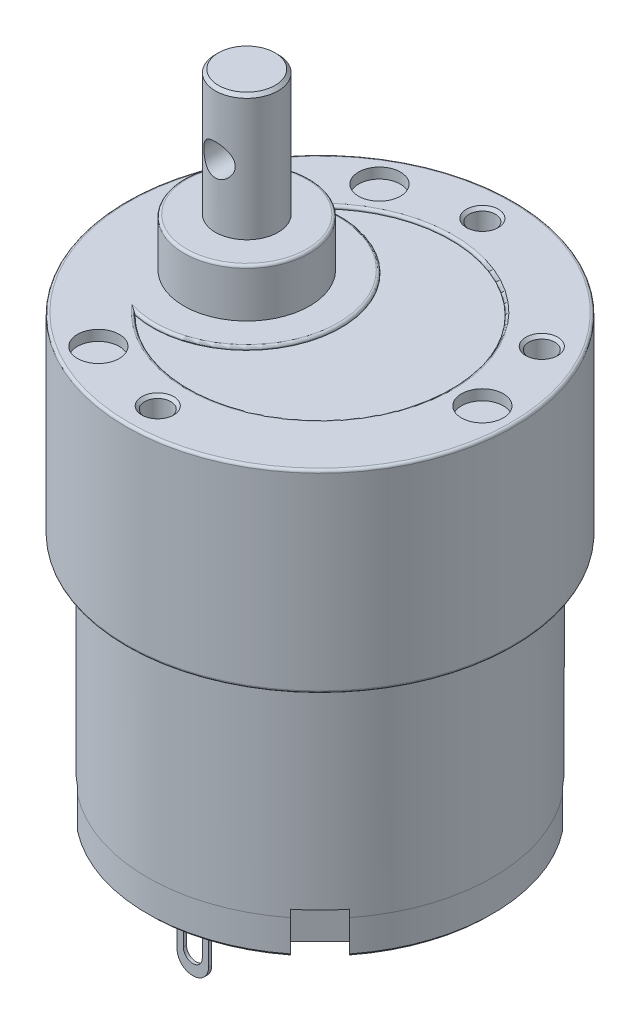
ISO-10303-21;
HEADER;
FILE_DESCRIPTION(('STEP AP214'),'2;1');
FILE_NAME('part.step','',(''),(''),'','','');
FILE_SCHEMA(('AUTOMOTIVE_DESIGN { 1 0 10303 214 1 1 1 1 }'));
ENDSEC;
DATA;
#1=APPLICATION_CONTEXT('core data for automotive mechanical design processes');
#2=APPLICATION_PROTOCOL_DEFINITION('international standard','automotive_design',2000,#1);
#3=PRODUCT_CONTEXT('',#1,'mechanical');
#4=PRODUCT('Part','Part','',(#3));
#5=PRODUCT_RELATED_PRODUCT_CATEGORY('part','',(#4));
#6=PRODUCT_DEFINITION_FORMATION('','',#4);
#7=PRODUCT_DEFINITION_CONTEXT('part definition',#1,'design');
#8=PRODUCT_DEFINITION('design','',#6,#7);
#9=PRODUCT_DEFINITION_SHAPE('','',#8);
#10=(LENGTH_UNIT() NAMED_UNIT(*) SI_UNIT(.MILLI.,.METRE.));
#11=(NAMED_UNIT(*) PLANE_ANGLE_UNIT() SI_UNIT($,.RADIAN.));
#12=(NAMED_UNIT(*) SI_UNIT($,.STERADIAN.) SOLID_ANGLE_UNIT());
#13=UNCERTAINTY_MEASURE_WITH_UNIT(LENGTH_MEASURE(1.E-05),#10,'distance_accuracy_value','');
#14=(GEOMETRIC_REPRESENTATION_CONTEXT(3) GLOBAL_UNCERTAINTY_ASSIGNED_CONTEXT((#13)) GLOBAL_UNIT_ASSIGNED_CONTEXT((#10,
#11,#12)) REPRESENTATION_CONTEXT('',''));
#15=CARTESIAN_POINT('',(0.,0.,0.));
#16=DIRECTION('',(0.,0.,1.));
#17=DIRECTION('',(1.,0.,0.));
#18=AXIS2_PLACEMENT_3D('',#15,#16,#17);
#19=CARTESIAN_POINT('',(0.,-41.8,0.));
#20=DIRECTION('',(0.,1.,0.));
#21=DIRECTION('',(0.,0.,1.));
#22=AXIS2_PLACEMENT_3D('',#19,#20,#21);
#23=CYLINDRICAL_SURFACE('',#22,16.5);
#24=CARTESIAN_POINT('',(0.,-41.5,0.));
#25=DIRECTION('',(0.,-1.,0.));
#26=DIRECTION('',(0.,0.,-1.));
#27=AXIS2_PLACEMENT_3D('',#24,#25,#26);
#28=CIRCLE('',#27,16.5);
#29=CARTESIAN_POINT('',(-10.1670212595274,-41.5,12.9954483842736));
#30=VERTEX_POINT('',#29);
#31=CARTESIAN_POINT('',(10.1670212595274,-41.5,12.9954483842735));
#32=VERTEX_POINT('',#31);
#33=EDGE_CURVE('E720',#30,#32,#28,.F.);
#34=ORIENTED_EDGE('',*,*,#33,.T.);
#35=DIRECTION('',(0.,1.,0.));
#36=VECTOR('',#35,1.);
#37=CARTESIAN_POINT('',(10.1670212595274,-41.8,12.9954483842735));
#38=LINE('',#37,#36);
#39=CARTESIAN_POINT('',(10.1670212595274,-38.5,12.9954483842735));
#40=VERTEX_POINT('',#39);
#41=EDGE_CURVE('E413',#32,#40,#38,.T.);
#42=ORIENTED_EDGE('',*,*,#41,.T.);
#43=CARTESIAN_POINT('',(0.,-38.5,0.));
#44=DIRECTION('',(0.,-1.,0.));
#45=DIRECTION('',(0.,0.,-1.));
#46=AXIS2_PLACEMENT_3D('',#43,#44,#45);
#47=CIRCLE('',#46,16.5);
#48=CARTESIAN_POINT('',(-10.1670212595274,-38.5,12.9954483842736));
#49=VERTEX_POINT('',#48);
#50=EDGE_CURVE('E805',#40,#49,#47,.T.);
#51=ORIENTED_EDGE('',*,*,#50,.T.);
#52=DIRECTION('',(0.,1.,0.));
#53=VECTOR('',#52,1.);
#54=CARTESIAN_POINT('',(-10.1670212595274,-41.8,12.9954483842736));
#55=LINE('',#54,#53);
#56=EDGE_CURVE('E337',#49,#30,#55,.F.);
#57=ORIENTED_EDGE('',*,*,#56,.T.);
#58=EDGE_LOOP('',(#34,#42,#51,#57));
#59=FACE_BOUND('',#58,.T.);
#60=ADVANCED_FACE('F51',(#59),#23,.T.);
#61=CARTESIAN_POINT('',(12.9954483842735,-38.5,-10.1670212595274));
#62=VERTEX_POINT('',#61);
#63=CARTESIAN_POINT('',(12.9954483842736,-38.5,10.1670212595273));
#64=VERTEX_POINT('',#63);
#65=EDGE_CURVE('E527',#62,#64,#47,.T.);
#66=ORIENTED_EDGE('',*,*,#65,.T.);
#67=DIRECTION('',(0.,1.,0.));
#68=VECTOR('',#67,1.);
#69=CARTESIAN_POINT('',(12.9954483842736,-41.8,10.1670212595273));
#70=LINE('',#69,#68);
#71=CARTESIAN_POINT('',(12.9954483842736,-41.5,10.1670212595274));
#72=VERTEX_POINT('',#71);
#73=EDGE_CURVE('E407',#64,#72,#70,.F.);
#74=ORIENTED_EDGE('',*,*,#73,.T.);
#75=CARTESIAN_POINT('',(12.9954483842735,-41.5,-10.1670212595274));
#76=VERTEX_POINT('',#75);
#77=EDGE_CURVE('E584',#72,#76,#28,.F.);
#78=ORIENTED_EDGE('',*,*,#77,.T.);
#79=DIRECTION('',(0.,1.,0.));
#80=VECTOR('',#79,1.);
#81=CARTESIAN_POINT('',(12.9954483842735,-41.8,-10.1670212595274));
#82=LINE('',#81,#80);
#83=EDGE_CURVE('E401',#76,#62,#82,.T.);
#84=ORIENTED_EDGE('',*,*,#83,.T.);
#85=EDGE_LOOP('',(#66,#74,#78,#84));
#86=FACE_BOUND('',#85,.T.);
#87=ADVANCED_FACE('F712',(#86),#23,.T.);
#88=CARTESIAN_POINT('',(-10.1670212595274,-38.5,-12.9954483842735));
#89=VERTEX_POINT('',#88);
#90=CARTESIAN_POINT('',(10.1670212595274,-38.5,-12.9954483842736));
#91=VERTEX_POINT('',#90);
#92=EDGE_CURVE('E523',#89,#91,#47,.T.);
#93=ORIENTED_EDGE('',*,*,#92,.T.);
#94=DIRECTION('',(0.,1.,0.));
#95=VECTOR('',#94,1.);
#96=CARTESIAN_POINT('',(10.1670212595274,-41.8,-12.9954483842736));
#97=LINE('',#96,#95);
#98=CARTESIAN_POINT('',(10.1670212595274,-41.5,-12.9954483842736));
#99=VERTEX_POINT('',#98);
#100=EDGE_CURVE('E395',#91,#99,#97,.F.);
#101=ORIENTED_EDGE('',*,*,#100,.T.);
#102=CARTESIAN_POINT('',(-10.1670212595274,-41.5,-12.9954483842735));
#103=VERTEX_POINT('',#102);
#104=EDGE_CURVE('E581',#99,#103,#28,.F.);
#105=ORIENTED_EDGE('',*,*,#104,.T.);
#106=DIRECTION('',(0.,1.,0.));
#107=VECTOR('',#106,1.);
#108=CARTESIAN_POINT('',(-10.1670212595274,-41.8,-12.9954483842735));
#109=LINE('',#108,#107);
#110=EDGE_CURVE('E389',#103,#89,#109,.T.);
#111=ORIENTED_EDGE('',*,*,#110,.T.);
#112=EDGE_LOOP('',(#93,#101,#105,#111));
#113=FACE_BOUND('',#112,.T.);
#114=ADVANCED_FACE('F692',(#113),#23,.T.);
#115=CARTESIAN_POINT('',(0.,-41.8,0.));
#116=DIRECTION('',(0.,1.,0.));
#117=DIRECTION('',(0.,0.,1.));
#118=AXIS2_PLACEMENT_3D('',#115,#116,#117);
#119=CONICAL_SURFACE('',#118,16.2,0.785398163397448);
#120=CARTESIAN_POINT('',(10.1671637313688,-41.4998,12.995590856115));
#121=CARTESIAN_POINT('',(10.1314958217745,-41.5498701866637,12.9599229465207));
#122=CARTESIAN_POINT('',(10.0958266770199,-41.5999386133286,12.9242538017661));
#123=CARTESIAN_POINT('',(10.0244859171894,-41.700071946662,12.8529130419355));
#124=CARTESIAN_POINT('',(9.98881430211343,-41.7501368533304,12.8172414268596));
#125=CARTESIAN_POINT('',(9.95314145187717,-41.8002,12.7815685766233));
#126=B_SPLINE_CURVE_WITH_KNOTS('',3,(#120,#121,#122,#123,#124,#125),.UNSPECIFIED.,.F.,.F.,(4,2,
4),(0.,0.21322009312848,0.426440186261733),.UNSPECIFIED.);
#127=CARTESIAN_POINT('',(9.95328396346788,-41.8,12.781711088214));
#128=VERTEX_POINT('',#127);
#129=EDGE_CURVE('E325',#32,#128,#126,.T.);
#130=ORIENTED_EDGE('',*,*,#129,.F.);
#131=ORIENTED_EDGE('',*,*,#33,.F.);
#132=CARTESIAN_POINT('',(-9.95314145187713,-41.8002,12.7815685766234));
#133=CARTESIAN_POINT('',(-9.98881430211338,-41.7501368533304,12.8172414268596));
#134=CARTESIAN_POINT('',(-10.0244859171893,-41.700071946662,12.8529130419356));
#135=CARTESIAN_POINT('',(-10.0958266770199,-41.5999386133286,12.9242538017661));
#136=CARTESIAN_POINT('',(-10.1314958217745,-41.5498701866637,12.9599229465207));
#137=CARTESIAN_POINT('',(-10.1671637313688,-41.4998,12.995590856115));
#138=B_SPLINE_CURVE_WITH_KNOTS('',3,(#132,#133,#134,#135,#136,#137),.UNSPECIFIED.,.F.,.F.,(4,2,
4),(0.,0.213220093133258,0.426440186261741),.UNSPECIFIED.);
#139=CARTESIAN_POINT('',(-9.95328396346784,-41.8,12.7817110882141));
#140=VERTEX_POINT('',#139);
#141=EDGE_CURVE('E586',#140,#30,#138,.T.);
#142=ORIENTED_EDGE('',*,*,#141,.F.);
#143=CARTESIAN_POINT('',(0.,-41.8,0.));
#144=DIRECTION('',(0.,-1.,0.));
#145=DIRECTION('',(0.,0.,-1.));
#146=AXIS2_PLACEMENT_3D('',#143,#144,#145);
#147=CIRCLE('',#146,16.2);
#148=EDGE_CURVE('E800',#128,#140,#147,.T.);
#149=ORIENTED_EDGE('',*,*,#148,.F.);
#150=EDGE_LOOP('',(#130,#131,#142,#149));
#151=FACE_BOUND('',#150,.T.);
#152=ADVANCED_FACE('F832',(#151),#119,.T.);
#153=CARTESIAN_POINT('',(12.7815685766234,-41.8002,9.95314145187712));
#154=CARTESIAN_POINT('',(12.8172414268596,-41.7501368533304,9.98881430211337));
#155=CARTESIAN_POINT('',(12.8529130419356,-41.700071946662,10.0244859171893));
#156=CARTESIAN_POINT('',(12.9242538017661,-41.5999386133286,10.0958266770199));
#157=CARTESIAN_POINT('',(12.9599229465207,-41.5498701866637,10.1314958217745));
#158=CARTESIAN_POINT('',(12.995590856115,-41.4998,10.1671637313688));
#159=B_SPLINE_CURVE_WITH_KNOTS('',3,(#153,#154,#155,#156,#157,#158),.UNSPECIFIED.,.F.,.F.,(4,2,
4),(0.,0.213220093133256,0.426440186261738),.UNSPECIFIED.);
#160=CARTESIAN_POINT('',(12.7817110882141,-41.8,9.95328396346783));
#161=VERTEX_POINT('',#160);
#162=EDGE_CURVE('E734',#161,#72,#159,.T.);
#163=ORIENTED_EDGE('',*,*,#162,.F.);
#164=CARTESIAN_POINT('',(12.781711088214,-41.8,-9.95328396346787));
#165=VERTEX_POINT('',#164);
#166=EDGE_CURVE('E580',#165,#161,#147,.T.);
#167=ORIENTED_EDGE('',*,*,#166,.F.);
#168=CARTESIAN_POINT('',(12.995590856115,-41.4998,-10.1671637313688));
#169=CARTESIAN_POINT('',(12.9599229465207,-41.5498701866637,-10.1314958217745));
#170=CARTESIAN_POINT('',(12.9242538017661,-41.5999386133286,-10.0958266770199));
#171=CARTESIAN_POINT('',(12.8529130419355,-41.700071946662,-10.0244859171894));
#172=CARTESIAN_POINT('',(12.8172414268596,-41.7501368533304,-9.98881430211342));
#173=CARTESIAN_POINT('',(12.7815685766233,-41.8002,-9.95314145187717));
#174=B_SPLINE_CURVE_WITH_KNOTS('',3,(#168,#169,#170,#171,#172,#173),.UNSPECIFIED.,.F.,.F.,(4,2,
4),(0.,0.21322009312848,0.426440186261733),.UNSPECIFIED.);
#175=EDGE_CURVE('E735',#76,#165,#174,.T.);
#176=ORIENTED_EDGE('',*,*,#175,.F.);
#177=ORIENTED_EDGE('',*,*,#77,.F.);
#178=EDGE_LOOP('',(#163,#167,#176,#177));
#179=FACE_BOUND('',#178,.T.);
#180=ADVANCED_FACE('F732',(#179),#119,.T.);
#181=CARTESIAN_POINT('',(9.95314145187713,-41.8002,-12.7815685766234));
#182=CARTESIAN_POINT('',(9.98881430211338,-41.7501368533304,-12.8172414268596));
#183=CARTESIAN_POINT('',(10.0244859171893,-41.700071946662,-12.8529130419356));
#184=CARTESIAN_POINT('',(10.0958266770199,-41.5999386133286,-12.9242538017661));
#185=CARTESIAN_POINT('',(10.1314958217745,-41.5498701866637,-12.9599229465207));
#186=CARTESIAN_POINT('',(10.1671637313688,-41.4998,-12.995590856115));
#187=B_SPLINE_CURVE_WITH_KNOTS('',3,(#181,#182,#183,#184,#185,#186),.UNSPECIFIED.,.F.,.F.,(4,2,
4),(0.,0.213220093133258,0.426440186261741),.UNSPECIFIED.);
#188=CARTESIAN_POINT('',(9.95328396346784,-41.8,-12.7817110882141));
#189=VERTEX_POINT('',#188);
#190=EDGE_CURVE('E738',#189,#99,#187,.T.);
#191=ORIENTED_EDGE('',*,*,#190,.F.);
#192=CARTESIAN_POINT('',(-9.95328396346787,-41.8,-12.781711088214));
#193=VERTEX_POINT('',#192);
#194=EDGE_CURVE('E576',#193,#189,#147,.T.);
#195=ORIENTED_EDGE('',*,*,#194,.F.);
#196=CARTESIAN_POINT('',(-10.1671637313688,-41.4998,-12.995590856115));
#197=CARTESIAN_POINT('',(-10.1314958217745,-41.5498701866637,-12.9599229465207));
#198=CARTESIAN_POINT('',(-10.0958266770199,-41.5999386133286,-12.9242538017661));
#199=CARTESIAN_POINT('',(-10.0244859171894,-41.700071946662,-12.8529130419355));
#200=CARTESIAN_POINT('',(-9.98881430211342,-41.7501368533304,-12.8172414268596));
#201=CARTESIAN_POINT('',(-9.95314145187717,-41.8002,-12.7815685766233));
#202=B_SPLINE_CURVE_WITH_KNOTS('',3,(#196,#197,#198,#199,#200,#201),.UNSPECIFIED.,.F.,.F.,(4,2,
4),(0.,0.21322009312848,0.426440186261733),.UNSPECIFIED.);
#203=EDGE_CURVE('E741',#103,#193,#202,.T.);
#204=ORIENTED_EDGE('',*,*,#203,.F.);
#205=ORIENTED_EDGE('',*,*,#104,.F.);
#206=EDGE_LOOP('',(#191,#195,#204,#205));
#207=FACE_BOUND('',#206,.T.);
#208=ADVANCED_FACE('F685',(#207),#119,.T.);
#209=CARTESIAN_POINT('',(0.,-41.8,0.));
#210=DIRECTION('',(0.,-1.,0.));
#211=DIRECTION('',(0.,0.,-1.));
#212=AXIS2_PLACEMENT_3D('',#209,#210,#211);
#213=PLANE('',#212);
#214=DIRECTION('',(-0.707106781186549,0.,-0.707106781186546));
#215=VECTOR('',#214,1.);
#216=CARTESIAN_POINT('',(11.6672618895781,-41.8,14.4956890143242));
#217=LINE('',#216,#215);
#218=CARTESIAN_POINT('',(8.83883476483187,-41.8,11.667261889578));
#219=VERTEX_POINT('',#218);
#220=EDGE_CURVE('E322',#128,#219,#217,.T.);
#221=ORIENTED_EDGE('',*,*,#220,.F.);
#222=ORIENTED_EDGE('',*,*,#148,.T.);
#223=DIRECTION('',(-0.707106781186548,0.,0.707106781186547));
#224=VECTOR('',#223,1.);
#225=CARTESIAN_POINT('',(-8.83883476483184,-41.8,11.6672618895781));
#226=LINE('',#225,#224);
#227=CARTESIAN_POINT('',(-8.83883476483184,-41.8,11.6672618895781));
#228=VERTEX_POINT('',#227);
#229=EDGE_CURVE('E75',#228,#140,#226,.T.);
#230=ORIENTED_EDGE('',*,*,#229,.F.);
#231=DIRECTION('',(0.707106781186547,0.,0.707106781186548));
#232=VECTOR('',#231,1.);
#233=CARTESIAN_POINT('',(-11.667261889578,-41.8,8.83883476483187));
#234=LINE('',#233,#232);
#235=CARTESIAN_POINT('',(-11.667261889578,-41.8,8.83883476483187));
#236=VERTEX_POINT('',#235);
#237=EDGE_CURVE('E362',#236,#228,#234,.T.);
#238=ORIENTED_EDGE('',*,*,#237,.F.);
#239=DIRECTION('',(0.707106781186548,0.,-0.707106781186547));
#240=VECTOR('',#239,1.);
#241=CARTESIAN_POINT('',(-14.4956890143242,-41.8,11.6672618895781));
#242=LINE('',#241,#240);
#243=CARTESIAN_POINT('',(-12.781711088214,-41.8,9.95328396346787));
#244=VERTEX_POINT('',#243);
#245=EDGE_CURVE('E366',#244,#236,#242,.T.);
#246=ORIENTED_EDGE('',*,*,#245,.F.);
#247=CARTESIAN_POINT('',(-12.7817110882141,-41.8,-9.95328396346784));
#248=VERTEX_POINT('',#247);
#249=EDGE_CURVE('E579',#244,#248,#147,.T.);
#250=ORIENTED_EDGE('',*,*,#249,.T.);
#251=DIRECTION('',(-0.707106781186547,0.,-0.707106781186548));
#252=VECTOR('',#251,1.);
#253=CARTESIAN_POINT('',(-11.6672618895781,-41.8,-8.83883476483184));
#254=LINE('',#253,#252);
#255=CARTESIAN_POINT('',(-11.6672618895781,-41.8,-8.83883476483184));
#256=VERTEX_POINT('',#255);
#257=EDGE_CURVE('E67',#256,#248,#254,.T.);
#258=ORIENTED_EDGE('',*,*,#257,.F.);
#259=DIRECTION('',(-0.707106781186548,0.,0.707106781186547));
#260=VECTOR('',#259,1.);
#261=CARTESIAN_POINT('',(-8.83883476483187,-41.8,-11.667261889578));
#262=LINE('',#261,#260);
#263=CARTESIAN_POINT('',(-8.83883476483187,-41.8,-11.667261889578));
#264=VERTEX_POINT('',#263);
#265=EDGE_CURVE('E351',#264,#256,#262,.T.);
#266=ORIENTED_EDGE('',*,*,#265,.F.);
#267=DIRECTION('',(0.707106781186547,0.,0.707106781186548));
#268=VECTOR('',#267,1.);
#269=CARTESIAN_POINT('',(-11.6672618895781,-41.8,-14.4956890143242));
#270=LINE('',#269,#268);
#271=EDGE_CURVE('E356',#193,#264,#270,.T.);
#272=ORIENTED_EDGE('',*,*,#271,.F.);
#273=ORIENTED_EDGE('',*,*,#194,.T.);
#274=DIRECTION('',(0.707106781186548,0.,-0.707106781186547));
#275=VECTOR('',#274,1.);
#276=CARTESIAN_POINT('',(8.83883476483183,-41.8,-11.6672618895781));
#277=LINE('',#276,#275);
#278=CARTESIAN_POINT('',(8.83883476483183,-41.8,-11.6672618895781));
#279=VERTEX_POINT('',#278);
#280=EDGE_CURVE('E342',#279,#189,#277,.T.);
#281=ORIENTED_EDGE('',*,*,#280,.F.);
#282=DIRECTION('',(-0.707106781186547,0.,-0.707106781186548));
#283=VECTOR('',#282,1.);
#284=CARTESIAN_POINT('',(11.667261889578,-41.8,-8.83883476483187));
#285=LINE('',#284,#283);
#286=CARTESIAN_POINT('',(11.667261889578,-41.8,-8.83883476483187));
#287=VERTEX_POINT('',#286);
#288=EDGE_CURVE('E339',#287,#279,#285,.T.);
#289=ORIENTED_EDGE('',*,*,#288,.F.);
#290=DIRECTION('',(-0.707106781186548,0.,0.707106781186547));
#291=VECTOR('',#290,1.);
#292=CARTESIAN_POINT('',(14.4956890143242,-41.8,-11.6672618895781));
#293=LINE('',#292,#291);
#294=EDGE_CURVE('E345',#165,#287,#293,.T.);
#295=ORIENTED_EDGE('',*,*,#294,.F.);
#296=ORIENTED_EDGE('',*,*,#166,.T.);
#297=DIRECTION('',(0.707106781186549,0.,0.707106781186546));
#298=VECTOR('',#297,1.);
#299=CARTESIAN_POINT('',(11.6672618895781,-41.8,8.83883476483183));
#300=LINE('',#299,#298);
#301=CARTESIAN_POINT('',(11.6672618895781,-41.8,8.83883476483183));
#302=VERTEX_POINT('',#301);
#303=EDGE_CURVE('E319',#302,#161,#300,.T.);
#304=ORIENTED_EDGE('',*,*,#303,.F.);
#305=DIRECTION('',(0.707106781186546,0.,-0.707106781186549));
#306=VECTOR('',#305,1.);
#307=CARTESIAN_POINT('',(8.83883476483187,-41.8,11.667261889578));
#308=LINE('',#307,#306);
#309=EDGE_CURVE('E314',#219,#302,#308,.T.);
#310=ORIENTED_EDGE('',*,*,#309,.F.);
#311=EDGE_LOOP('',(#221,#222,#230,#238,#246,#250,#258,#266,#272,#273,#281,#289,#295,#296,#304,#310));
#312=FACE_BOUND('',#311,.T.);
#313=CARTESIAN_POINT('',(0.,-41.8,0.));
#314=DIRECTION('',(0.,-1.,0.));
#315=DIRECTION('',(0.,0.,-1.));
#316=AXIS2_PLACEMENT_3D('',#313,#314,#315);
#317=CIRCLE('',#316,3.5);
#318=CARTESIAN_POINT('',(0.,-41.8,-3.5));
#319=VERTEX_POINT('',#318);
#320=EDGE_CURVE('E418',#319,#319,#317,.T.);
#321=ORIENTED_EDGE('',*,*,#320,.F.);
#322=EDGE_LOOP('',(#321));
#323=FACE_BOUND('',#322,.T.);
#324=DIRECTION('',(-1.,0.,0.));
#325=VECTOR('',#324,1.);
#326=CARTESIAN_POINT('',(-1.50000000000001,-41.8,12.15));
#327=LINE('',#326,#325);
#328=CARTESIAN_POINT('',(1.49999999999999,-41.8,12.15));
#329=VERTEX_POINT('',#328);
#330=CARTESIAN_POINT('',(-1.50000000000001,-41.8,12.15));
#331=VERTEX_POINT('',#330);
#332=EDGE_CURVE('E508',#329,#331,#327,.T.);
#333=ORIENTED_EDGE('',*,*,#332,.F.);
#334=DIRECTION('',(0.,0.,1.));
#335=VECTOR('',#334,1.);
#336=CARTESIAN_POINT('',(1.49999999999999,-41.8,12.15));
#337=LINE('',#336,#335);
#338=CARTESIAN_POINT('',(1.49999999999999,-41.8,11.85));
#339=VERTEX_POINT('',#338);
#340=EDGE_CURVE('E497',#339,#329,#337,.T.);
#341=ORIENTED_EDGE('',*,*,#340,.F.);
#342=DIRECTION('',(1.,0.,0.));
#343=VECTOR('',#342,1.);
#344=CARTESIAN_POINT('',(-1.50000000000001,-41.8,11.85));
#345=LINE('',#344,#343);
#346=CARTESIAN_POINT('',(-1.50000000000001,-41.8,11.85));
#347=VERTEX_POINT('',#346);
#348=EDGE_CURVE('E502',#347,#339,#345,.T.);
#349=ORIENTED_EDGE('',*,*,#348,.F.);
#350=DIRECTION('',(0.,0.,-1.));
#351=VECTOR('',#350,1.);
#352=CARTESIAN_POINT('',(-1.50000000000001,-41.8,12.15));
#353=LINE('',#352,#351);
#354=EDGE_CURVE('E511',#331,#347,#353,.T.);
#355=ORIENTED_EDGE('',*,*,#354,.F.);
#356=EDGE_LOOP('',(#333,#341,#349,#355));
#357=FACE_BOUND('',#356,.T.);
#358=DIRECTION('',(1.,0.,0.));
#359=VECTOR('',#358,1.);
#360=CARTESIAN_POINT('',(-1.50000000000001,-41.8,-12.15));
#361=LINE('',#360,#359);
#362=CARTESIAN_POINT('',(-1.50000000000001,-41.8,-12.15));
#363=VERTEX_POINT('',#362);
#364=CARTESIAN_POINT('',(1.49999999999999,-41.8,-12.15));
#365=VERTEX_POINT('',#364);
#366=EDGE_CURVE('E482',#363,#365,#361,.T.);
#367=ORIENTED_EDGE('',*,*,#366,.F.);
#368=DIRECTION('',(0.,0.,-1.));
#369=VECTOR('',#368,1.);
#370=CARTESIAN_POINT('',(-1.50000000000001,-41.8,-12.15));
#371=LINE('',#370,#369);
#372=CARTESIAN_POINT('',(-1.50000000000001,-41.8,-11.85));
#373=VERTEX_POINT('',#372);
#374=EDGE_CURVE('E471',#373,#363,#371,.T.);
#375=ORIENTED_EDGE('',*,*,#374,.F.);
#376=DIRECTION('',(-1.,0.,0.));
#377=VECTOR('',#376,1.);
#378=CARTESIAN_POINT('',(-1.50000000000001,-41.8,-11.85));
#379=LINE('',#378,#377);
#380=CARTESIAN_POINT('',(1.49999999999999,-41.8,-11.85));
#381=VERTEX_POINT('',#380);
#382=EDGE_CURVE('E476',#381,#373,#379,.T.);
#383=ORIENTED_EDGE('',*,*,#382,.F.);
#384=DIRECTION('',(0.,0.,1.));
#385=VECTOR('',#384,1.);
#386=CARTESIAN_POINT('',(1.49999999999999,-41.8,-12.15));
#387=LINE('',#386,#385);
#388=EDGE_CURVE('E485',#365,#381,#387,.T.);
#389=ORIENTED_EDGE('',*,*,#388,.F.);
#390=EDGE_LOOP('',(#367,#375,#383,#389));
#391=FACE_BOUND('',#390,.T.);
#392=ADVANCED_FACE('F331',(#312,#323,#357,#391),#213,.T.);
#393=CARTESIAN_POINT('',(-12.9954483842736,-38.5,10.1670212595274));
#394=VERTEX_POINT('',#393);
#395=CARTESIAN_POINT('',(-12.9954483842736,-38.5,-10.1670212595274));
#396=VERTEX_POINT('',#395);
#397=EDGE_CURVE('E526',#394,#396,#47,.T.);
#398=ORIENTED_EDGE('',*,*,#397,.T.);
#399=DIRECTION('',(0.,1.,0.));
#400=VECTOR('',#399,1.);
#401=CARTESIAN_POINT('',(-12.9954483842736,-41.8,-10.1670212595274));
#402=LINE('',#401,#400);
#403=CARTESIAN_POINT('',(-12.9954483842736,-41.5,-10.1670212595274));
#404=VERTEX_POINT('',#403);
#405=EDGE_CURVE('E383',#396,#404,#402,.F.);
#406=ORIENTED_EDGE('',*,*,#405,.T.);
#407=CARTESIAN_POINT('',(-12.9954483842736,-41.5,10.1670212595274));
#408=VERTEX_POINT('',#407);
#409=EDGE_CURVE('E585',#404,#408,#28,.F.);
#410=ORIENTED_EDGE('',*,*,#409,.T.);
#411=DIRECTION('',(0.,1.,0.));
#412=VECTOR('',#411,1.);
#413=CARTESIAN_POINT('',(-12.9954483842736,-41.8,10.1670212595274));
#414=LINE('',#413,#412);
#415=EDGE_CURVE('E377',#408,#394,#414,.T.);
#416=ORIENTED_EDGE('',*,*,#415,.T.);
#417=EDGE_LOOP('',(#398,#406,#410,#416));
#418=FACE_BOUND('',#417,.T.);
#419=ADVANCED_FACE('F684',(#418),#23,.T.);
#420=CARTESIAN_POINT('',(0.,-38.5,0.));
#421=DIRECTION('',(0.,-1.,0.));
#422=DIRECTION('',(0.,0.,-1.));
#423=AXIS2_PLACEMENT_3D('',#420,#421,#422);
#424=PLANE('',#423);
#425=ORIENTED_EDGE('',*,*,#50,.F.);
#426=DIRECTION('',(-0.707106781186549,0.,-0.707106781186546));
#427=VECTOR('',#426,1.);
#428=CARTESIAN_POINT('',(-1.41421356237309,-38.5,1.41421356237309));
#429=LINE('',#428,#427);
#430=CARTESIAN_POINT('',(8.83883476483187,-38.5,11.667261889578));
#431=VERTEX_POINT('',#430);
#432=EDGE_CURVE('E416',#40,#431,#429,.T.);
#433=ORIENTED_EDGE('',*,*,#432,.T.);
#434=DIRECTION('',(0.707106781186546,0.,-0.707106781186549));
#435=VECTOR('',#434,1.);
#436=CARTESIAN_POINT('',(10.253048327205,-38.5,10.2530483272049));
#437=LINE('',#436,#435);
#438=CARTESIAN_POINT('',(11.6672618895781,-38.5,8.83883476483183));
#439=VERTEX_POINT('',#438);
#440=EDGE_CURVE('E12',#431,#439,#437,.T.);
#441=ORIENTED_EDGE('',*,*,#440,.T.);
#442=DIRECTION('',(0.707106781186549,0.,0.707106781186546));
#443=VECTOR('',#442,1.);
#444=CARTESIAN_POINT('',(1.41421356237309,-38.5,-1.41421356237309));
#445=LINE('',#444,#443);
#446=EDGE_CURVE('E410',#439,#64,#445,.T.);
#447=ORIENTED_EDGE('',*,*,#446,.T.);
#448=ORIENTED_EDGE('',*,*,#65,.F.);
#449=DIRECTION('',(-0.707106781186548,0.,0.707106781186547));
#450=VECTOR('',#449,1.);
#451=CARTESIAN_POINT('',(1.41421356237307,-38.5,1.41421356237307));
#452=LINE('',#451,#450);
#453=CARTESIAN_POINT('',(11.667261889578,-38.5,-8.83883476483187));
#454=VERTEX_POINT('',#453);
#455=EDGE_CURVE('E404',#62,#454,#452,.T.);
#456=ORIENTED_EDGE('',*,*,#455,.T.);
#457=DIRECTION('',(-0.707106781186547,0.,-0.707106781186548));
#458=VECTOR('',#457,1.);
#459=CARTESIAN_POINT('',(10.253048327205,-38.5,-10.2530483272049));
#460=LINE('',#459,#458);
#461=CARTESIAN_POINT('',(8.83883476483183,-38.5,-11.6672618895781));
#462=VERTEX_POINT('',#461);
#463=EDGE_CURVE('E60',#454,#462,#460,.T.);
#464=ORIENTED_EDGE('',*,*,#463,.T.);
#465=DIRECTION('',(0.707106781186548,0.,-0.707106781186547));
#466=VECTOR('',#465,1.);
#467=CARTESIAN_POINT('',(-1.41421356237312,-38.5,-1.41421356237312));
#468=LINE('',#467,#466);
#469=EDGE_CURVE('E398',#462,#91,#468,.T.);
#470=ORIENTED_EDGE('',*,*,#469,.T.);
#471=ORIENTED_EDGE('',*,*,#92,.F.);
#472=DIRECTION('',(0.707106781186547,0.,0.707106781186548));
#473=VECTOR('',#472,1.);
#474=CARTESIAN_POINT('',(1.41421356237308,-38.5,-1.41421356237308));
#475=LINE('',#474,#473);
#476=CARTESIAN_POINT('',(-8.83883476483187,-38.5,-11.667261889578));
#477=VERTEX_POINT('',#476);
#478=EDGE_CURVE('E392',#89,#477,#475,.T.);
#479=ORIENTED_EDGE('',*,*,#478,.T.);
#480=DIRECTION('',(-0.707106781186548,0.,0.707106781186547));
#481=VECTOR('',#480,1.);
#482=CARTESIAN_POINT('',(-10.2530483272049,-38.5,-10.253048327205));
#483=LINE('',#482,#481);
#484=CARTESIAN_POINT('',(-11.6672618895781,-38.5,-8.83883476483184));
#485=VERTEX_POINT('',#484);
#486=EDGE_CURVE('E810',#477,#485,#483,.T.);
#487=ORIENTED_EDGE('',*,*,#486,.T.);
#488=DIRECTION('',(-0.707106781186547,0.,-0.707106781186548));
#489=VECTOR('',#488,1.);
#490=CARTESIAN_POINT('',(-1.41421356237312,-38.5,1.41421356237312));
#491=LINE('',#490,#489);
#492=EDGE_CURVE('E386',#485,#396,#491,.T.);
#493=ORIENTED_EDGE('',*,*,#492,.T.);
#494=ORIENTED_EDGE('',*,*,#397,.F.);
#495=DIRECTION('',(0.707106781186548,0.,-0.707106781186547));
#496=VECTOR('',#495,1.);
#497=CARTESIAN_POINT('',(-1.41421356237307,-38.5,-1.41421356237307));
#498=LINE('',#497,#496);
#499=CARTESIAN_POINT('',(-11.667261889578,-38.5,8.83883476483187));
#500=VERTEX_POINT('',#499);
#501=EDGE_CURVE('E380',#394,#500,#498,.T.);
#502=ORIENTED_EDGE('',*,*,#501,.T.);
#503=DIRECTION('',(0.707106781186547,0.,0.707106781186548));
#504=VECTOR('',#503,1.);
#505=CARTESIAN_POINT('',(-10.253048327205,-38.5,10.2530483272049));
#506=LINE('',#505,#504);
#507=CARTESIAN_POINT('',(-8.83883476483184,-38.5,11.6672618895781));
#508=VERTEX_POINT('',#507);
#509=EDGE_CURVE('E824',#500,#508,#506,.T.);
#510=ORIENTED_EDGE('',*,*,#509,.T.);
#511=DIRECTION('',(-0.707106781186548,0.,0.707106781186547));
#512=VECTOR('',#511,1.);
#513=CARTESIAN_POINT('',(1.41421356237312,-38.5,1.41421356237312));
#514=LINE('',#513,#512);
#515=EDGE_CURVE('E374',#508,#49,#514,.T.);
#516=ORIENTED_EDGE('',*,*,#515,.T.);
#517=EDGE_LOOP('',(#425,#433,#441,#447,#448,#456,#464,#470,#471,#479,#487,#493,#494,#502,#510,#516));
#518=FACE_BOUND('',#517,.T.);
#519=ADVANCED_FACE('F680',(#518),#424,.F.);
#520=CARTESIAN_POINT('',(1.49999999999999,-48.8,12.15));
#521=DIRECTION('',(-1.,0.,0.));
#522=DIRECTION('',(0.,0.,1.));
#523=AXIS2_PLACEMENT_3D('',#520,#521,#522);
#524=PLANE('',#523);
#525=DIRECTION('',(0.,1.,0.));
#526=VECTOR('',#525,1.);
#527=CARTESIAN_POINT('',(1.49999999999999,-48.8,12.15));
#528=LINE('',#527,#526);
#529=CARTESIAN_POINT('',(1.49999999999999,-47.35,12.15));
#530=VERTEX_POINT('',#529);
#531=EDGE_CURVE('E521',#530,#329,#528,.T.);
#532=ORIENTED_EDGE('',*,*,#531,.F.);
#533=DIRECTION('',(0.,0.,1.));
#534=VECTOR('',#533,1.);
#535=CARTESIAN_POINT('',(1.49999999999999,-47.35,11.85));
#536=LINE('',#535,#534);
#537=CARTESIAN_POINT('',(1.49999999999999,-47.35,11.85));
#538=VERTEX_POINT('',#537);
#539=EDGE_CURVE('E562',#530,#538,#536,.F.);
#540=ORIENTED_EDGE('',*,*,#539,.T.);
#541=DIRECTION('',(0.,1.,0.));
#542=VECTOR('',#541,1.);
#543=CARTESIAN_POINT('',(1.49999999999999,-48.8,11.85));
#544=LINE('',#543,#542);
#545=EDGE_CURVE('E505',#538,#339,#544,.T.);
#546=ORIENTED_EDGE('',*,*,#545,.T.);
#547=ORIENTED_EDGE('',*,*,#340,.T.);
#548=EDGE_LOOP('',(#532,#540,#546,#547));
#549=FACE_BOUND('',#548,.T.);
#550=ADVANCED_FACE('F676',(#549),#524,.F.);
#551=CARTESIAN_POINT('',(-1.50000000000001,-48.8,12.15));
#552=DIRECTION('',(0.,0.,-1.));
#553=DIRECTION('',(-1.,0.,0.));
#554=AXIS2_PLACEMENT_3D('',#551,#552,#553);
#555=PLANE('',#554);
#556=DIRECTION('',(0.,1.,0.));
#557=VECTOR('',#556,1.);
#558=CARTESIAN_POINT('',(0.900000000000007,-46.9,12.15));
#559=LINE('',#558,#557);
#560=CARTESIAN_POINT('',(0.900000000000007,-46.9,12.15));
#561=VERTEX_POINT('',#560);
#562=CARTESIAN_POINT('',(0.900000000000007,-44.9,12.15));
#563=VERTEX_POINT('',#562);
#564=EDGE_CURVE('E435',#561,#563,#559,.T.);
#565=ORIENTED_EDGE('',*,*,#564,.F.);
#566=CARTESIAN_POINT('',(0.,-46.9,12.15));
#567=DIRECTION('',(0.,0.,1.));
#568=DIRECTION('',(1.,0.,0.));
#569=AXIS2_PLACEMENT_3D('',#566,#567,#568);
#570=CIRCLE('',#569,0.9);
#571=CARTESIAN_POINT('',(-0.899999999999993,-46.9,12.15));
#572=VERTEX_POINT('',#571);
#573=EDGE_CURVE('E422',#572,#561,#570,.T.);
#574=ORIENTED_EDGE('',*,*,#573,.F.);
#575=DIRECTION('',(0.,-1.,0.));
#576=VECTOR('',#575,1.);
#577=CARTESIAN_POINT('',(-0.899999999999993,-46.9,12.15));
#578=LINE('',#577,#576);
#579=CARTESIAN_POINT('',(-0.899999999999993,-44.9,12.15));
#580=VERTEX_POINT('',#579);
#581=EDGE_CURVE('E441',#580,#572,#578,.T.);
#582=ORIENTED_EDGE('',*,*,#581,.F.);
#583=CARTESIAN_POINT('',(0.,-44.9,12.15));
#584=DIRECTION('',(0.,0.,1.));
#585=DIRECTION('',(1.,0.,0.));
#586=AXIS2_PLACEMENT_3D('',#583,#584,#585);
#587=CIRCLE('',#586,0.9);
#588=EDGE_CURVE('E438',#563,#580,#587,.T.);
#589=ORIENTED_EDGE('',*,*,#588,.F.);
#590=EDGE_LOOP('',(#565,#574,#582,#589));
#591=FACE_BOUND('',#590,.T.);
#592=DIRECTION('',(0.,1.,0.));
#593=VECTOR('',#592,1.);
#594=CARTESIAN_POINT('',(-1.50000000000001,-48.8,12.15));
#595=LINE('',#594,#593);
#596=CARTESIAN_POINT('',(-1.50000000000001,-47.35,12.15));
#597=VERTEX_POINT('',#596);
#598=EDGE_CURVE('E519',#597,#331,#595,.T.);
#599=ORIENTED_EDGE('',*,*,#598,.F.);
#600=CARTESIAN_POINT('',(-0.0500000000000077,-47.35,12.15));
#601=DIRECTION('',(0.,0.,-1.));
#602=DIRECTION('',(-1.,0.,0.));
#603=AXIS2_PLACEMENT_3D('',#600,#601,#602);
#604=CIRCLE('',#603,1.45);
#605=CARTESIAN_POINT('',(-0.0500000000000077,-48.8,12.15));
#606=VERTEX_POINT('',#605);
#607=EDGE_CURVE('E560',#597,#606,#604,.F.);
#608=ORIENTED_EDGE('',*,*,#607,.T.);
#609=DIRECTION('',(-1.,0.,0.));
#610=VECTOR('',#609,1.);
#611=CARTESIAN_POINT('',(-1.50000000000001,-48.8,12.15));
#612=LINE('',#611,#610);
#613=CARTESIAN_POINT('',(0.0499999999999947,-48.8,12.15));
#614=VERTEX_POINT('',#613);
#615=EDGE_CURVE('E498',#614,#606,#612,.T.);
#616=ORIENTED_EDGE('',*,*,#615,.F.);
#617=CARTESIAN_POINT('',(0.0499999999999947,-47.35,12.15));
#618=DIRECTION('',(0.,0.,-1.));
#619=DIRECTION('',(-1.,0.,0.));
#620=AXIS2_PLACEMENT_3D('',#617,#618,#619);
#621=CIRCLE('',#620,1.45);
#622=EDGE_CURVE('E558',#614,#530,#621,.F.);
#623=ORIENTED_EDGE('',*,*,#622,.T.);
#624=ORIENTED_EDGE('',*,*,#531,.T.);
#625=ORIENTED_EDGE('',*,*,#332,.T.);
#626=EDGE_LOOP('',(#599,#608,#616,#623,#624,#625));
#627=FACE_BOUND('',#626,.T.);
#628=ADVANCED_FACE('F672',(#591,#627),#555,.F.);
#629=CARTESIAN_POINT('',(-1.50000000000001,-48.8,12.15));
#630=DIRECTION('',(1.,0.,0.));
#631=DIRECTION('',(0.,0.,-1.));
#632=AXIS2_PLACEMENT_3D('',#629,#630,#631);
#633=PLANE('',#632);
#634=DIRECTION('',(0.,1.,0.));
#635=VECTOR('',#634,1.);
#636=CARTESIAN_POINT('',(-1.50000000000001,-48.8,11.85));
#637=LINE('',#636,#635);
#638=CARTESIAN_POINT('',(-1.50000000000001,-47.35,11.85));
#639=VERTEX_POINT('',#638);
#640=EDGE_CURVE('E517',#639,#347,#637,.T.);
#641=ORIENTED_EDGE('',*,*,#640,.F.);
#642=DIRECTION('',(0.,0.,-1.));
#643=VECTOR('',#642,1.);
#644=CARTESIAN_POINT('',(-1.50000000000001,-47.35,12.15));
#645=LINE('',#644,#643);
#646=EDGE_CURVE('E556',#639,#597,#645,.F.);
#647=ORIENTED_EDGE('',*,*,#646,.T.);
#648=ORIENTED_EDGE('',*,*,#598,.T.);
#649=ORIENTED_EDGE('',*,*,#354,.T.);
#650=EDGE_LOOP('',(#641,#647,#648,#649));
#651=FACE_BOUND('',#650,.T.);
#652=ADVANCED_FACE('F668',(#651),#633,.F.);
#653=CARTESIAN_POINT('',(-1.50000000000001,-48.8,11.85));
#654=DIRECTION('',(0.,0.,1.));
#655=DIRECTION('',(1.,0.,0.));
#656=AXIS2_PLACEMENT_3D('',#653,#654,#655);
#657=PLANE('',#656);
#658=DIRECTION('',(0.,-1.,0.));
#659=VECTOR('',#658,1.);
#660=CARTESIAN_POINT('',(-0.899999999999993,-48.8,11.85));
#661=LINE('',#660,#659);
#662=CARTESIAN_POINT('',(-0.899999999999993,-44.9,11.85));
#663=VERTEX_POINT('',#662);
#664=CARTESIAN_POINT('',(-0.899999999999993,-46.9,11.85));
#665=VERTEX_POINT('',#664);
#666=EDGE_CURVE('E465',#663,#665,#661,.T.);
#667=ORIENTED_EDGE('',*,*,#666,.T.);
#668=CARTESIAN_POINT('',(0.,-46.9,11.85));
#669=DIRECTION('',(0.,0.,1.));
#670=DIRECTION('',(1.,0.,0.));
#671=AXIS2_PLACEMENT_3D('',#668,#669,#670);
#672=CIRCLE('',#671,0.9);
#673=CARTESIAN_POINT('',(0.900000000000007,-46.9,11.85));
#674=VERTEX_POINT('',#673);
#675=EDGE_CURVE('E468',#665,#674,#672,.T.);
#676=ORIENTED_EDGE('',*,*,#675,.T.);
#677=DIRECTION('',(0.,1.,0.));
#678=VECTOR('',#677,1.);
#679=CARTESIAN_POINT('',(0.900000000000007,-48.8,11.85));
#680=LINE('',#679,#678);
#681=CARTESIAN_POINT('',(0.900000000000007,-44.9,11.85));
#682=VERTEX_POINT('',#681);
#683=EDGE_CURVE('E459',#674,#682,#680,.T.);
#684=ORIENTED_EDGE('',*,*,#683,.T.);
#685=CARTESIAN_POINT('',(0.,-44.9,11.85));
#686=DIRECTION('',(0.,0.,1.));
#687=DIRECTION('',(1.,0.,0.));
#688=AXIS2_PLACEMENT_3D('',#685,#686,#687);
#689=CIRCLE('',#688,0.9);
#690=EDGE_CURVE('E462',#682,#663,#689,.T.);
#691=ORIENTED_EDGE('',*,*,#690,.T.);
#692=EDGE_LOOP('',(#667,#676,#684,#691));
#693=FACE_BOUND('',#692,.T.);
#694=DIRECTION('',(1.,0.,0.));
#695=VECTOR('',#694,1.);
#696=CARTESIAN_POINT('',(-1.50000000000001,-48.8,11.85));
#697=LINE('',#696,#695);
#698=CARTESIAN_POINT('',(-0.0500000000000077,-48.8,11.85));
#699=VERTEX_POINT('',#698);
#700=CARTESIAN_POINT('',(0.0499999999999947,-48.8,11.85));
#701=VERTEX_POINT('',#700);
#702=EDGE_CURVE('E501',#699,#701,#697,.T.);
#703=ORIENTED_EDGE('',*,*,#702,.F.);
#704=CARTESIAN_POINT('',(-0.0500000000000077,-47.35,11.85));
#705=DIRECTION('',(0.,0.,1.));
#706=DIRECTION('',(1.,0.,0.));
#707=AXIS2_PLACEMENT_3D('',#704,#705,#706);
#708=CIRCLE('',#707,1.45);
#709=EDGE_CURVE('E554',#699,#639,#708,.F.);
#710=ORIENTED_EDGE('',*,*,#709,.T.);
#711=ORIENTED_EDGE('',*,*,#640,.T.);
#712=ORIENTED_EDGE('',*,*,#348,.T.);
#713=ORIENTED_EDGE('',*,*,#545,.F.);
#714=CARTESIAN_POINT('',(0.0499999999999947,-47.35,11.85));
#715=DIRECTION('',(0.,0.,1.));
#716=DIRECTION('',(1.,0.,0.));
#717=AXIS2_PLACEMENT_3D('',#714,#715,#716);
#718=CIRCLE('',#717,1.45);
#719=EDGE_CURVE('E552',#538,#701,#718,.F.);
#720=ORIENTED_EDGE('',*,*,#719,.T.);
#721=EDGE_LOOP('',(#703,#710,#711,#712,#713,#720));
#722=FACE_BOUND('',#721,.T.);
#723=ADVANCED_FACE('F664',(#693,#722),#657,.F.);
#724=CARTESIAN_POINT('',(0.,-48.8,0.));
#725=DIRECTION('',(0.,-1.,0.));
#726=DIRECTION('',(0.,0.,-1.));
#727=AXIS2_PLACEMENT_3D('',#724,#725,#726);
#728=PLANE('',#727);
#729=ORIENTED_EDGE('',*,*,#615,.T.);
#730=DIRECTION('',(0.,0.,-1.));
#731=VECTOR('',#730,1.);
#732=CARTESIAN_POINT('',(-0.0500000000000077,-48.8,11.85));
#733=LINE('',#732,#731);
#734=EDGE_CURVE('E549',#606,#699,#733,.T.);
#735=ORIENTED_EDGE('',*,*,#734,.T.);
#736=ORIENTED_EDGE('',*,*,#702,.T.);
#737=DIRECTION('',(0.,0.,1.));
#738=VECTOR('',#737,1.);
#739=CARTESIAN_POINT('',(0.0499999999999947,-48.8,12.15));
#740=LINE('',#739,#738);
#741=EDGE_CURVE('E546',#701,#614,#740,.T.);
#742=ORIENTED_EDGE('',*,*,#741,.T.);
#743=EDGE_LOOP('',(#729,#735,#736,#742));
#744=FACE_BOUND('',#743,.T.);
#745=ADVANCED_FACE('F660',(#744),#728,.T.);
#746=CARTESIAN_POINT('',(-1.50000000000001,-48.8,-12.15));
#747=DIRECTION('',(1.,0.,0.));
#748=DIRECTION('',(0.,0.,-1.));
#749=AXIS2_PLACEMENT_3D('',#746,#747,#748);
#750=PLANE('',#749);
#751=DIRECTION('',(0.,1.,0.));
#752=VECTOR('',#751,1.);
#753=CARTESIAN_POINT('',(-1.50000000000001,-48.8,-12.15));
#754=LINE('',#753,#752);
#755=CARTESIAN_POINT('',(-1.50000000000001,-47.35,-12.15));
#756=VERTEX_POINT('',#755);
#757=EDGE_CURVE('E495',#756,#363,#754,.T.);
#758=ORIENTED_EDGE('',*,*,#757,.F.);
#759=DIRECTION('',(0.,0.,-1.));
#760=VECTOR('',#759,1.);
#761=CARTESIAN_POINT('',(-1.50000000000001,-47.35,-12.15));
#762=LINE('',#761,#760);
#763=CARTESIAN_POINT('',(-1.50000000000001,-47.35,-11.85));
#764=VERTEX_POINT('',#763);
#765=EDGE_CURVE('E544',#756,#764,#762,.F.);
#766=ORIENTED_EDGE('',*,*,#765,.T.);
#767=DIRECTION('',(0.,1.,0.));
#768=VECTOR('',#767,1.);
#769=CARTESIAN_POINT('',(-1.50000000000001,-48.8,-11.85));
#770=LINE('',#769,#768);
#771=EDGE_CURVE('E479',#764,#373,#770,.T.);
#772=ORIENTED_EDGE('',*,*,#771,.T.);
#773=ORIENTED_EDGE('',*,*,#374,.T.);
#774=EDGE_LOOP('',(#758,#766,#772,#773));
#775=FACE_BOUND('',#774,.T.);
#776=ADVANCED_FACE('F656',(#775),#750,.F.);
#777=CARTESIAN_POINT('',(-1.50000000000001,-48.8,-12.15));
#778=DIRECTION('',(0.,0.,1.));
#779=DIRECTION('',(1.,0.,0.));
#780=AXIS2_PLACEMENT_3D('',#777,#778,#779);
#781=PLANE('',#780);
#782=DIRECTION('',(0.,1.,0.));
#783=VECTOR('',#782,1.);
#784=CARTESIAN_POINT('',(-0.899999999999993,-46.9,-12.15));
#785=LINE('',#784,#783);
#786=CARTESIAN_POINT('',(-0.899999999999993,-46.9,-12.15));
#787=VERTEX_POINT('',#786);
#788=CARTESIAN_POINT('',(-0.899999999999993,-44.9,-12.15));
#789=VERTEX_POINT('',#788);
#790=EDGE_CURVE('E428',#787,#789,#785,.T.);
#791=ORIENTED_EDGE('',*,*,#790,.F.);
#792=CARTESIAN_POINT('',(0.,-46.9,-12.15));
#793=DIRECTION('',(0.,0.,1.));
#794=DIRECTION('',(1.,0.,0.));
#795=AXIS2_PLACEMENT_3D('',#792,#793,#794);
#796=CIRCLE('',#795,0.9);
#797=CARTESIAN_POINT('',(0.900000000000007,-46.9,-12.15));
#798=VERTEX_POINT('',#797);
#799=EDGE_CURVE('E431',#798,#787,#796,.F.);
#800=ORIENTED_EDGE('',*,*,#799,.F.);
#801=DIRECTION('',(0.,-1.,0.));
#802=VECTOR('',#801,1.);
#803=CARTESIAN_POINT('',(0.900000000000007,-46.9,-12.15));
#804=LINE('',#803,#802);
#805=CARTESIAN_POINT('',(0.900000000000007,-44.9,-12.15));
#806=VERTEX_POINT('',#805);
#807=EDGE_CURVE('E433',#806,#798,#804,.T.);
#808=ORIENTED_EDGE('',*,*,#807,.F.);
#809=CARTESIAN_POINT('',(0.,-44.9,-12.15));
#810=DIRECTION('',(0.,0.,1.));
#811=DIRECTION('',(1.,0.,0.));
#812=AXIS2_PLACEMENT_3D('',#809,#810,#811);
#813=CIRCLE('',#812,0.9);
#814=EDGE_CURVE('E425',#789,#806,#813,.F.);
#815=ORIENTED_EDGE('',*,*,#814,.F.);
#816=EDGE_LOOP('',(#791,#800,#808,#815));
#817=FACE_BOUND('',#816,.T.);
#818=DIRECTION('',(0.,1.,0.));
#819=VECTOR('',#818,1.);
#820=CARTESIAN_POINT('',(1.49999999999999,-48.8,-12.15));
#821=LINE('',#820,#819);
#822=CARTESIAN_POINT('',(1.49999999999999,-47.35,-12.15));
#823=VERTEX_POINT('',#822);
#824=EDGE_CURVE('E493',#823,#365,#821,.T.);
#825=ORIENTED_EDGE('',*,*,#824,.F.);
#826=CARTESIAN_POINT('',(0.0499999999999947,-47.35,-12.15));
#827=DIRECTION('',(0.,0.,1.));
#828=DIRECTION('',(1.,0.,0.));
#829=AXIS2_PLACEMENT_3D('',#826,#827,#828);
#830=CIRCLE('',#829,1.45);
#831=CARTESIAN_POINT('',(0.0499999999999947,-48.8,-12.15));
#832=VERTEX_POINT('',#831);
#833=EDGE_CURVE('E542',#823,#832,#830,.F.);
#834=ORIENTED_EDGE('',*,*,#833,.T.);
#835=DIRECTION('',(1.,0.,0.));
#836=VECTOR('',#835,1.);
#837=CARTESIAN_POINT('',(-1.50000000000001,-48.8,-12.15));
#838=LINE('',#837,#836);
#839=CARTESIAN_POINT('',(-0.0500000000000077,-48.8,-12.15));
#840=VERTEX_POINT('',#839);
#841=EDGE_CURVE('E472',#840,#832,#838,.T.);
#842=ORIENTED_EDGE('',*,*,#841,.F.);
#843=CARTESIAN_POINT('',(-0.0500000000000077,-47.35,-12.15));
#844=DIRECTION('',(0.,0.,1.));
#845=DIRECTION('',(1.,0.,0.));
#846=AXIS2_PLACEMENT_3D('',#843,#844,#845);
#847=CIRCLE('',#846,1.45);
#848=EDGE_CURVE('E540',#840,#756,#847,.F.);
#849=ORIENTED_EDGE('',*,*,#848,.T.);
#850=ORIENTED_EDGE('',*,*,#757,.T.);
#851=ORIENTED_EDGE('',*,*,#366,.T.);
#852=EDGE_LOOP('',(#825,#834,#842,#849,#850,#851));
#853=FACE_BOUND('',#852,.T.);
#854=ADVANCED_FACE('F652',(#817,#853),#781,.F.);
#855=CARTESIAN_POINT('',(1.49999999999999,-48.8,-12.15));
#856=DIRECTION('',(-1.,0.,0.));
#857=DIRECTION('',(0.,0.,1.));
#858=AXIS2_PLACEMENT_3D('',#855,#856,#857);
#859=PLANE('',#858);
#860=DIRECTION('',(0.,1.,0.));
#861=VECTOR('',#860,1.);
#862=CARTESIAN_POINT('',(1.49999999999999,-48.8,-11.85));
#863=LINE('',#862,#861);
#864=CARTESIAN_POINT('',(1.49999999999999,-47.35,-11.85));
#865=VERTEX_POINT('',#864);
#866=EDGE_CURVE('E491',#865,#381,#863,.T.);
#867=ORIENTED_EDGE('',*,*,#866,.F.);
#868=DIRECTION('',(0.,0.,1.));
#869=VECTOR('',#868,1.);
#870=CARTESIAN_POINT('',(1.49999999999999,-47.35,-12.15));
#871=LINE('',#870,#869);
#872=EDGE_CURVE('E538',#865,#823,#871,.F.);
#873=ORIENTED_EDGE('',*,*,#872,.T.);
#874=ORIENTED_EDGE('',*,*,#824,.T.);
#875=ORIENTED_EDGE('',*,*,#388,.T.);
#876=EDGE_LOOP('',(#867,#873,#874,#875));
#877=FACE_BOUND('',#876,.T.);
#878=ADVANCED_FACE('F648',(#877),#859,.F.);
#879=CARTESIAN_POINT('',(-1.50000000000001,-48.8,-11.85));
#880=DIRECTION('',(0.,0.,-1.));
#881=DIRECTION('',(-1.,0.,0.));
#882=AXIS2_PLACEMENT_3D('',#879,#880,#881);
#883=PLANE('',#882);
#884=DIRECTION('',(0.,-1.,0.));
#885=VECTOR('',#884,1.);
#886=CARTESIAN_POINT('',(0.900000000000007,-48.8,-11.85));
#887=LINE('',#886,#885);
#888=CARTESIAN_POINT('',(0.900000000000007,-44.9,-11.85));
#889=VERTEX_POINT('',#888);
#890=CARTESIAN_POINT('',(0.900000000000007,-46.9,-11.85));
#891=VERTEX_POINT('',#890);
#892=EDGE_CURVE('E564',#889,#891,#887,.T.);
#893=ORIENTED_EDGE('',*,*,#892,.T.);
#894=CARTESIAN_POINT('',(0.,-46.9,-11.85));
#895=DIRECTION('',(0.,0.,-1.));
#896=DIRECTION('',(-1.,0.,0.));
#897=AXIS2_PLACEMENT_3D('',#894,#895,#896);
#898=CIRCLE('',#897,0.9);
#899=CARTESIAN_POINT('',(-0.899999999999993,-46.9,-11.85));
#900=VERTEX_POINT('',#899);
#901=EDGE_CURVE('E573',#891,#900,#898,.T.);
#902=ORIENTED_EDGE('',*,*,#901,.T.);
#903=DIRECTION('',(0.,1.,0.));
#904=VECTOR('',#903,1.);
#905=CARTESIAN_POINT('',(-0.899999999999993,-48.8,-11.85));
#906=LINE('',#905,#904);
#907=CARTESIAN_POINT('',(-0.899999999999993,-44.9,-11.85));
#908=VERTEX_POINT('',#907);
#909=EDGE_CURVE('E570',#900,#908,#906,.T.);
#910=ORIENTED_EDGE('',*,*,#909,.T.);
#911=CARTESIAN_POINT('',(0.,-44.9,-11.85));
#912=DIRECTION('',(0.,0.,-1.));
#913=DIRECTION('',(-1.,0.,0.));
#914=AXIS2_PLACEMENT_3D('',#911,#912,#913);
#915=CIRCLE('',#914,0.9);
#916=EDGE_CURVE('E567',#908,#889,#915,.T.);
#917=ORIENTED_EDGE('',*,*,#916,.T.);
#918=EDGE_LOOP('',(#893,#902,#910,#917));
#919=FACE_BOUND('',#918,.T.);
#920=DIRECTION('',(-1.,0.,0.));
#921=VECTOR('',#920,1.);
#922=CARTESIAN_POINT('',(-1.50000000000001,-48.8,-11.85));
#923=LINE('',#922,#921);
#924=CARTESIAN_POINT('',(0.0499999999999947,-48.8,-11.85));
#925=VERTEX_POINT('',#924);
#926=CARTESIAN_POINT('',(-0.0500000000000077,-48.8,-11.85));
#927=VERTEX_POINT('',#926);
#928=EDGE_CURVE('E475',#925,#927,#923,.T.);
#929=ORIENTED_EDGE('',*,*,#928,.F.);
#930=CARTESIAN_POINT('',(0.0499999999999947,-47.35,-11.85));
#931=DIRECTION('',(0.,0.,-1.));
#932=DIRECTION('',(-1.,0.,0.));
#933=AXIS2_PLACEMENT_3D('',#930,#931,#932);
#934=CIRCLE('',#933,1.45);
#935=EDGE_CURVE('E536',#925,#865,#934,.F.);
#936=ORIENTED_EDGE('',*,*,#935,.T.);
#937=ORIENTED_EDGE('',*,*,#866,.T.);
#938=ORIENTED_EDGE('',*,*,#382,.T.);
#939=ORIENTED_EDGE('',*,*,#771,.F.);
#940=CARTESIAN_POINT('',(-0.0500000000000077,-47.35,-11.85));
#941=DIRECTION('',(0.,0.,-1.));
#942=DIRECTION('',(-1.,0.,0.));
#943=AXIS2_PLACEMENT_3D('',#940,#941,#942);
#944=CIRCLE('',#943,1.45);
#945=EDGE_CURVE('E534',#764,#927,#944,.F.);
#946=ORIENTED_EDGE('',*,*,#945,.T.);
#947=EDGE_LOOP('',(#929,#936,#937,#938,#939,#946));
#948=FACE_BOUND('',#947,.T.);
#949=ADVANCED_FACE('F644',(#919,#948),#883,.F.);
#950=CARTESIAN_POINT('',(0.,-48.8,0.));
#951=DIRECTION('',(0.,1.,0.));
#952=DIRECTION('',(0.,0.,1.));
#953=AXIS2_PLACEMENT_3D('',#950,#951,#952);
#954=PLANE('',#953);
#955=ORIENTED_EDGE('',*,*,#841,.T.);
#956=DIRECTION('',(0.,0.,1.));
#957=VECTOR('',#956,1.);
#958=CARTESIAN_POINT('',(0.0499999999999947,-48.8,0.));
#959=LINE('',#958,#957);
#960=EDGE_CURVE('E531',#832,#925,#959,.T.);
#961=ORIENTED_EDGE('',*,*,#960,.T.);
#962=ORIENTED_EDGE('',*,*,#928,.T.);
#963=DIRECTION('',(0.,0.,-1.));
#964=VECTOR('',#963,1.);
#965=CARTESIAN_POINT('',(-0.0500000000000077,-48.8,0.));
#966=LINE('',#965,#964);
#967=EDGE_CURVE('E528',#927,#840,#966,.T.);
#968=ORIENTED_EDGE('',*,*,#967,.T.);
#969=EDGE_LOOP('',(#955,#961,#962,#968));
#970=FACE_BOUND('',#969,.T.);
#971=ADVANCED_FACE('F640',(#970),#954,.F.);
#972=CARTESIAN_POINT('',(0.0499999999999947,-47.35,0.));
#973=DIRECTION('',(0.,0.,1.));
#974=DIRECTION('',(1.,0.,0.));
#975=AXIS2_PLACEMENT_3D('',#972,#973,#974);
#976=CYLINDRICAL_SURFACE('',#975,1.45);
#977=ORIENTED_EDGE('',*,*,#833,.F.);
#978=ORIENTED_EDGE('',*,*,#872,.F.);
#979=ORIENTED_EDGE('',*,*,#935,.F.);
#980=ORIENTED_EDGE('',*,*,#960,.F.);
#981=EDGE_LOOP('',(#977,#978,#979,#980));
#982=FACE_BOUND('',#981,.T.);
#983=ADVANCED_FACE('F643',(#982),#976,.T.);
#984=CARTESIAN_POINT('',(-0.0500000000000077,-47.35,0.));
#985=DIRECTION('',(0.,0.,-1.));
#986=DIRECTION('',(-1.,0.,0.));
#987=AXIS2_PLACEMENT_3D('',#984,#985,#986);
#988=CYLINDRICAL_SURFACE('',#987,1.45);
#989=ORIENTED_EDGE('',*,*,#945,.F.);
#990=ORIENTED_EDGE('',*,*,#765,.F.);
#991=ORIENTED_EDGE('',*,*,#848,.F.);
#992=ORIENTED_EDGE('',*,*,#967,.F.);
#993=EDGE_LOOP('',(#989,#990,#991,#992));
#994=FACE_BOUND('',#993,.T.);
#995=ADVANCED_FACE('F695',(#994),#988,.T.);
#996=CARTESIAN_POINT('',(-0.0500000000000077,-47.35,0.));
#997=DIRECTION('',(0.,0.,1.));
#998=DIRECTION('',(1.,0.,0.));
#999=AXIS2_PLACEMENT_3D('',#996,#997,#998);
#1000=CYLINDRICAL_SURFACE('',#999,1.45);
#1001=ORIENTED_EDGE('',*,*,#607,.F.);
#1002=ORIENTED_EDGE('',*,*,#646,.F.);
#1003=ORIENTED_EDGE('',*,*,#709,.F.);
#1004=ORIENTED_EDGE('',*,*,#734,.F.);
#1005=EDGE_LOOP('',(#1001,#1002,#1003,#1004));
#1006=FACE_BOUND('',#1005,.T.);
#1007=ADVANCED_FACE('F699',(#1006),#1000,.T.);
#1008=CARTESIAN_POINT('',(0.0499999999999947,-47.35,0.));
#1009=DIRECTION('',(0.,0.,-1.));
#1010=DIRECTION('',(-1.,0.,0.));
#1011=AXIS2_PLACEMENT_3D('',#1008,#1009,#1010);
#1012=CYLINDRICAL_SURFACE('',#1011,1.45);
#1013=ORIENTED_EDGE('',*,*,#719,.F.);
#1014=ORIENTED_EDGE('',*,*,#539,.F.);
#1015=ORIENTED_EDGE('',*,*,#622,.F.);
#1016=ORIENTED_EDGE('',*,*,#741,.F.);
#1017=EDGE_LOOP('',(#1013,#1014,#1015,#1016));
#1018=FACE_BOUND('',#1017,.T.);
#1019=ADVANCED_FACE('F702',(#1018),#1012,.T.);
#1020=CARTESIAN_POINT('',(0.900000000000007,-46.9,-16.3547592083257));
#1021=DIRECTION('',(1.,0.,0.));
#1022=DIRECTION('',(0.,0.,-1.));
#1023=AXIS2_PLACEMENT_3D('',#1020,#1021,#1022);
#1024=PLANE('',#1023);
#1025=DIRECTION('',(0.,0.,1.));
#1026=VECTOR('',#1025,1.);
#1027=CARTESIAN_POINT('',(0.900000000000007,-44.9,-16.3547592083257));
#1028=LINE('',#1027,#1026);
#1029=EDGE_CURVE('E452',#806,#889,#1028,.T.);
#1030=ORIENTED_EDGE('',*,*,#1029,.F.);
#1031=ORIENTED_EDGE('',*,*,#807,.T.);
#1032=DIRECTION('',(0.,0.,1.));
#1033=VECTOR('',#1032,1.);
#1034=CARTESIAN_POINT('',(0.900000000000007,-46.9,-16.3547592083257));
#1035=LINE('',#1034,#1033);
#1036=EDGE_CURVE('E456',#798,#891,#1035,.T.);
#1037=ORIENTED_EDGE('',*,*,#1036,.T.);
#1038=ORIENTED_EDGE('',*,*,#892,.F.);
#1039=EDGE_LOOP('',(#1030,#1031,#1037,#1038));
#1040=FACE_BOUND('',#1039,.T.);
#1041=ADVANCED_FACE('F635',(#1040),#1024,.F.);
#1042=CARTESIAN_POINT('',(0.,-44.9,-16.3547592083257));
#1043=DIRECTION('',(0.,0.,1.));
#1044=DIRECTION('',(1.,0.,0.));
#1045=AXIS2_PLACEMENT_3D('',#1042,#1043,#1044);
#1046=CYLINDRICAL_SURFACE('',#1045,0.9);
#1047=DIRECTION('',(0.,0.,1.));
#1048=VECTOR('',#1047,1.);
#1049=CARTESIAN_POINT('',(-0.899999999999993,-44.9,-16.3547592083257));
#1050=LINE('',#1049,#1048);
#1051=EDGE_CURVE('E448',#789,#908,#1050,.T.);
#1052=ORIENTED_EDGE('',*,*,#1051,.F.);
#1053=ORIENTED_EDGE('',*,*,#814,.T.);
#1054=ORIENTED_EDGE('',*,*,#1029,.T.);
#1055=ORIENTED_EDGE('',*,*,#916,.F.);
#1056=EDGE_LOOP('',(#1052,#1053,#1054,#1055));
#1057=FACE_BOUND('',#1056,.T.);
#1058=ADVANCED_FACE('F631',(#1057),#1046,.F.);
#1059=CARTESIAN_POINT('',(-0.899999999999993,-46.9,-16.3547592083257));
#1060=DIRECTION('',(-1.,0.,0.));
#1061=DIRECTION('',(0.,0.,1.));
#1062=AXIS2_PLACEMENT_3D('',#1059,#1060,#1061);
#1063=PLANE('',#1062);
#1064=DIRECTION('',(0.,0.,1.));
#1065=VECTOR('',#1064,1.);
#1066=CARTESIAN_POINT('',(-0.899999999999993,-46.9,-16.3547592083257));
#1067=LINE('',#1066,#1065);
#1068=EDGE_CURVE('E429',#787,#900,#1067,.T.);
#1069=ORIENTED_EDGE('',*,*,#1068,.F.);
#1070=ORIENTED_EDGE('',*,*,#790,.T.);
#1071=ORIENTED_EDGE('',*,*,#1051,.T.);
#1072=ORIENTED_EDGE('',*,*,#909,.F.);
#1073=EDGE_LOOP('',(#1069,#1070,#1071,#1072));
#1074=FACE_BOUND('',#1073,.T.);
#1075=ADVANCED_FACE('F627',(#1074),#1063,.F.);
#1076=CARTESIAN_POINT('',(0.,-46.9,-16.3547592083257));
#1077=DIRECTION('',(0.,0.,1.));
#1078=DIRECTION('',(1.,0.,0.));
#1079=AXIS2_PLACEMENT_3D('',#1076,#1077,#1078);
#1080=CYLINDRICAL_SURFACE('',#1079,0.9);
#1081=ORIENTED_EDGE('',*,*,#1036,.F.);
#1082=ORIENTED_EDGE('',*,*,#799,.T.);
#1083=ORIENTED_EDGE('',*,*,#1068,.T.);
#1084=ORIENTED_EDGE('',*,*,#901,.F.);
#1085=EDGE_LOOP('',(#1081,#1082,#1083,#1084));
#1086=FACE_BOUND('',#1085,.T.);
#1087=ADVANCED_FACE('F638',(#1086),#1080,.F.);
#1088=EDGE_CURVE('E447',#665,#572,#1067,.T.);
#1089=ORIENTED_EDGE('',*,*,#1088,.T.);
#1090=ORIENTED_EDGE('',*,*,#573,.T.);
#1091=EDGE_CURVE('E444',#674,#561,#1035,.T.);
#1092=ORIENTED_EDGE('',*,*,#1091,.F.);
#1093=ORIENTED_EDGE('',*,*,#675,.F.);
#1094=EDGE_LOOP('',(#1089,#1090,#1092,#1093));
#1095=FACE_BOUND('',#1094,.T.);
#1096=ADVANCED_FACE('F625',(#1095),#1080,.F.);
#1097=EDGE_CURVE('E451',#663,#580,#1050,.T.);
#1098=ORIENTED_EDGE('',*,*,#1097,.T.);
#1099=ORIENTED_EDGE('',*,*,#581,.T.);
#1100=ORIENTED_EDGE('',*,*,#1088,.F.);
#1101=ORIENTED_EDGE('',*,*,#666,.F.);
#1102=EDGE_LOOP('',(#1098,#1099,#1100,#1101));
#1103=FACE_BOUND('',#1102,.T.);
#1104=ADVANCED_FACE('F621',(#1103),#1063,.F.);
#1105=EDGE_CURVE('E455',#682,#563,#1028,.T.);
#1106=ORIENTED_EDGE('',*,*,#1105,.T.);
#1107=ORIENTED_EDGE('',*,*,#588,.T.);
#1108=ORIENTED_EDGE('',*,*,#1097,.F.);
#1109=ORIENTED_EDGE('',*,*,#690,.F.);
#1110=EDGE_LOOP('',(#1106,#1107,#1108,#1109));
#1111=FACE_BOUND('',#1110,.T.);
#1112=ADVANCED_FACE('F624',(#1111),#1046,.F.);
#1113=ORIENTED_EDGE('',*,*,#1091,.T.);
#1114=ORIENTED_EDGE('',*,*,#564,.T.);
#1115=ORIENTED_EDGE('',*,*,#1105,.F.);
#1116=ORIENTED_EDGE('',*,*,#683,.F.);
#1117=EDGE_LOOP('',(#1113,#1114,#1115,#1116));
#1118=FACE_BOUND('',#1117,.T.);
#1119=ADVANCED_FACE('F619',(#1118),#1024,.F.);
#1120=CARTESIAN_POINT('',(0.,-44.8,0.));
#1121=DIRECTION('',(0.,1.,0.));
#1122=DIRECTION('',(0.,0.,1.));
#1123=AXIS2_PLACEMENT_3D('',#1120,#1121,#1122);
#1124=CYLINDRICAL_SURFACE('',#1123,3.5);
#1125=CARTESIAN_POINT('',(0.,-44.8,0.));
#1126=DIRECTION('',(0.,-1.,0.));
#1127=DIRECTION('',(0.,0.,-1.));
#1128=AXIS2_PLACEMENT_3D('',#1125,#1126,#1127);
#1129=CIRCLE('',#1128,3.5);
#1130=CARTESIAN_POINT('',(0.,-44.8,-3.5));
#1131=VERTEX_POINT('',#1130);
#1132=EDGE_CURVE('E419',#1131,#1131,#1129,.T.);
#1133=ORIENTED_EDGE('',*,*,#1132,.F.);
#1134=EDGE_LOOP('',(#1133));
#1135=FACE_BOUND('',#1134,.T.);
#1136=ORIENTED_EDGE('',*,*,#320,.T.);
#1137=EDGE_LOOP('',(#1136));
#1138=FACE_BOUND('',#1137,.T.);
#1139=ADVANCED_FACE('F615',(#1135,#1138),#1124,.T.);
#1140=CARTESIAN_POINT('',(0.,-44.8,0.));
#1141=DIRECTION('',(0.,-1.,0.));
#1142=DIRECTION('',(0.,0.,-1.));
#1143=AXIS2_PLACEMENT_3D('',#1140,#1141,#1142);
#1144=PLANE('',#1143);
#1145=ORIENTED_EDGE('',*,*,#1132,.T.);
#1146=EDGE_LOOP('',(#1145));
#1147=FACE_BOUND('',#1146,.T.);
#1148=ADVANCED_FACE('F612',(#1147),#1144,.T.);
#1149=CARTESIAN_POINT('',(-12.7815685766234,-41.8002,-9.95314145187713));
#1150=CARTESIAN_POINT('',(-12.8172414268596,-41.7501368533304,-9.98881430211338));
#1151=CARTESIAN_POINT('',(-12.8529130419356,-41.700071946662,-10.0244859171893));
#1152=CARTESIAN_POINT('',(-12.9242538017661,-41.5999386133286,-10.0958266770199));
#1153=CARTESIAN_POINT('',(-12.9599229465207,-41.5498701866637,-10.1314958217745));
#1154=CARTESIAN_POINT('',(-12.995590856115,-41.4998,-10.1671637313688));
#1155=B_SPLINE_CURVE_WITH_KNOTS('',3,(#1149,#1150,#1151,#1152,#1153,#1154),.UNSPECIFIED.,.F.,
.F.,(4,2,4),(0.,0.213220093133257,0.426440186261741),.UNSPECIFIED.);
#1156=EDGE_CURVE('E786',#248,#404,#1155,.T.);
#1157=ORIENTED_EDGE('',*,*,#1156,.F.);
#1158=ORIENTED_EDGE('',*,*,#249,.F.);
#1159=CARTESIAN_POINT('',(-12.995590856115,-41.4998,10.1671637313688));
#1160=CARTESIAN_POINT('',(-12.9599229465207,-41.5498701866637,10.1314958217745));
#1161=CARTESIAN_POINT('',(-12.9242538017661,-41.5999386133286,10.0958266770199));
#1162=CARTESIAN_POINT('',(-12.8529130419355,-41.700071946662,10.0244859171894));
#1163=CARTESIAN_POINT('',(-12.8172414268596,-41.7501368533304,9.98881430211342));
#1164=CARTESIAN_POINT('',(-12.7815685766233,-41.8002,9.95314145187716));
#1165=B_SPLINE_CURVE_WITH_KNOTS('',3,(#1159,#1160,#1161,#1162,#1163,#1164),.UNSPECIFIED.,.F.,
.F.,(4,2,4),(0.,0.213220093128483,0.426440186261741),.UNSPECIFIED.);
#1166=EDGE_CURVE('E593',#408,#244,#1165,.T.);
#1167=ORIENTED_EDGE('',*,*,#1166,.F.);
#1168=ORIENTED_EDGE('',*,*,#409,.F.);
#1169=EDGE_LOOP('',(#1157,#1158,#1167,#1168));
#1170=FACE_BOUND('',#1169,.T.);
#1171=ADVANCED_FACE('F53',(#1170),#119,.T.);
#1172=CARTESIAN_POINT('',(-11.667261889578,-37.8,8.83883476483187));
#1173=DIRECTION('',(0.707106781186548,0.,-0.707106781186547));
#1174=DIRECTION('',(-0.707106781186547,0.,-0.707106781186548));
#1175=AXIS2_PLACEMENT_3D('',#1172,#1173,#1174);
#1176=PLANE('',#1175);
#1177=DIRECTION('',(0.,-1.,0.));
#1178=VECTOR('',#1177,1.);
#1179=CARTESIAN_POINT('',(-11.667261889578,-37.8,8.83883476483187));
#1180=LINE('',#1179,#1178);
#1181=EDGE_CURVE('E354',#500,#236,#1180,.T.);
#1182=ORIENTED_EDGE('',*,*,#1181,.T.);
#1183=ORIENTED_EDGE('',*,*,#237,.T.);
#1184=DIRECTION('',(0.,-1.,0.));
#1185=VECTOR('',#1184,1.);
#1186=CARTESIAN_POINT('',(-8.83883476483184,-37.8,11.6672618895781));
#1187=LINE('',#1186,#1185);
#1188=EDGE_CURVE('E369',#508,#228,#1187,.T.);
#1189=ORIENTED_EDGE('',*,*,#1188,.F.);
#1190=ORIENTED_EDGE('',*,*,#509,.F.);
#1191=EDGE_LOOP('',(#1182,#1183,#1189,#1190));
#1192=FACE_BOUND('',#1191,.T.);
#1193=ADVANCED_FACE('F608',(#1192),#1176,.F.);
#1194=CARTESIAN_POINT('',(-14.4956890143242,-37.8,11.6672618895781));
#1195=DIRECTION('',(-0.707106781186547,0.,-0.707106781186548));
#1196=DIRECTION('',(-0.707106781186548,0.,0.707106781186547));
#1197=AXIS2_PLACEMENT_3D('',#1194,#1195,#1196);
#1198=PLANE('',#1197);
#1199=ORIENTED_EDGE('',*,*,#415,.F.);
#1200=ORIENTED_EDGE('',*,*,#1166,.T.);
#1201=ORIENTED_EDGE('',*,*,#245,.T.);
#1202=ORIENTED_EDGE('',*,*,#1181,.F.);
#1203=ORIENTED_EDGE('',*,*,#501,.F.);
#1204=EDGE_LOOP('',(#1199,#1200,#1201,#1202,#1203));
#1205=FACE_BOUND('',#1204,.T.);
#1206=ADVANCED_FACE('F605',(#1205),#1198,.F.);
#1207=CARTESIAN_POINT('',(-8.83883476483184,-37.8,11.6672618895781));
#1208=DIRECTION('',(0.707106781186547,0.,0.707106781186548));
#1209=DIRECTION('',(0.707106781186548,0.,-0.707106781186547));
#1210=AXIS2_PLACEMENT_3D('',#1207,#1208,#1209);
#1211=PLANE('',#1210);
#1212=ORIENTED_EDGE('',*,*,#1188,.T.);
#1213=ORIENTED_EDGE('',*,*,#229,.T.);
#1214=ORIENTED_EDGE('',*,*,#141,.T.);
#1215=ORIENTED_EDGE('',*,*,#56,.F.);
#1216=ORIENTED_EDGE('',*,*,#515,.F.);
#1217=EDGE_LOOP('',(#1212,#1213,#1214,#1215,#1216));
#1218=FACE_BOUND('',#1217,.T.);
#1219=ADVANCED_FACE('F600',(#1218),#1211,.F.);
#1220=CARTESIAN_POINT('',(-8.83883476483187,-37.8,-11.667261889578));
#1221=DIRECTION('',(0.707106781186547,0.,0.707106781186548));
#1222=DIRECTION('',(0.707106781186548,0.,-0.707106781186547));
#1223=AXIS2_PLACEMENT_3D('',#1220,#1221,#1222);
#1224=PLANE('',#1223);
#1225=DIRECTION('',(0.,-1.,0.));
#1226=VECTOR('',#1225,1.);
#1227=CARTESIAN_POINT('',(-8.83883476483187,-37.8,-11.667261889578));
#1228=LINE('',#1227,#1226);
#1229=EDGE_CURVE('E343',#477,#264,#1228,.T.);
#1230=ORIENTED_EDGE('',*,*,#1229,.T.);
#1231=ORIENTED_EDGE('',*,*,#265,.T.);
#1232=DIRECTION('',(0.,-1.,0.));
#1233=VECTOR('',#1232,1.);
#1234=CARTESIAN_POINT('',(-11.6672618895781,-37.8,-8.83883476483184));
#1235=LINE('',#1234,#1233);
#1236=EDGE_CURVE('E359',#485,#256,#1235,.T.);
#1237=ORIENTED_EDGE('',*,*,#1236,.F.);
#1238=ORIENTED_EDGE('',*,*,#486,.F.);
#1239=EDGE_LOOP('',(#1230,#1231,#1237,#1238));
#1240=FACE_BOUND('',#1239,.T.);
#1241=ADVANCED_FACE('F604',(#1240),#1224,.F.);
#1242=CARTESIAN_POINT('',(-11.6672618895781,-37.8,-14.4956890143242));
#1243=DIRECTION('',(0.707106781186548,0.,-0.707106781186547));
#1244=DIRECTION('',(-0.707106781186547,0.,-0.707106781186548));
#1245=AXIS2_PLACEMENT_3D('',#1242,#1243,#1244);
#1246=PLANE('',#1245);
#1247=ORIENTED_EDGE('',*,*,#110,.F.);
#1248=ORIENTED_EDGE('',*,*,#203,.T.);
#1249=ORIENTED_EDGE('',*,*,#271,.T.);
#1250=ORIENTED_EDGE('',*,*,#1229,.F.);
#1251=ORIENTED_EDGE('',*,*,#478,.F.);
#1252=EDGE_LOOP('',(#1247,#1248,#1249,#1250,#1251));
#1253=FACE_BOUND('',#1252,.T.);
#1254=ADVANCED_FACE('F776',(#1253),#1246,.F.);
#1255=CARTESIAN_POINT('',(-11.6672618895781,-37.8,-8.83883476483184));
#1256=DIRECTION('',(-0.707106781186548,0.,0.707106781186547));
#1257=DIRECTION('',(0.707106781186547,0.,0.707106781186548));
#1258=AXIS2_PLACEMENT_3D('',#1255,#1256,#1257);
#1259=PLANE('',#1258);
#1260=ORIENTED_EDGE('',*,*,#1236,.T.);
#1261=ORIENTED_EDGE('',*,*,#257,.T.);
#1262=ORIENTED_EDGE('',*,*,#1156,.T.);
#1263=ORIENTED_EDGE('',*,*,#405,.F.);
#1264=ORIENTED_EDGE('',*,*,#492,.F.);
#1265=EDGE_LOOP('',(#1260,#1261,#1262,#1263,#1264));
#1266=FACE_BOUND('',#1265,.T.);
#1267=ADVANCED_FACE('F774',(#1266),#1259,.F.);
#1268=CARTESIAN_POINT('',(11.667261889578,-37.8,-8.83883476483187));
#1269=DIRECTION('',(-0.707106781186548,0.,0.707106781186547));
#1270=DIRECTION('',(0.707106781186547,0.,0.707106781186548));
#1271=AXIS2_PLACEMENT_3D('',#1268,#1269,#1270);
#1272=PLANE('',#1271);
#1273=DIRECTION('',(0.,-1.,0.));
#1274=VECTOR('',#1273,1.);
#1275=CARTESIAN_POINT('',(11.667261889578,-37.8,-8.83883476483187));
#1276=LINE('',#1275,#1274);
#1277=EDGE_CURVE('E329',#454,#287,#1276,.T.);
#1278=ORIENTED_EDGE('',*,*,#1277,.T.);
#1279=ORIENTED_EDGE('',*,*,#288,.T.);
#1280=DIRECTION('',(0.,-1.,0.));
#1281=VECTOR('',#1280,1.);
#1282=CARTESIAN_POINT('',(8.83883476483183,-37.8,-11.6672618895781));
#1283=LINE('',#1282,#1281);
#1284=EDGE_CURVE('E348',#462,#279,#1283,.T.);
#1285=ORIENTED_EDGE('',*,*,#1284,.F.);
#1286=ORIENTED_EDGE('',*,*,#463,.F.);
#1287=EDGE_LOOP('',(#1278,#1279,#1285,#1286));
#1288=FACE_BOUND('',#1287,.T.);
#1289=ADVANCED_FACE('F765',(#1288),#1272,.F.);
#1290=CARTESIAN_POINT('',(14.4956890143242,-37.8,-11.6672618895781));
#1291=DIRECTION('',(0.707106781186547,0.,0.707106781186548));
#1292=DIRECTION('',(0.707106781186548,0.,-0.707106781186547));
#1293=AXIS2_PLACEMENT_3D('',#1290,#1291,#1292);
#1294=PLANE('',#1293);
#1295=ORIENTED_EDGE('',*,*,#83,.F.);
#1296=ORIENTED_EDGE('',*,*,#175,.T.);
#1297=ORIENTED_EDGE('',*,*,#294,.T.);
#1298=ORIENTED_EDGE('',*,*,#1277,.F.);
#1299=ORIENTED_EDGE('',*,*,#455,.F.);
#1300=EDGE_LOOP('',(#1295,#1296,#1297,#1298,#1299));
#1301=FACE_BOUND('',#1300,.T.);
#1302=ADVANCED_FACE('F760',(#1301),#1294,.F.);
#1303=CARTESIAN_POINT('',(8.83883476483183,-37.8,-11.6672618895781));
#1304=DIRECTION('',(-0.707106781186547,0.,-0.707106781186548));
#1305=DIRECTION('',(-0.707106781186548,0.,0.707106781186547));
#1306=AXIS2_PLACEMENT_3D('',#1303,#1304,#1305);
#1307=PLANE('',#1306);
#1308=ORIENTED_EDGE('',*,*,#1284,.T.);
#1309=ORIENTED_EDGE('',*,*,#280,.T.);
#1310=ORIENTED_EDGE('',*,*,#190,.T.);
#1311=ORIENTED_EDGE('',*,*,#100,.F.);
#1312=ORIENTED_EDGE('',*,*,#469,.F.);
#1313=EDGE_LOOP('',(#1308,#1309,#1310,#1311,#1312));
#1314=FACE_BOUND('',#1313,.T.);
#1315=ADVANCED_FACE('F764',(#1314),#1307,.F.);
#1316=CARTESIAN_POINT('',(8.83883476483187,-37.8,11.667261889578));
#1317=DIRECTION('',(-0.707106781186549,0.,-0.707106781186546));
#1318=DIRECTION('',(-0.707106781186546,0.,0.707106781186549));
#1319=AXIS2_PLACEMENT_3D('',#1316,#1317,#1318);
#1320=PLANE('',#1319);
#1321=DIRECTION('',(0.,-1.,0.));
#1322=VECTOR('',#1321,1.);
#1323=CARTESIAN_POINT('',(8.83883476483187,-37.8,11.667261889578));
#1324=LINE('',#1323,#1322);
#1325=EDGE_CURVE('E309',#431,#219,#1324,.T.);
#1326=ORIENTED_EDGE('',*,*,#1325,.T.);
#1327=ORIENTED_EDGE('',*,*,#309,.T.);
#1328=DIRECTION('',(0.,-1.,0.));
#1329=VECTOR('',#1328,1.);
#1330=CARTESIAN_POINT('',(11.6672618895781,-37.8,8.83883476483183));
#1331=LINE('',#1330,#1329);
#1332=EDGE_CURVE('E318',#439,#302,#1331,.T.);
#1333=ORIENTED_EDGE('',*,*,#1332,.F.);
#1334=ORIENTED_EDGE('',*,*,#440,.F.);
#1335=EDGE_LOOP('',(#1326,#1327,#1333,#1334));
#1336=FACE_BOUND('',#1335,.T.);
#1337=ADVANCED_FACE('F311',(#1336),#1320,.F.);
#1338=CARTESIAN_POINT('',(11.6672618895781,-37.8,14.4956890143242));
#1339=DIRECTION('',(-0.707106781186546,0.,0.707106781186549));
#1340=DIRECTION('',(0.707106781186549,0.,0.707106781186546));
#1341=AXIS2_PLACEMENT_3D('',#1338,#1339,#1340);
#1342=PLANE('',#1341);
#1343=ORIENTED_EDGE('',*,*,#41,.F.);
#1344=ORIENTED_EDGE('',*,*,#129,.T.);
#1345=ORIENTED_EDGE('',*,*,#220,.T.);
#1346=ORIENTED_EDGE('',*,*,#1325,.F.);
#1347=ORIENTED_EDGE('',*,*,#432,.F.);
#1348=EDGE_LOOP('',(#1343,#1344,#1345,#1346,#1347));
#1349=FACE_BOUND('',#1348,.T.);
#1350=ADVANCED_FACE('F323',(#1349),#1342,.F.);
#1351=CARTESIAN_POINT('',(11.6672618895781,-37.8,8.83883476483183));
#1352=DIRECTION('',(0.707106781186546,0.,-0.707106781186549));
#1353=DIRECTION('',(-0.707106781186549,0.,-0.707106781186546));
#1354=AXIS2_PLACEMENT_3D('',#1351,#1352,#1353);
#1355=PLANE('',#1354);
#1356=ORIENTED_EDGE('',*,*,#1332,.T.);
#1357=ORIENTED_EDGE('',*,*,#303,.T.);
#1358=ORIENTED_EDGE('',*,*,#162,.T.);
#1359=ORIENTED_EDGE('',*,*,#73,.F.);
#1360=ORIENTED_EDGE('',*,*,#446,.F.);
#1361=EDGE_LOOP('',(#1356,#1357,#1358,#1359,#1360));
#1362=FACE_BOUND('',#1361,.T.);
#1363=ADVANCED_FACE('F1062',(#1362),#1355,.F.);
#1364=CLOSED_SHELL('',(#60,#87,#114,#152,#180,#208,#392,#419,#519,#550,#628,#652,#723,#745,#776,
#854,#878,#949,#971,#983,#995,#1007,#1019,#1041,#1058,#1075,#1087,#1096,#1104,#1112,#1119,#1139,
#1148,#1171,#1193,#1206,#1219,#1241,#1254,#1267,#1289,#1302,#1315,#1337,#1350,#1363));
#1365=MANIFOLD_SOLID_BREP('B2',#1364);
#1366=CARTESIAN_POINT('',(0.,-18.5,0.));
#1367=DIRECTION('',(0.,1.,0.));
#1368=DIRECTION('',(0.,0.,1.));
#1369=AXIS2_PLACEMENT_3D('',#1366,#1367,#1368);
#1370=CYLINDRICAL_SURFACE('',#1369,18.5);
#1371=CARTESIAN_POINT('',(0.,-18.25,0.));
#1372=DIRECTION('',(0.,1.,0.));
#1373=DIRECTION('',(0.,0.,1.));
#1374=AXIS2_PLACEMENT_3D('',#1371,#1372,#1373);
#1375=CIRCLE('',#1374,18.5);
#1376=CARTESIAN_POINT('',(0.,-18.25,18.5));
#1377=VERTEX_POINT('',#1376);
#1378=EDGE_CURVE('E2218',#1377,#1377,#1375,.T.);
#1379=ORIENTED_EDGE('',*,*,#1378,.T.);
#1380=EDGE_LOOP('',(#1379));
#1381=FACE_BOUND('',#1380,.T.);
#1382=CARTESIAN_POINT('',(0.,-0.25,0.));
#1383=DIRECTION('',(0.,1.,0.));
#1384=DIRECTION('',(0.,0.,1.));
#1385=AXIS2_PLACEMENT_3D('',#1382,#1383,#1384);
#1386=CIRCLE('',#1385,18.5);
#1387=CARTESIAN_POINT('',(0.,-0.25,18.5));
#1388=VERTEX_POINT('',#1387);
#1389=EDGE_CURVE('E2220',#1388,#1388,#1386,.F.);
#1390=ORIENTED_EDGE('',*,*,#1389,.T.);
#1391=EDGE_LOOP('',(#1390));
#1392=FACE_BOUND('',#1391,.T.);
#1393=ADVANCED_FACE('F1191',(#1381,#1392),#1370,.T.);
#1394=CARTESIAN_POINT('',(0.,-18.5,0.));
#1395=DIRECTION('',(0.,1.,0.));
#1396=DIRECTION('',(0.,0.,1.));
#1397=AXIS2_PLACEMENT_3D('',#1394,#1395,#1396);
#1398=PLANE('',#1397);
#1399=CARTESIAN_POINT('',(0.,-18.5,0.));
#1400=DIRECTION('',(0.,1.,0.));
#1401=DIRECTION('',(0.,0.,1.));
#1402=AXIS2_PLACEMENT_3D('',#1399,#1400,#1401);
#1403=CIRCLE('',#1402,18.25);
#1404=CARTESIAN_POINT('',(0.,-18.5,18.25));
#1405=VERTEX_POINT('',#1404);
#1406=EDGE_CURVE('E2194',#1405,#1405,#1403,.F.);
#1407=ORIENTED_EDGE('',*,*,#1406,.T.);
#1408=EDGE_LOOP('',(#1407));
#1409=FACE_BOUND('',#1408,.T.);
#1410=CARTESIAN_POINT('',(0.,-18.5,0.));
#1411=DIRECTION('',(0.,-1.,0.));
#1412=DIRECTION('',(0.,0.,-1.));
#1413=AXIS2_PLACEMENT_3D('',#1410,#1411,#1412);
#1414=CIRCLE('',#1413,16.5);
#1415=CARTESIAN_POINT('',(0.,-18.5,-16.5));
#1416=VERTEX_POINT('',#1415);
#1417=EDGE_CURVE('E1490',#1416,#1416,#1414,.T.);
#1418=ORIENTED_EDGE('',*,*,#1417,.F.);
#1419=EDGE_LOOP('',(#1418));
#1420=FACE_BOUND('',#1419,.T.);
#1421=ADVANCED_FACE('F1620',(#1409,#1420),#1398,.F.);
#1422=CARTESIAN_POINT('',(0.,0.,0.));
#1423=DIRECTION('',(0.,1.,0.));
#1424=DIRECTION('',(0.,0.,1.));
#1425=AXIS2_PLACEMENT_3D('',#1422,#1423,#1424);
#1426=PLANE('',#1425);
#1427=CARTESIAN_POINT('',(-7.,0.,0.));
#1428=DIRECTION('',(0.,1.,0.));
#1429=DIRECTION('',(0.,0.,1.));
#1430=AXIS2_PLACEMENT_3D('',#1427,#1428,#1429);
#1431=CIRCLE('',#1430,8.75);
#1432=CARTESIAN_POINT('',(-9.64285714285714,0.,8.34133119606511));
#1433=VERTEX_POINT('',#1432);
#1434=CARTESIAN_POINT('',(-9.64285714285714,0.,-8.34133119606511));
#1435=VERTEX_POINT('',#1434);
#1436=EDGE_CURVE('E2159',#1433,#1435,#1431,.T.);
#1437=ORIENTED_EDGE('',*,*,#1436,.T.);
#1438=CARTESIAN_POINT('',(0.,0.,0.));
#1439=DIRECTION('',(0.,1.,0.));
#1440=DIRECTION('',(0.,0.,1.));
#1441=AXIS2_PLACEMENT_3D('',#1438,#1439,#1440);
#1442=CIRCLE('',#1441,12.75);
#1443=EDGE_CURVE('E2191',#1435,#1433,#1442,.F.);
#1444=ORIENTED_EDGE('',*,*,#1443,.T.);
#1445=EDGE_LOOP('',(#1437,#1444));
#1446=FACE_BOUND('',#1445,.T.);
#1447=CARTESIAN_POINT('',(0.,0.,0.));
#1448=DIRECTION('',(0.,1.,0.));
#1449=DIRECTION('',(0.,0.,1.));
#1450=AXIS2_PLACEMENT_3D('',#1447,#1448,#1449);
#1451=CIRCLE('',#1450,18.25);
#1452=CARTESIAN_POINT('',(0.,0.,18.25));
#1453=VERTEX_POINT('',#1452);
#1454=EDGE_CURVE('E2164',#1453,#1453,#1451,.T.);
#1455=ORIENTED_EDGE('',*,*,#1454,.T.);
#1456=EDGE_LOOP('',(#1455));
#1457=FACE_BOUND('',#1456,.T.);
#1458=CARTESIAN_POINT('',(0.,0.,-15.5));
#1459=DIRECTION('',(0.,1.,0.));
#1460=DIRECTION('',(0.,0.,1.));
#1461=AXIS2_PLACEMENT_3D('',#1458,#1459,#1460);
#1462=CIRCLE('',#1461,1.525);
#1463=CARTESIAN_POINT('',(0.,0.,-13.975));
#1464=VERTEX_POINT('',#1463);
#1465=EDGE_CURVE('E1418',#1464,#1464,#1462,.T.);
#1466=ORIENTED_EDGE('',*,*,#1465,.F.);
#1467=EDGE_LOOP('',(#1466));
#1468=FACE_BOUND('',#1467,.T.);
#1469=CARTESIAN_POINT('',(-13.4233937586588,0.,-7.75000000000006));
#1470=DIRECTION('',(0.,1.,0.));
#1471=DIRECTION('',(0.,0.,1.));
#1472=AXIS2_PLACEMENT_3D('',#1469,#1470,#1471);
#1473=CIRCLE('',#1472,1.525);
#1474=CARTESIAN_POINT('',(-13.4233937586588,0.,-6.22500000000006));
#1475=VERTEX_POINT('',#1474);
#1476=EDGE_CURVE('E1428',#1475,#1475,#1473,.T.);
#1477=ORIENTED_EDGE('',*,*,#1476,.F.);
#1478=EDGE_LOOP('',(#1477));
#1479=FACE_BOUND('',#1478,.T.);
#1480=CARTESIAN_POINT('',(0.,0.,15.5));
#1481=DIRECTION('',(0.,1.,0.));
#1482=DIRECTION('',(0.,0.,1.));
#1483=AXIS2_PLACEMENT_3D('',#1480,#1481,#1482);
#1484=CIRCLE('',#1483,1.525);
#1485=CARTESIAN_POINT('',(0.,0.,17.025));
#1486=VERTEX_POINT('',#1485);
#1487=EDGE_CURVE('E1437',#1486,#1486,#1484,.T.);
#1488=ORIENTED_EDGE('',*,*,#1487,.F.);
#1489=EDGE_LOOP('',(#1488));
#1490=FACE_BOUND('',#1489,.T.);
#1491=CARTESIAN_POINT('',(13.4233937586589,0.,-7.74999999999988));
#1492=DIRECTION('',(0.,1.,0.));
#1493=DIRECTION('',(0.,0.,1.));
#1494=AXIS2_PLACEMENT_3D('',#1491,#1492,#1493);
#1495=CIRCLE('',#1494,1.525);
#1496=CARTESIAN_POINT('',(13.4233937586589,0.,-6.22499999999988));
#1497=VERTEX_POINT('',#1496);
#1498=EDGE_CURVE('E1446',#1497,#1497,#1495,.T.);
#1499=ORIENTED_EDGE('',*,*,#1498,.F.);
#1500=EDGE_LOOP('',(#1499));
#1501=FACE_BOUND('',#1500,.T.);
#1502=CARTESIAN_POINT('',(15.5,0.,0.));
#1503=DIRECTION('',(0.,1.,0.));
#1504=DIRECTION('',(0.,0.,1.));
#1505=AXIS2_PLACEMENT_3D('',#1502,#1503,#1504);
#1506=CIRCLE('',#1505,2.);
#1507=CARTESIAN_POINT('',(15.5,0.,2.));
#1508=VERTEX_POINT('',#1507);
#1509=EDGE_CURVE('E1460',#1508,#1508,#1506,.T.);
#1510=ORIENTED_EDGE('',*,*,#1509,.F.);
#1511=EDGE_LOOP('',(#1510));
#1512=FACE_BOUND('',#1511,.T.);
#1513=CARTESIAN_POINT('',(-7.75,0.,13.4233937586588));
#1514=DIRECTION('',(0.,1.,0.));
#1515=DIRECTION('',(0.,0.,1.));
#1516=AXIS2_PLACEMENT_3D('',#1513,#1514,#1515);
#1517=CIRCLE('',#1516,2.);
#1518=CARTESIAN_POINT('',(-7.75,0.,15.4233937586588));
#1519=VERTEX_POINT('',#1518);
#1520=EDGE_CURVE('E1466',#1519,#1519,#1517,.T.);
#1521=ORIENTED_EDGE('',*,*,#1520,.F.);
#1522=EDGE_LOOP('',(#1521));
#1523=FACE_BOUND('',#1522,.T.);
#1524=CARTESIAN_POINT('',(-7.75000000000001,0.,-13.4233937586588));
#1525=DIRECTION('',(0.,1.,0.));
#1526=DIRECTION('',(0.,0.,1.));
#1527=AXIS2_PLACEMENT_3D('',#1524,#1525,#1526);
#1528=CIRCLE('',#1527,2.);
#1529=CARTESIAN_POINT('',(-7.75000000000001,0.,-11.4233937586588));
#1530=VERTEX_POINT('',#1529);
#1531=EDGE_CURVE('E1455',#1530,#1530,#1528,.T.);
#1532=ORIENTED_EDGE('',*,*,#1531,.F.);
#1533=EDGE_LOOP('',(#1532));
#1534=FACE_BOUND('',#1533,.T.);
#1535=CARTESIAN_POINT('',(-7.,0.,0.));
#1536=DIRECTION('',(0.,1.,0.));
#1537=DIRECTION('',(0.,0.,1.));
#1538=AXIS2_PLACEMENT_3D('',#1535,#1536,#1537);
#1539=CIRCLE('',#1538,6.);
#1540=CARTESIAN_POINT('',(-7.,0.,6.));
#1541=VERTEX_POINT('',#1540);
#1542=EDGE_CURVE('E1483',#1541,#1541,#1539,.T.);
#1543=ORIENTED_EDGE('',*,*,#1542,.F.);
#1544=EDGE_LOOP('',(#1543));
#1545=FACE_BOUND('',#1544,.T.);
#1546=ADVANCED_FACE('F1626',(#1446,#1457,#1468,#1479,#1490,#1501,#1512,#1523,#1534,#1545),#1426,.T.);
#1547=CARTESIAN_POINT('',(0.,-38.5,0.));
#1548=DIRECTION('',(0.,1.,0.));
#1549=DIRECTION('',(0.,0.,1.));
#1550=AXIS2_PLACEMENT_3D('',#1547,#1548,#1549);
#1551=CYLINDRICAL_SURFACE('',#1550,16.5);
#1552=CARTESIAN_POINT('',(0.,-38.5,0.));
#1553=DIRECTION('',(0.,-1.,0.));
#1554=DIRECTION('',(0.,0.,-1.));
#1555=AXIS2_PLACEMENT_3D('',#1552,#1553,#1554);
#1556=CIRCLE('',#1555,16.5);
#1557=CARTESIAN_POINT('',(10.1670212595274,-38.5,12.9954483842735));
#1558=VERTEX_POINT('',#1557);
#1559=CARTESIAN_POINT('',(-10.1670212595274,-38.5,12.9954483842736));
#1560=VERTEX_POINT('',#1559);
#1561=EDGE_CURVE('E1707',#1558,#1560,#1556,.T.);
#1562=ORIENTED_EDGE('',*,*,#1561,.F.);
#1563=DIRECTION('',(0.,1.,0.));
#1564=VECTOR('',#1563,1.);
#1565=CARTESIAN_POINT('',(10.1670212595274,-38.5,12.9954483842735));
#1566=LINE('',#1565,#1564);
#1567=CARTESIAN_POINT('',(10.1670212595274,-37.8,12.9954483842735));
#1568=VERTEX_POINT('',#1567);
#1569=EDGE_CURVE('E1415',#1558,#1568,#1566,.T.);
#1570=ORIENTED_EDGE('',*,*,#1569,.T.);
#1571=CARTESIAN_POINT('',(0.,-37.8,0.));
#1572=DIRECTION('',(0.,-1.,0.));
#1573=DIRECTION('',(0.,0.,-1.));
#1574=AXIS2_PLACEMENT_3D('',#1571,#1572,#1573);
#1575=CIRCLE('',#1574,16.5);
#1576=CARTESIAN_POINT('',(12.9954483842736,-37.8,10.1670212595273));
#1577=VERTEX_POINT('',#1576);
#1578=EDGE_CURVE('E49',#1577,#1568,#1575,.T.);
#1579=ORIENTED_EDGE('',*,*,#1578,.F.);
#1580=DIRECTION('',(0.,1.,0.));
#1581=VECTOR('',#1580,1.);
#1582=CARTESIAN_POINT('',(12.9954483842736,-38.5,10.1670212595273));
#1583=LINE('',#1582,#1581);
#1584=CARTESIAN_POINT('',(12.9954483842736,-38.5,10.1670212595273));
#1585=VERTEX_POINT('',#1584);
#1586=EDGE_CURVE('E1412',#1577,#1585,#1583,.F.);
#1587=ORIENTED_EDGE('',*,*,#1586,.T.);
#1588=CARTESIAN_POINT('',(12.9954483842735,-38.5,-10.1670212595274));
#1589=VERTEX_POINT('',#1588);
#1590=EDGE_CURVE('E1497',#1589,#1585,#1556,.T.);
#1591=ORIENTED_EDGE('',*,*,#1590,.F.);
#1592=DIRECTION('',(0.,1.,0.));
#1593=VECTOR('',#1592,1.);
#1594=CARTESIAN_POINT('',(12.9954483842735,-38.5,-10.1670212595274));
#1595=LINE('',#1594,#1593);
#1596=CARTESIAN_POINT('',(12.9954483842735,-37.8,-10.1670212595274));
#1597=VERTEX_POINT('',#1596);
#1598=EDGE_CURVE('E1409',#1589,#1597,#1595,.T.);
#1599=ORIENTED_EDGE('',*,*,#1598,.T.);
#1600=CARTESIAN_POINT('',(0.,-37.8,0.));
#1601=DIRECTION('',(0.,-1.,0.));
#1602=DIRECTION('',(0.,0.,-1.));
#1603=AXIS2_PLACEMENT_3D('',#1600,#1601,#1602);
#1604=CIRCLE('',#1603,16.5);
#1605=CARTESIAN_POINT('',(10.1670212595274,-37.8,-12.9954483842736));
#1606=VERTEX_POINT('',#1605);
#1607=EDGE_CURVE('E1199',#1606,#1597,#1604,.T.);
#1608=ORIENTED_EDGE('',*,*,#1607,.F.);
#1609=DIRECTION('',(0.,1.,0.));
#1610=VECTOR('',#1609,1.);
#1611=CARTESIAN_POINT('',(10.1670212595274,-38.5,-12.9954483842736));
#1612=LINE('',#1611,#1610);
#1613=CARTESIAN_POINT('',(10.1670212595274,-38.5,-12.9954483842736));
#1614=VERTEX_POINT('',#1613);
#1615=EDGE_CURVE('E1406',#1606,#1614,#1612,.F.);
#1616=ORIENTED_EDGE('',*,*,#1615,.T.);
#1617=CARTESIAN_POINT('',(-10.1670212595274,-38.5,-12.9954483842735));
#1618=VERTEX_POINT('',#1617);
#1619=EDGE_CURVE('E1493',#1618,#1614,#1556,.T.);
#1620=ORIENTED_EDGE('',*,*,#1619,.F.);
#1621=DIRECTION('',(0.,1.,0.));
#1622=VECTOR('',#1621,1.);
#1623=CARTESIAN_POINT('',(-10.1670212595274,-38.5,-12.9954483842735));
#1624=LINE('',#1623,#1622);
#1625=CARTESIAN_POINT('',(-10.1670212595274,-37.8,-12.9954483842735));
#1626=VERTEX_POINT('',#1625);
#1627=EDGE_CURVE('E1403',#1618,#1626,#1624,.T.);
#1628=ORIENTED_EDGE('',*,*,#1627,.T.);
#1629=CARTESIAN_POINT('',(0.,-37.8,0.));
#1630=DIRECTION('',(0.,-1.,0.));
#1631=DIRECTION('',(0.,0.,-1.));
#1632=AXIS2_PLACEMENT_3D('',#1629,#1630,#1631);
#1633=CIRCLE('',#1632,16.5);
#1634=CARTESIAN_POINT('',(-12.9954483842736,-37.8,-10.1670212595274));
#1635=VERTEX_POINT('',#1634);
#1636=EDGE_CURVE('E1689',#1635,#1626,#1633,.T.);
#1637=ORIENTED_EDGE('',*,*,#1636,.F.);
#1638=DIRECTION('',(0.,1.,0.));
#1639=VECTOR('',#1638,1.);
#1640=CARTESIAN_POINT('',(-12.9954483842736,-38.5,-10.1670212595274));
#1641=LINE('',#1640,#1639);
#1642=CARTESIAN_POINT('',(-12.9954483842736,-38.5,-10.1670212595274));
#1643=VERTEX_POINT('',#1642);
#1644=EDGE_CURVE('E1400',#1635,#1643,#1641,.F.);
#1645=ORIENTED_EDGE('',*,*,#1644,.T.);
#1646=CARTESIAN_POINT('',(-12.9954483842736,-38.5,10.1670212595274));
#1647=VERTEX_POINT('',#1646);
#1648=EDGE_CURVE('E1496',#1647,#1643,#1556,.T.);
#1649=ORIENTED_EDGE('',*,*,#1648,.F.);
#1650=DIRECTION('',(0.,1.,0.));
#1651=VECTOR('',#1650,1.);
#1652=CARTESIAN_POINT('',(-12.9954483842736,-38.5,10.1670212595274));
#1653=LINE('',#1652,#1651);
#1654=CARTESIAN_POINT('',(-12.9954483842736,-37.8,10.1670212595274));
#1655=VERTEX_POINT('',#1654);
#1656=EDGE_CURVE('E1397',#1647,#1655,#1653,.T.);
#1657=ORIENTED_EDGE('',*,*,#1656,.T.);
#1658=CARTESIAN_POINT('',(0.,-37.8,0.));
#1659=DIRECTION('',(0.,-1.,0.));
#1660=DIRECTION('',(0.,0.,-1.));
#1661=AXIS2_PLACEMENT_3D('',#1658,#1659,#1660);
#1662=CIRCLE('',#1661,16.5);
#1663=CARTESIAN_POINT('',(-10.1670212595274,-37.8,12.9954483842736));
#1664=VERTEX_POINT('',#1663);
#1665=EDGE_CURVE('E1687',#1664,#1655,#1662,.T.);
#1666=ORIENTED_EDGE('',*,*,#1665,.F.);
#1667=DIRECTION('',(0.,1.,0.));
#1668=VECTOR('',#1667,1.);
#1669=CARTESIAN_POINT('',(-10.1670212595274,-38.5,12.9954483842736));
#1670=LINE('',#1669,#1668);
#1671=EDGE_CURVE('E1356',#1664,#1560,#1670,.F.);
#1672=ORIENTED_EDGE('',*,*,#1671,.T.);
#1673=EDGE_LOOP('',(#1562,#1570,#1579,#1587,#1591,#1599,#1608,#1616,#1620,#1628,#1637,#1645,
#1649,#1657,#1666,#1672));
#1674=FACE_BOUND('',#1673,.T.);
#1675=ORIENTED_EDGE('',*,*,#1417,.T.);
#1676=EDGE_LOOP('',(#1675));
#1677=FACE_BOUND('',#1676,.T.);
#1678=ADVANCED_FACE('F1702',(#1674,#1677),#1551,.T.);
#1679=CARTESIAN_POINT('',(0.,-38.5,0.));
#1680=DIRECTION('',(0.,-1.,0.));
#1681=DIRECTION('',(0.,0.,-1.));
#1682=AXIS2_PLACEMENT_3D('',#1679,#1680,#1681);
#1683=PLANE('',#1682);
#1684=DIRECTION('',(-0.707106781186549,0.,-0.707106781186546));
#1685=VECTOR('',#1684,1.);
#1686=CARTESIAN_POINT('',(-1.41421356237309,-38.5,1.41421356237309));
#1687=LINE('',#1686,#1685);
#1688=CARTESIAN_POINT('',(8.83883476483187,-38.5,11.667261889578));
#1689=VERTEX_POINT('',#1688);
#1690=EDGE_CURVE('E1345',#1558,#1689,#1687,.T.);
#1691=ORIENTED_EDGE('',*,*,#1690,.F.);
#1692=ORIENTED_EDGE('',*,*,#1561,.T.);
#1693=DIRECTION('',(-0.707106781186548,0.,0.707106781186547));
#1694=VECTOR('',#1693,1.);
#1695=CARTESIAN_POINT('',(1.41421356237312,-38.5,1.41421356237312));
#1696=LINE('',#1695,#1694);
#1697=CARTESIAN_POINT('',(-8.83883476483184,-38.5,11.6672618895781));
#1698=VERTEX_POINT('',#1697);
#1699=EDGE_CURVE('E1661',#1698,#1560,#1696,.T.);
#1700=ORIENTED_EDGE('',*,*,#1699,.F.);
#1701=DIRECTION('',(0.707106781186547,0.,0.707106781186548));
#1702=VECTOR('',#1701,1.);
#1703=CARTESIAN_POINT('',(-10.253048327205,-38.5,10.2530483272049));
#1704=LINE('',#1703,#1702);
#1705=CARTESIAN_POINT('',(-11.667261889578,-38.5,8.83883476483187));
#1706=VERTEX_POINT('',#1705);
#1707=EDGE_CURVE('E1663',#1706,#1698,#1704,.T.);
#1708=ORIENTED_EDGE('',*,*,#1707,.F.);
#1709=DIRECTION('',(0.707106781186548,0.,-0.707106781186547));
#1710=VECTOR('',#1709,1.);
#1711=CARTESIAN_POINT('',(-1.41421356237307,-38.5,-1.41421356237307));
#1712=LINE('',#1711,#1710);
#1713=EDGE_CURVE('E1667',#1647,#1706,#1712,.T.);
#1714=ORIENTED_EDGE('',*,*,#1713,.F.);
#1715=ORIENTED_EDGE('',*,*,#1648,.T.);
#1716=DIRECTION('',(-0.707106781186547,0.,-0.707106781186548));
#1717=VECTOR('',#1716,1.);
#1718=CARTESIAN_POINT('',(-1.41421356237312,-38.5,1.41421356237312));
#1719=LINE('',#1718,#1717);
#1720=CARTESIAN_POINT('',(-11.6672618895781,-38.5,-8.83883476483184));
#1721=VERTEX_POINT('',#1720);
#1722=EDGE_CURVE('E1669',#1721,#1643,#1719,.T.);
#1723=ORIENTED_EDGE('',*,*,#1722,.F.);
#1724=DIRECTION('',(-0.707106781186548,0.,0.707106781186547));
#1725=VECTOR('',#1724,1.);
#1726=CARTESIAN_POINT('',(-10.2530483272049,-38.5,-10.253048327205));
#1727=LINE('',#1726,#1725);
#1728=CARTESIAN_POINT('',(-8.83883476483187,-38.5,-11.667261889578));
#1729=VERTEX_POINT('',#1728);
#1730=EDGE_CURVE('E1671',#1729,#1721,#1727,.T.);
#1731=ORIENTED_EDGE('',*,*,#1730,.F.);
#1732=DIRECTION('',(0.707106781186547,0.,0.707106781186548));
#1733=VECTOR('',#1732,1.);
#1734=CARTESIAN_POINT('',(1.41421356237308,-38.5,-1.41421356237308));
#1735=LINE('',#1734,#1733);
#1736=EDGE_CURVE('E1674',#1618,#1729,#1735,.T.);
#1737=ORIENTED_EDGE('',*,*,#1736,.F.);
#1738=ORIENTED_EDGE('',*,*,#1619,.T.);
#1739=DIRECTION('',(0.707106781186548,0.,-0.707106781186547));
#1740=VECTOR('',#1739,1.);
#1741=CARTESIAN_POINT('',(-1.41421356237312,-38.5,-1.41421356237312));
#1742=LINE('',#1741,#1740);
#1743=CARTESIAN_POINT('',(8.83883476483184,-38.5,-11.6672618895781));
#1744=VERTEX_POINT('',#1743);
#1745=EDGE_CURVE('E1676',#1744,#1614,#1742,.T.);
#1746=ORIENTED_EDGE('',*,*,#1745,.F.);
#1747=DIRECTION('',(-0.707106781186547,0.,-0.707106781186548));
#1748=VECTOR('',#1747,1.);
#1749=CARTESIAN_POINT('',(10.253048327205,-38.5,-10.2530483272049));
#1750=LINE('',#1749,#1748);
#1751=CARTESIAN_POINT('',(11.667261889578,-38.5,-8.83883476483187));
#1752=VERTEX_POINT('',#1751);
#1753=EDGE_CURVE('E1678',#1752,#1744,#1750,.T.);
#1754=ORIENTED_EDGE('',*,*,#1753,.F.);
#1755=DIRECTION('',(-0.707106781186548,0.,0.707106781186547));
#1756=VECTOR('',#1755,1.);
#1757=CARTESIAN_POINT('',(1.41421356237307,-38.5,1.41421356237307));
#1758=LINE('',#1757,#1756);
#1759=EDGE_CURVE('E1680',#1589,#1752,#1758,.T.);
#1760=ORIENTED_EDGE('',*,*,#1759,.F.);
#1761=ORIENTED_EDGE('',*,*,#1590,.T.);
#1762=DIRECTION('',(0.707106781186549,0.,0.707106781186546));
#1763=VECTOR('',#1762,1.);
#1764=CARTESIAN_POINT('',(1.41421356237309,-38.5,-1.41421356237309));
#1765=LINE('',#1764,#1763);
#1766=CARTESIAN_POINT('',(11.6672618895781,-38.5,8.83883476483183));
#1767=VERTEX_POINT('',#1766);
#1768=EDGE_CURVE('E1684',#1767,#1585,#1765,.T.);
#1769=ORIENTED_EDGE('',*,*,#1768,.F.);
#1770=DIRECTION('',(0.707106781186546,0.,-0.707106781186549));
#1771=VECTOR('',#1770,1.);
#1772=CARTESIAN_POINT('',(10.253048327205,-38.5,10.2530483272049));
#1773=LINE('',#1772,#1771);
#1774=EDGE_CURVE('E1682',#1689,#1767,#1773,.T.);
#1775=ORIENTED_EDGE('',*,*,#1774,.F.);
#1776=EDGE_LOOP('',(#1691,#1692,#1700,#1708,#1714,#1715,#1723,#1731,#1737,#1738,#1746,#1754,
#1760,#1761,#1769,#1775));
#1777=FACE_BOUND('',#1776,.T.);
#1778=ADVANCED_FACE('F1714',(#1777),#1683,.T.);
#1779=CARTESIAN_POINT('',(-7.,4.6,0.));
#1780=DIRECTION('',(0.,-1.,0.));
#1781=DIRECTION('',(0.,0.,-1.));
#1782=AXIS2_PLACEMENT_3D('',#1779,#1780,#1781);
#1783=CYLINDRICAL_SURFACE('',#1782,6.);
#1784=CARTESIAN_POINT('',(-7.,4.35,0.));
#1785=DIRECTION('',(0.,1.,0.));
#1786=DIRECTION('',(0.,0.,1.));
#1787=AXIS2_PLACEMENT_3D('',#1784,#1785,#1786);
#1788=CIRCLE('',#1787,6.);
#1789=CARTESIAN_POINT('',(-7.,4.35,6.));
#1790=VERTEX_POINT('',#1789);
#1791=EDGE_CURVE('E1664',#1790,#1790,#1788,.F.);
#1792=ORIENTED_EDGE('',*,*,#1791,.T.);
#1793=EDGE_LOOP('',(#1792));
#1794=FACE_BOUND('',#1793,.T.);
#1795=ORIENTED_EDGE('',*,*,#1542,.T.);
#1796=EDGE_LOOP('',(#1795));
#1797=FACE_BOUND('',#1796,.T.);
#1798=ADVANCED_FACE('F2041',(#1794,#1797),#1783,.T.);
#1799=CARTESIAN_POINT('',(-7.,4.6,0.));
#1800=DIRECTION('',(0.,1.,0.));
#1801=DIRECTION('',(0.,0.,1.));
#1802=AXIS2_PLACEMENT_3D('',#1799,#1800,#1801);
#1803=PLANE('',#1802);
#1804=CARTESIAN_POINT('',(-7.,4.6,0.));
#1805=DIRECTION('',(0.,1.,0.));
#1806=DIRECTION('',(0.,0.,1.));
#1807=AXIS2_PLACEMENT_3D('',#1804,#1805,#1806);
#1808=CIRCLE('',#1807,5.75);
#1809=CARTESIAN_POINT('',(-7.,4.6,5.75));
#1810=VERTEX_POINT('',#1809);
#1811=EDGE_CURVE('E2201',#1810,#1810,#1808,.T.);
#1812=ORIENTED_EDGE('',*,*,#1811,.T.);
#1813=EDGE_LOOP('',(#1812));
#1814=FACE_BOUND('',#1813,.T.);
#1815=CARTESIAN_POINT('',(-7.,4.6,0.));
#1816=DIRECTION('',(0.,1.,0.));
#1817=DIRECTION('',(0.,0.,1.));
#1818=AXIS2_PLACEMENT_3D('',#1815,#1816,#1817);
#1819=CIRCLE('',#1818,3.);
#1820=CARTESIAN_POINT('',(-7.,4.6,3.));
#1821=VERTEX_POINT('',#1820);
#1822=EDGE_CURVE('E1486',#1821,#1821,#1819,.T.);
#1823=ORIENTED_EDGE('',*,*,#1822,.F.);
#1824=EDGE_LOOP('',(#1823));
#1825=FACE_BOUND('',#1824,.T.);
#1826=ADVANCED_FACE('F1616',(#1814,#1825),#1803,.T.);
#1827=CARTESIAN_POINT('',(-7.,16.6,0.));
#1828=DIRECTION('',(0.,-1.,0.));
#1829=DIRECTION('',(0.,0.,-1.));
#1830=AXIS2_PLACEMENT_3D('',#1827,#1828,#1829);
#1831=CYLINDRICAL_SURFACE('',#1830,3.);
#1832=CARTESIAN_POINT('',(-7.,16.3,0.));
#1833=DIRECTION('',(0.,1.,0.));
#1834=DIRECTION('',(0.,0.,1.));
#1835=AXIS2_PLACEMENT_3D('',#1832,#1833,#1834);
#1836=CIRCLE('',#1835,3.);
#1837=CARTESIAN_POINT('',(-7.,16.3,3.));
#1838=VERTEX_POINT('',#1837);
#1839=EDGE_CURVE('E2223',#1838,#1838,#1836,.F.);
#1840=ORIENTED_EDGE('',*,*,#1839,.T.);
#1841=EDGE_LOOP('',(#1840));
#1842=FACE_BOUND('',#1841,.T.);
#1843=CARTESIAN_POINT('',(-7.,12.1,-3.));
#1844=CARTESIAN_POINT('',(-7.07885794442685,12.0999950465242,-2.99999570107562));
#1845=CARTESIAN_POINT('',(-7.15780989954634,12.0937448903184,-2.99685736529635));
#1846=CARTESIAN_POINT('',(-7.31338035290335,12.0690206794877,-2.98461234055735));
#1847=CARTESIAN_POINT('',(-7.38999413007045,12.0505234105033,-2.97549431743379));
#1848=CARTESIAN_POINT('',(-7.53840031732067,12.0022092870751,-2.95224419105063));
#1849=CARTESIAN_POINT('',(-7.61021020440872,11.972436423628,-2.93813158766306));
#1850=CARTESIAN_POINT('',(-7.7477089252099,11.9026440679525,-2.90618664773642));
#1851=CARTESIAN_POINT('',(-7.81339824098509,11.8626253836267,-2.88835460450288));
#1852=CARTESIAN_POINT('',(-7.94126172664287,11.7707241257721,-2.84934387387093));
#1853=CARTESIAN_POINT('',(-8.00298281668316,11.7182702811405,-2.82802798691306));
#1854=CARTESIAN_POINT('',(-8.11716916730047,11.6042177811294,-2.78489955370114));
#1855=CARTESIAN_POINT('',(-8.16962737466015,11.5426122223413,-2.76308664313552));
#1856=CARTESIAN_POINT('',(-8.26787800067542,11.4062749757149,-2.71948426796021));
#1857=CARTESIAN_POINT('',(-8.31283800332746,11.3308958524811,-2.69782780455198));
#1858=CARTESIAN_POINT('',(-8.38925234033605,11.1724489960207,-2.65928968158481));
#1859=CARTESIAN_POINT('',(-8.4207163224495,11.0893868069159,-2.64240461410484));
#1860=CARTESIAN_POINT('',(-8.46719866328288,10.9230023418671,-2.61686800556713));
#1861=CARTESIAN_POINT('',(-8.48308878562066,10.8399933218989,-2.6077840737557));
#1862=CARTESIAN_POINT('',(-8.50064048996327,10.6720317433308,-2.59772834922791));
#1863=CARTESIAN_POINT('',(-8.50231613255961,10.5870811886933,-2.59674854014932));
#1864=CARTESIAN_POINT('',(-8.49203093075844,10.4285709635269,-2.60266395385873));
#1865=CARTESIAN_POINT('',(-8.48167683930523,10.3548639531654,-2.6086314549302));
#1866=CARTESIAN_POINT('',(-8.4504097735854,10.2104171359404,-2.62614343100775));
#1867=CARTESIAN_POINT('',(-8.42949343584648,10.139678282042,-2.63768968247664));
#1868=CARTESIAN_POINT('',(-8.37731467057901,10.0011563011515,-2.66531214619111));
#1869=CARTESIAN_POINT('',(-8.34582260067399,9.93348040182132,-2.68148760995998));
#1870=CARTESIAN_POINT('',(-8.27356253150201,9.80404856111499,-2.71655106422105));
#1871=CARTESIAN_POINT('',(-8.2327903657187,9.74229529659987,-2.73544027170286));
#1872=CARTESIAN_POINT('',(-8.13709908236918,9.61821812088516,-2.77669736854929));
#1873=CARTESIAN_POINT('',(-8.08104168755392,9.55681468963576,-2.79920265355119));
#1874=CARTESIAN_POINT('',(-7.95933336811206,9.44389687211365,-2.84321434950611));
#1875=CARTESIAN_POINT('',(-7.89367788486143,9.39238721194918,-2.86472027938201));
#1876=CARTESIAN_POINT('',(-7.75077475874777,9.29847150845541,-2.90552980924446));
#1877=CARTESIAN_POINT('',(-7.67313038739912,9.25659929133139,-2.92468476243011));
#1878=CARTESIAN_POINT('',(-7.5106993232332,9.18685445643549,-2.95736821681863));
#1879=CARTESIAN_POINT('',(-7.42591836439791,9.15897072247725,-2.9709011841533));
#1880=CARTESIAN_POINT('',(-7.25914973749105,9.12028689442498,-2.98986500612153));
#1881=CARTESIAN_POINT('',(-7.17751229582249,9.10826314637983,-2.99587407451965));
#1882=CARTESIAN_POINT('',(-7.01316939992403,9.09780290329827,-3.00109520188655));
#1883=CARTESIAN_POINT('',(-6.93046447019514,9.0993599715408,-3.00031048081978));
#1884=CARTESIAN_POINT('',(-6.77315054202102,9.11531003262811,-2.99236788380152));
#1885=CARTESIAN_POINT('',(-6.6984108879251,9.12869879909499,-2.98570868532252));
#1886=CARTESIAN_POINT('',(-6.55238966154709,9.16635710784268,-2.9673325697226));
#1887=CARTESIAN_POINT('',(-6.48110847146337,9.19062784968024,-2.95561509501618));
#1888=CARTESIAN_POINT('',(-6.34166708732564,9.24999769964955,-2.92776377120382));
#1889=CARTESIAN_POINT('',(-6.27365440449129,9.28538657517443,-2.91151322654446));
#1890=CARTESIAN_POINT('',(-6.14430795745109,9.36566130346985,-2.87615961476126));
#1891=CARTESIAN_POINT('',(-6.08297705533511,9.41055120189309,-2.85705533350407));
#1892=CARTESIAN_POINT('',(-5.96234846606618,9.51364063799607,-2.81562332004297));
#1893=CARTESIAN_POINT('',(-5.90384188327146,9.57271430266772,-2.79316327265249));
#1894=CARTESIAN_POINT('',(-5.79721551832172,9.69988772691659,-2.7489358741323));
#1895=CARTESIAN_POINT('',(-5.74910292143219,9.76799367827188,-2.72716901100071));
#1896=CARTESIAN_POINT('',(-5.66243812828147,9.91546548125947,-2.68576788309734));
#1897=CARTESIAN_POINT('',(-5.62446175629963,9.99521689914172,-2.66628794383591));
#1898=CARTESIAN_POINT('',(-5.56287576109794,10.1612651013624,-2.63361108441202));
#1899=CARTESIAN_POINT('',(-5.53924762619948,10.2475532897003,-2.62040607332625));
#1900=CARTESIAN_POINT('',(-5.50920746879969,10.4153653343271,-2.60342251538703));
#1901=CARTESIAN_POINT('',(-5.50136050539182,10.4965513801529,-2.59886075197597));
#1902=CARTESIAN_POINT('',(-5.4989662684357,10.6591706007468,-2.59748031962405));
#1903=CARTESIAN_POINT('',(-5.50441323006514,10.7406036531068,-2.60065829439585));
#1904=CARTESIAN_POINT('',(-5.52711081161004,10.8932252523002,-2.61356793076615));
#1905=CARTESIAN_POINT('',(-5.54318752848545,10.9646507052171,-2.62264641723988));
#1906=CARTESIAN_POINT('',(-5.58523696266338,11.1037121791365,-2.64556524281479));
#1907=CARTESIAN_POINT('',(-5.61121286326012,11.171346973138,-2.65940711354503));
#1908=CARTESIAN_POINT('',(-5.67427638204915,11.3059372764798,-2.69142795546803));
#1909=CARTESIAN_POINT('',(-5.71199329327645,11.3725418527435,-2.70983583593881));
#1910=CARTESIAN_POINT('',(-5.79677354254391,11.4989118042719,-2.7485299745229));
#1911=CARTESIAN_POINT('',(-5.84384174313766,11.5586735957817,-2.76881720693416));
#1912=CARTESIAN_POINT('',(-5.95269501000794,11.677212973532,-2.81193484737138));
#1913=CARTESIAN_POINT('',(-6.01557336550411,11.7349886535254,-2.83477474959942));
#1914=CARTESIAN_POINT('',(-6.1507677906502,11.8393944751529,-2.87816628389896));
#1915=CARTESIAN_POINT('',(-6.2230889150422,11.8860186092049,-2.89871667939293));
#1916=CARTESIAN_POINT('',(-6.37610260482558,11.9668545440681,-2.93547014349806));
#1917=CARTESIAN_POINT('',(-6.4568507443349,12.0009762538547,-2.95164144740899));
#1918=CARTESIAN_POINT('',(-6.62388684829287,12.0547122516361,-2.9775201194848));
#1919=CARTESIAN_POINT('',(-6.71015830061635,12.0743677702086,-2.98724585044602));
#1920=CARTESIAN_POINT('',(-6.83109708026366,12.0908461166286,-2.99543192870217));
#1921=CARTESIAN_POINT('',(-6.86475718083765,12.0942739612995,-2.99714048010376));
#1922=CARTESIAN_POINT('',(-6.93227240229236,12.0988519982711,-2.99942545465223));
#1923=CARTESIAN_POINT('',(-6.96612752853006,12.1000021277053,-3.00000184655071));
#1924=CARTESIAN_POINT('',(-7.,12.1,-3.));
#1925=B_SPLINE_CURVE_WITH_KNOTS('',3,(#1843,#1844,#1845,#1846,#1847,#1848,#1849,#1850,#1851,
#1852,#1853,#1854,#1855,#1856,#1857,#1858,#1859,#1860,#1861,#1862,#1863,#1864,#1865,#1866,#1867,
#1868,#1869,#1870,#1871,#1872,#1873,#1874,#1875,#1876,#1877,#1878,#1879,#1880,#1881,#1882,#1883,
#1884,#1885,#1886,#1887,#1888,#1889,#1890,#1891,#1892,#1893,#1894,#1895,#1896,#1897,#1898,#1899,
#1900,#1901,#1902,#1903,#1904,#1905,#1906,#1907,#1908,#1909,#1910,#1911,#1912,#1913,#1914,#1915,
#1916,#1917,#1918,#1919,#1920,#1921,#1922,#1923,#1924),.UNSPECIFIED.,.T.,.F.,(4,2,2,2,2,2,2,2,2,
2,2,2,2,2,2,2,2,2,2,2,2,2,2,2,2,2,2,2,2,2,2,2,2,2,2,2,2,2,2,2,4),(0.,0.23643638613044,
0.473322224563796,0.709293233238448,0.945245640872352,1.19547263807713,1.44588935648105,
1.71572589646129,1.98536921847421,2.23887018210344,2.49212035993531,2.71508568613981,
2.93812205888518,3.16635360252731,3.39468781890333,3.65197412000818,3.9093830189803,
4.17874533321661,4.44789325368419,4.69474935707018,4.94148846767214,5.16910359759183,
5.39674382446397,5.63089284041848,5.86514176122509,6.12239415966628,6.37982382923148,
6.64972023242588,6.91926767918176,7.1629396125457,7.40650589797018,7.62686895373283,
7.84730293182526,8.08254685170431,8.31791341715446,8.58187864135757,8.84598575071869,
9.1119602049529,9.37717362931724,9.47872920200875,9.58028757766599),.UNSPECIFIED.);
#1926=CARTESIAN_POINT('',(-7.,12.1,-3.));
#1927=VERTEX_POINT('',#1926);
#1928=EDGE_CURVE('E1422',#1927,#1927,#1925,.T.);
#1929=ORIENTED_EDGE('',*,*,#1928,.T.);
#1930=EDGE_LOOP('',(#1929));
#1931=FACE_BOUND('',#1930,.T.);
#1932=CARTESIAN_POINT('',(-5.5,10.6,2.59807621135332));
#1933=CARTESIAN_POINT('',(-5.5000054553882,10.5218382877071,2.59808302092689));
#1934=CARTESIAN_POINT('',(-5.50615004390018,10.4435778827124,2.60165701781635));
#1935=CARTESIAN_POINT('',(-5.53041518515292,10.2894591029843,2.61543549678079));
#1936=CARTESIAN_POINT('',(-5.54856090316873,10.2136061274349,2.62565391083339));
#1937=CARTESIAN_POINT('',(-5.59585007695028,10.0668225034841,2.65124019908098));
#1938=CARTESIAN_POINT('',(-5.6249350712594,9.99586802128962,2.66658065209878));
#1939=CARTESIAN_POINT('',(-5.69309871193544,9.85986369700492,2.70063997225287));
#1940=CARTESIAN_POINT('',(-5.73217789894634,9.79481417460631,2.71935902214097));
#1941=CARTESIAN_POINT('',(-5.82300018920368,9.66654140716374,2.75995303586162));
#1942=CARTESIAN_POINT('',(-5.87552194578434,9.60391129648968,2.7819609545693));
#1943=CARTESIAN_POINT('',(-5.9901192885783,9.48788741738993,2.82557974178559));
#1944=CARTESIAN_POINT('',(-6.05219961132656,9.43449825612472,2.84719040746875));
#1945=CARTESIAN_POINT('',(-6.18926565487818,9.33494927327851,2.88932215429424));
#1946=CARTESIAN_POINT('',(-6.26483921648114,9.28951934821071,2.90967159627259));
#1947=CARTESIAN_POINT('',(-6.42376446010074,9.21228872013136,2.94526134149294));
#1948=CARTESIAN_POINT('',(-6.50711119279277,9.18047941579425,2.96050486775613));
#1949=CARTESIAN_POINT('',(-6.67293258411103,9.13374300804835,2.98320691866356));
#1950=CARTESIAN_POINT('',(-6.75504731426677,9.1177757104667,2.99114220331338));
#1951=CARTESIAN_POINT('',(-6.92114405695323,9.09975082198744,3.00011375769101));
#1952=CARTESIAN_POINT('',(-7.00512490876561,9.09768481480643,3.00115420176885));
#1953=CARTESIAN_POINT('',(-7.16474878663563,9.10712001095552,2.99644472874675));
#1954=CARTESIAN_POINT('',(-7.24048179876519,9.11745702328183,2.99127743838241));
#1955=CARTESIAN_POINT('',(-7.38897065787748,9.14932126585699,2.97561367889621));
#1956=CARTESIAN_POINT('',(-7.46172628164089,9.17084933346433,2.96511681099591));
#1957=CARTESIAN_POINT('',(-7.60346408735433,9.22462384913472,2.93957374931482));
#1958=CARTESIAN_POINT('',(-7.67238013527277,9.2570144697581,2.92446662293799));
#1959=CARTESIAN_POINT('',(-7.80396520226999,9.33139512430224,2.89106468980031));
#1960=CARTESIAN_POINT('',(-7.86663197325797,9.37338859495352,2.87276874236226));
#1961=CARTESIAN_POINT('',(-7.99026049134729,9.47034302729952,2.83266591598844));
#1962=CARTESIAN_POINT('',(-8.05050111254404,9.52615454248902,2.81069063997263));
#1963=CARTESIAN_POINT('',(-8.16115655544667,9.64688458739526,2.76681510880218));
#1964=CARTESIAN_POINT('',(-8.21156381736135,9.71181005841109,2.74491492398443));
#1965=CARTESIAN_POINT('',(-8.30425800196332,9.85397228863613,2.70216234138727));
#1966=CARTESIAN_POINT('',(-8.34582597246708,9.93172903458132,2.68146479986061));
#1967=CARTESIAN_POINT('',(-8.41497866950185,10.0944065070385,2.64563175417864));
#1968=CARTESIAN_POINT('',(-8.44257798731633,10.1793196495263,2.63049045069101));
#1969=CARTESIAN_POINT('',(-8.48077031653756,10.3468217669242,2.60916953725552));
#1970=CARTESIAN_POINT('',(-8.49253768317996,10.4290616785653,2.60237483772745));
#1971=CARTESIAN_POINT('',(-8.50227541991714,10.5946020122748,2.59676879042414));
#1972=CARTESIAN_POINT('',(-8.50025553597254,10.6779016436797,2.59795180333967));
#1973=CARTESIAN_POINT('',(-8.48355406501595,10.8334808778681,2.60751504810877));
#1974=CARTESIAN_POINT('',(-8.4702817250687,10.9059691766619,2.61509381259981));
#1975=CARTESIAN_POINT('',(-8.43354442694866,11.0475516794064,2.63541032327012));
#1976=CARTESIAN_POINT('',(-8.41007616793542,11.1166447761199,2.64814974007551));
#1977=CARTESIAN_POINT('',(-8.35247138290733,11.253116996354,2.67804333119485));
#1978=CARTESIAN_POINT('',(-8.31789109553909,11.3202685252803,2.69537464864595));
#1979=CARTESIAN_POINT('',(-8.23943059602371,11.4482039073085,2.73234179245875));
#1980=CARTESIAN_POINT('',(-8.19554560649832,11.5089844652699,2.75197880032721));
#1981=CARTESIAN_POINT('',(-8.09325575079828,11.6304681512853,2.79431997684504));
#1982=CARTESIAN_POINT('',(-8.03371790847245,11.6901957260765,2.81709874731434));
#1983=CARTESIAN_POINT('',(-7.90510674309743,11.7991183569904,2.86101352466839));
#1984=CARTESIAN_POINT('',(-7.83603021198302,11.8483098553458,2.88214897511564));
#1985=CARTESIAN_POINT('',(-7.68780304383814,11.9358605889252,2.92112042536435));
#1986=CARTESIAN_POINT('',(-7.60843464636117,11.9738996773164,2.93885462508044));
#1987=CARTESIAN_POINT('',(-7.44328354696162,12.0357068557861,2.96825032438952));
#1988=CARTESIAN_POINT('',(-7.35750655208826,12.0594874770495,2.9799171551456));
#1989=CARTESIAN_POINT('',(-7.19046952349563,12.090052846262,2.99501262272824));
#1990=CARTESIAN_POINT('',(-7.10951716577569,12.0981968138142,2.99909891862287));
#1991=CARTESIAN_POINT('',(-6.94731102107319,12.1012648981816,3.00063195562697));
#1992=CARTESIAN_POINT('',(-6.86605734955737,12.0961936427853,2.99808102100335));
#1993=CARTESIAN_POINT('',(-6.71119301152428,12.0738753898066,2.98700953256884));
#1994=CARTESIAN_POINT('',(-6.63743152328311,12.0574527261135,2.97889342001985));
#1995=CARTESIAN_POINT('',(-6.49383107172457,12.0140095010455,2.95788140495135));
#1996=CARTESIAN_POINT('',(-6.42399267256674,11.9869874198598,2.94498481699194));
#1997=CARTESIAN_POINT('',(-6.28686489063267,11.921909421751,2.9148889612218));
#1998=CARTESIAN_POINT('',(-6.21981228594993,11.8834310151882,2.89752925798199));
#1999=CARTESIAN_POINT('',(-6.09283803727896,11.7970631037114,2.86032199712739));
#2000=CARTESIAN_POINT('',(-6.03291968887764,11.7491692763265,2.84047329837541));
#2001=CARTESIAN_POINT('',(-5.91562899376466,11.6398042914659,2.79792915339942));
#2002=CARTESIAN_POINT('',(-5.85910347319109,11.5774562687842,2.77514698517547));
#2003=CARTESIAN_POINT('',(-5.75700506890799,11.4438239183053,2.73094614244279));
#2004=CARTESIAN_POINT('',(-5.71144187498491,11.3725317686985,2.70952868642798));
#2005=CARTESIAN_POINT('',(-5.63135338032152,11.2200450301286,2.66999407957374));
#2006=CARTESIAN_POINT('',(-5.59722240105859,11.1386087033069,2.65200261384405));
#2007=CARTESIAN_POINT('',(-5.54368193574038,10.9700013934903,2.62299234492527));
#2008=CARTESIAN_POINT('',(-5.52422321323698,10.882850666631,2.61195024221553));
#2009=CARTESIAN_POINT('',(-5.50844948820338,10.762291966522,2.60293908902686));
#2010=CARTESIAN_POINT('',(-5.50528584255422,10.7299481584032,2.60112193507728));
#2011=CARTESIAN_POINT('',(-5.50105989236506,10.6650752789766,2.59868903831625));
#2012=CARTESIAN_POINT('',(-5.49999772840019,10.6325461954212,2.59807337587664));
#2013=CARTESIAN_POINT('',(-5.5,10.6,2.59807621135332));
#2014=B_SPLINE_CURVE_WITH_KNOTS('',3,(#1932,#1933,#1934,#1935,#1936,#1937,#1938,#1939,#1940,
#1941,#1942,#1943,#1944,#1945,#1946,#1947,#1948,#1949,#1950,#1951,#1952,#1953,#1954,#1955,#1956,
#1957,#1958,#1959,#1960,#1961,#1962,#1963,#1964,#1965,#1966,#1967,#1968,#1969,#1970,#1971,#1972,
#1973,#1974,#1975,#1976,#1977,#1978,#1979,#1980,#1981,#1982,#1983,#1984,#1985,#1986,#1987,#1988,
#1989,#1990,#1991,#1992,#1993,#1994,#1995,#1996,#1997,#1998,#1999,#2000,#2001,#2002,#2003,#2004,
#2005,#2006,#2007,#2008,#2009,#2010,#2011,#2012,#2013),.UNSPECIFIED.,.T.,.F.,(4,2,2,2,2,2,2,2,2,
2,2,2,2,2,2,2,2,2,2,2,2,2,2,2,2,2,2,2,2,2,2,2,2,2,2,2,2,2,2,2,4),(0.,0.234348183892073,
0.469189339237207,0.702792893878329,0.936409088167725,1.18929346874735,1.44230356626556,
1.71236838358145,1.98226240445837,2.23295227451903,2.4834903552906,2.71224146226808,
2.94100968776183,3.1729430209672,3.40495949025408,3.65890787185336,3.91305072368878,
4.18333262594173,4.45333161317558,4.70193436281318,4.9503613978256,5.17161275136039,
5.39293578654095,5.62450944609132,5.85620229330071,6.1171011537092,6.37808797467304,
6.64596272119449,6.91360169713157,7.15668405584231,7.39968130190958,7.62666637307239,
7.8536840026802,8.09041126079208,8.32724745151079,8.58765362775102,8.84828914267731,
9.11716123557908,9.38512699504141,9.48270202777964,9.58028358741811),.UNSPECIFIED.);
#2015=CARTESIAN_POINT('',(-5.5,10.6,2.59807621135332));
#2016=VERTEX_POINT('',#2015);
#2017=EDGE_CURVE('E1500',#2016,#2016,#2014,.T.);
#2018=ORIENTED_EDGE('',*,*,#2017,.T.);
#2019=EDGE_LOOP('',(#2018));
#2020=FACE_BOUND('',#2019,.T.);
#2021=ORIENTED_EDGE('',*,*,#1822,.T.);
#2022=EDGE_LOOP('',(#2021));
#2023=FACE_BOUND('',#2022,.T.);
#2024=ADVANCED_FACE('F1513',(#1842,#1931,#2020,#2023),#1831,.T.);
#2025=CARTESIAN_POINT('',(-7.,16.6,0.));
#2026=DIRECTION('',(0.,1.,0.));
#2027=DIRECTION('',(0.,0.,1.));
#2028=AXIS2_PLACEMENT_3D('',#2025,#2026,#2027);
#2029=PLANE('',#2028);
#2030=CARTESIAN_POINT('',(-7.,16.6,0.));
#2031=DIRECTION('',(0.,1.,0.));
#2032=DIRECTION('',(0.,0.,1.));
#2033=AXIS2_PLACEMENT_3D('',#2030,#2031,#2032);
#2034=CIRCLE('',#2033,2.69999999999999);
#2035=CARTESIAN_POINT('',(-7.,16.6,2.69999999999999));
#2036=VERTEX_POINT('',#2035);
#2037=EDGE_CURVE('E1489',#2036,#2036,#2034,.T.);
#2038=ORIENTED_EDGE('',*,*,#2037,.T.);
#2039=EDGE_LOOP('',(#2038));
#2040=FACE_BOUND('',#2039,.T.);
#2041=ADVANCED_FACE('F1609',(#2040),#2029,.T.);
#2042=CARTESIAN_POINT('',(-7.,-0.3,0.));
#2043=DIRECTION('',(0.,1.,0.));
#2044=DIRECTION('',(0.,0.,1.));
#2045=AXIS2_PLACEMENT_3D('',#2042,#2043,#2044);
#2046=CYLINDRICAL_SURFACE('',#2045,9.);
#2047=DIRECTION('',(0.,1.,0.));
#2048=VECTOR('',#2047,1.);
#2049=CARTESIAN_POINT('',(-8.875,-0.3,-8.80252094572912));
#2050=LINE('',#2049,#2048);
#2051=CARTESIAN_POINT('',(-8.875,-0.3,-8.80252094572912));
#2052=VERTEX_POINT('',#2051);
#2053=CARTESIAN_POINT('',(-8.875,-0.25,-8.80252094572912));
#2054=VERTEX_POINT('',#2053);
#2055=EDGE_CURVE('E1480',#2052,#2054,#2050,.T.);
#2056=ORIENTED_EDGE('',*,*,#2055,.T.);
#2057=CARTESIAN_POINT('',(-7.,-0.25,0.));
#2058=DIRECTION('',(0.,1.,0.));
#2059=DIRECTION('',(0.,0.,1.));
#2060=AXIS2_PLACEMENT_3D('',#2057,#2058,#2059);
#2061=CIRCLE('',#2060,9.);
#2062=CARTESIAN_POINT('',(-8.875,-0.25,8.80252094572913));
#2063=VERTEX_POINT('',#2062);
#2064=EDGE_CURVE('E2199',#2054,#2063,#2061,.F.);
#2065=ORIENTED_EDGE('',*,*,#2064,.T.);
#2066=DIRECTION('',(0.,1.,0.));
#2067=VECTOR('',#2066,1.);
#2068=CARTESIAN_POINT('',(-8.875,-0.3,8.80252094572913));
#2069=LINE('',#2068,#2067);
#2070=CARTESIAN_POINT('',(-8.875,-0.3,8.80252094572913));
#2071=VERTEX_POINT('',#2070);
#2072=EDGE_CURVE('E1479',#2071,#2063,#2069,.T.);
#2073=ORIENTED_EDGE('',*,*,#2072,.F.);
#2074=CARTESIAN_POINT('',(-7.,-0.3,0.));
#2075=DIRECTION('',(0.,-1.,0.));
#2076=DIRECTION('',(0.,0.,1.));
#2077=AXIS2_PLACEMENT_3D('',#2074,#2075,#2076);
#2078=CIRCLE('',#2077,9.);
#2079=EDGE_CURVE('E1459',#2052,#2071,#2078,.T.);
#2080=ORIENTED_EDGE('',*,*,#2079,.F.);
#2081=EDGE_LOOP('',(#2056,#2065,#2073,#2080));
#2082=FACE_BOUND('',#2081,.T.);
#2083=ADVANCED_FACE('F1606',(#2082),#2046,.T.);
#2084=CARTESIAN_POINT('',(0.,-0.3,0.));
#2085=DIRECTION('',(0.,1.,0.));
#2086=DIRECTION('',(0.,0.,1.));
#2087=AXIS2_PLACEMENT_3D('',#2084,#2085,#2086);
#2088=CYLINDRICAL_SURFACE('',#2087,12.5);
#2089=ORIENTED_EDGE('',*,*,#2072,.T.);
#2090=CARTESIAN_POINT('',(0.,-0.25,0.));
#2091=DIRECTION('',(0.,1.,0.));
#2092=DIRECTION('',(0.,0.,1.));
#2093=AXIS2_PLACEMENT_3D('',#2090,#2091,#2092);
#2094=CIRCLE('',#2093,12.5);
#2095=EDGE_CURVE('E2189',#2063,#2054,#2094,.T.);
#2096=ORIENTED_EDGE('',*,*,#2095,.T.);
#2097=ORIENTED_EDGE('',*,*,#2055,.F.);
#2098=CARTESIAN_POINT('',(0.,-0.3,0.));
#2099=DIRECTION('',(0.,1.,0.));
#2100=DIRECTION('',(0.,0.,1.));
#2101=AXIS2_PLACEMENT_3D('',#2098,#2099,#2100);
#2102=CIRCLE('',#2101,12.5);
#2103=EDGE_CURVE('E1476',#2071,#2052,#2102,.T.);
#2104=ORIENTED_EDGE('',*,*,#2103,.F.);
#2105=EDGE_LOOP('',(#2089,#2096,#2097,#2104));
#2106=FACE_BOUND('',#2105,.T.);
#2107=ADVANCED_FACE('F1602',(#2106),#2088,.F.);
#2108=CARTESIAN_POINT('',(-3.5,-0.3,0.));
#2109=DIRECTION('',(0.,1.,0.));
#2110=DIRECTION('',(0.,0.,1.));
#2111=AXIS2_PLACEMENT_3D('',#2108,#2109,#2110);
#2112=PLANE('',#2111);
#2113=ORIENTED_EDGE('',*,*,#2079,.T.);
#2114=ORIENTED_EDGE('',*,*,#2103,.T.);
#2115=EDGE_LOOP('',(#2113,#2114));
#2116=FACE_BOUND('',#2115,.T.);
#2117=ADVANCED_FACE('F1598',(#2116),#2112,.T.);
#2118=CARTESIAN_POINT('',(-7.75000000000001,-1.,-13.4233937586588));
#2119=DIRECTION('',(0.,1.,0.));
#2120=DIRECTION('',(0.,0.,1.));
#2121=AXIS2_PLACEMENT_3D('',#2118,#2119,#2120);
#2122=CYLINDRICAL_SURFACE('',#2121,2.);
#2123=CARTESIAN_POINT('',(-7.75000000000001,-1.,-13.4233937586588));
#2124=DIRECTION('',(0.,1.,0.));
#2125=DIRECTION('',(0.,0.,1.));
#2126=AXIS2_PLACEMENT_3D('',#2123,#2124,#2125);
#2127=CIRCLE('',#2126,2.);
#2128=CARTESIAN_POINT('',(-7.75000000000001,-1.,-11.4233937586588));
#2129=VERTEX_POINT('',#2128);
#2130=EDGE_CURVE('E1469',#2129,#2129,#2127,.T.);
#2131=ORIENTED_EDGE('',*,*,#2130,.F.);
#2132=EDGE_LOOP('',(#2131));
#2133=FACE_BOUND('',#2132,.T.);
#2134=ORIENTED_EDGE('',*,*,#1531,.T.);
#2135=EDGE_LOOP('',(#2134));
#2136=FACE_BOUND('',#2135,.T.);
#2137=ADVANCED_FACE('F1594',(#2133,#2136),#2122,.F.);
#2138=CARTESIAN_POINT('',(-7.75000000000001,-1.,-13.4233937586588));
#2139=DIRECTION('',(0.,1.,0.));
#2140=DIRECTION('',(0.,0.,1.));
#2141=AXIS2_PLACEMENT_3D('',#2138,#2139,#2140);
#2142=PLANE('',#2141);
#2143=ORIENTED_EDGE('',*,*,#2130,.T.);
#2144=EDGE_LOOP('',(#2143));
#2145=FACE_BOUND('',#2144,.T.);
#2146=ADVANCED_FACE('F1590',(#2145),#2142,.T.);
#2147=CARTESIAN_POINT('',(-7.75,-1.,13.4233937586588));
#2148=DIRECTION('',(0.,1.,0.));
#2149=DIRECTION('',(0.,0.,1.));
#2150=AXIS2_PLACEMENT_3D('',#2147,#2148,#2149);
#2151=CYLINDRICAL_SURFACE('',#2150,2.);
#2152=CARTESIAN_POINT('',(-7.75,-1.,13.4233937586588));
#2153=DIRECTION('',(0.,1.,0.));
#2154=DIRECTION('',(0.,0.,1.));
#2155=AXIS2_PLACEMENT_3D('',#2152,#2153,#2154);
#2156=CIRCLE('',#2155,2.);
#2157=CARTESIAN_POINT('',(-7.75,-1.,15.4233937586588));
#2158=VERTEX_POINT('',#2157);
#2159=EDGE_CURVE('E1463',#2158,#2158,#2156,.T.);
#2160=ORIENTED_EDGE('',*,*,#2159,.F.);
#2161=EDGE_LOOP('',(#2160));
#2162=FACE_BOUND('',#2161,.T.);
#2163=ORIENTED_EDGE('',*,*,#1520,.T.);
#2164=EDGE_LOOP('',(#2163));
#2165=FACE_BOUND('',#2164,.T.);
#2166=ADVANCED_FACE('F1586',(#2162,#2165),#2151,.F.);
#2167=CARTESIAN_POINT('',(-7.75,-1.,13.4233937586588));
#2168=DIRECTION('',(0.,1.,0.));
#2169=DIRECTION('',(0.,0.,1.));
#2170=AXIS2_PLACEMENT_3D('',#2167,#2168,#2169);
#2171=PLANE('',#2170);
#2172=ORIENTED_EDGE('',*,*,#2159,.T.);
#2173=EDGE_LOOP('',(#2172));
#2174=FACE_BOUND('',#2173,.T.);
#2175=ADVANCED_FACE('F1582',(#2174),#2171,.T.);
#2176=CARTESIAN_POINT('',(15.5,-1.,0.));
#2177=DIRECTION('',(0.,1.,0.));
#2178=DIRECTION('',(0.,0.,1.));
#2179=AXIS2_PLACEMENT_3D('',#2176,#2177,#2178);
#2180=CYLINDRICAL_SURFACE('',#2179,2.);
#2181=CARTESIAN_POINT('',(15.5,-1.,0.));
#2182=DIRECTION('',(0.,1.,0.));
#2183=DIRECTION('',(0.,0.,1.));
#2184=AXIS2_PLACEMENT_3D('',#2181,#2182,#2183);
#2185=CIRCLE('',#2184,2.);
#2186=CARTESIAN_POINT('',(15.5,-1.,2.));
#2187=VERTEX_POINT('',#2186);
#2188=EDGE_CURVE('E1456',#2187,#2187,#2185,.T.);
#2189=ORIENTED_EDGE('',*,*,#2188,.F.);
#2190=EDGE_LOOP('',(#2189));
#2191=FACE_BOUND('',#2190,.T.);
#2192=ORIENTED_EDGE('',*,*,#1509,.T.);
#2193=EDGE_LOOP('',(#2192));
#2194=FACE_BOUND('',#2193,.T.);
#2195=ADVANCED_FACE('F1578',(#2191,#2194),#2180,.F.);
#2196=CARTESIAN_POINT('',(15.5,-1.,0.));
#2197=DIRECTION('',(0.,1.,0.));
#2198=DIRECTION('',(0.,0.,1.));
#2199=AXIS2_PLACEMENT_3D('',#2196,#2197,#2198);
#2200=PLANE('',#2199);
#2201=ORIENTED_EDGE('',*,*,#2188,.T.);
#2202=EDGE_LOOP('',(#2201));
#2203=FACE_BOUND('',#2202,.T.);
#2204=ADVANCED_FACE('F1574',(#2203),#2200,.T.);
#2205=CARTESIAN_POINT('',(13.4233937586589,-17.,-7.74999999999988));
#2206=DIRECTION('',(0.,1.,0.));
#2207=DIRECTION('',(0.,0.,1.));
#2208=AXIS2_PLACEMENT_3D('',#2205,#2206,#2207);
#2209=CONICAL_SURFACE('',#2208,1.25,1.02974425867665);
#2210=CARTESIAN_POINT('',(13.4233937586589,-17.7510757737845,-7.74999999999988));
#2211=VERTEX_POINT('',#2210);
#2212=VERTEX_LOOP('',#2211);
#2213=FACE_BOUND('',#2212,.T.);
#2214=CARTESIAN_POINT('',(13.4233937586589,-17.,-7.74999999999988));
#2215=DIRECTION('',(0.,1.,0.));
#2216=DIRECTION('',(0.,0.,1.));
#2217=AXIS2_PLACEMENT_3D('',#2214,#2215,#2216);
#2218=CIRCLE('',#2217,1.25);
#2219=CARTESIAN_POINT('',(13.4233937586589,-17.,-6.49999999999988));
#2220=VERTEX_POINT('',#2219);
#2221=EDGE_CURVE('E1452',#2220,#2220,#2218,.T.);
#2222=ORIENTED_EDGE('',*,*,#2221,.T.);
#2223=EDGE_LOOP('',(#2222));
#2224=FACE_BOUND('',#2223,.T.);
#2225=ADVANCED_FACE('F1570',(#2213,#2224),#2209,.F.);
#2226=CARTESIAN_POINT('',(13.4233937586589,0.,-7.74999999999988));
#2227=DIRECTION('',(0.,1.,0.));
#2228=DIRECTION('',(0.,0.,1.));
#2229=AXIS2_PLACEMENT_3D('',#2226,#2227,#2228);
#2230=CYLINDRICAL_SURFACE('',#2229,1.25);
#2231=ORIENTED_EDGE('',*,*,#2221,.F.);
#2232=EDGE_LOOP('',(#2231));
#2233=FACE_BOUND('',#2232,.T.);
#2234=CARTESIAN_POINT('',(13.4233937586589,-0.275000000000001,-7.74999999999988));
#2235=DIRECTION('',(0.,1.,0.));
#2236=DIRECTION('',(0.,0.,1.));
#2237=AXIS2_PLACEMENT_3D('',#2234,#2235,#2236);
#2238=CIRCLE('',#2237,1.25);
#2239=CARTESIAN_POINT('',(13.4233937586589,-0.275000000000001,-6.49999999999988));
#2240=VERTEX_POINT('',#2239);
#2241=EDGE_CURVE('E1449',#2240,#2240,#2238,.T.);
#2242=ORIENTED_EDGE('',*,*,#2241,.T.);
#2243=EDGE_LOOP('',(#2242));
#2244=FACE_BOUND('',#2243,.T.);
#2245=ADVANCED_FACE('F1566',(#2233,#2244),#2230,.F.);
#2246=CARTESIAN_POINT('',(13.4233937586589,0.,-7.74999999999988));
#2247=DIRECTION('',(0.,1.,0.));
#2248=DIRECTION('',(0.,0.,1.));
#2249=AXIS2_PLACEMENT_3D('',#2246,#2247,#2248);
#2250=CONICAL_SURFACE('',#2249,1.525,0.785398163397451);
#2251=ORIENTED_EDGE('',*,*,#2241,.F.);
#2252=EDGE_LOOP('',(#2251));
#2253=FACE_BOUND('',#2252,.T.);
#2254=ORIENTED_EDGE('',*,*,#1498,.T.);
#2255=EDGE_LOOP('',(#2254));
#2256=FACE_BOUND('',#2255,.T.);
#2257=ADVANCED_FACE('F1562',(#2253,#2256),#2250,.F.);
#2258=CARTESIAN_POINT('',(0.,-17.,15.5));
#2259=DIRECTION('',(0.,1.,0.));
#2260=DIRECTION('',(0.,0.,1.));
#2261=AXIS2_PLACEMENT_3D('',#2258,#2259,#2260);
#2262=CONICAL_SURFACE('',#2261,1.25,1.02974425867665);
#2263=CARTESIAN_POINT('',(0.,-17.7510757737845,15.5));
#2264=VERTEX_POINT('',#2263);
#2265=VERTEX_LOOP('',#2264);
#2266=FACE_BOUND('',#2265,.T.);
#2267=CARTESIAN_POINT('',(0.,-17.,15.5));
#2268=DIRECTION('',(0.,1.,0.));
#2269=DIRECTION('',(0.,0.,1.));
#2270=AXIS2_PLACEMENT_3D('',#2267,#2268,#2269);
#2271=CIRCLE('',#2270,1.25);
#2272=CARTESIAN_POINT('',(0.,-17.,16.75));
#2273=VERTEX_POINT('',#2272);
#2274=EDGE_CURVE('E1443',#2273,#2273,#2271,.T.);
#2275=ORIENTED_EDGE('',*,*,#2274,.T.);
#2276=EDGE_LOOP('',(#2275));
#2277=FACE_BOUND('',#2276,.T.);
#2278=ADVANCED_FACE('F1558',(#2266,#2277),#2262,.F.);
#2279=CARTESIAN_POINT('',(0.,0.,15.5));
#2280=DIRECTION('',(0.,1.,0.));
#2281=DIRECTION('',(0.,0.,1.));
#2282=AXIS2_PLACEMENT_3D('',#2279,#2280,#2281);
#2283=CYLINDRICAL_SURFACE('',#2282,1.25);
#2284=ORIENTED_EDGE('',*,*,#2274,.F.);
#2285=EDGE_LOOP('',(#2284));
#2286=FACE_BOUND('',#2285,.T.);
#2287=CARTESIAN_POINT('',(0.,-0.275000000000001,15.5));
#2288=DIRECTION('',(0.,1.,0.));
#2289=DIRECTION('',(0.,0.,1.));
#2290=AXIS2_PLACEMENT_3D('',#2287,#2288,#2289);
#2291=CIRCLE('',#2290,1.25);
#2292=CARTESIAN_POINT('',(0.,-0.275000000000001,16.75));
#2293=VERTEX_POINT('',#2292);
#2294=EDGE_CURVE('E1440',#2293,#2293,#2291,.T.);
#2295=ORIENTED_EDGE('',*,*,#2294,.T.);
#2296=EDGE_LOOP('',(#2295));
#2297=FACE_BOUND('',#2296,.T.);
#2298=ADVANCED_FACE('F1554',(#2286,#2297),#2283,.F.);
#2299=CARTESIAN_POINT('',(0.,0.,15.5));
#2300=DIRECTION('',(0.,1.,0.));
#2301=DIRECTION('',(0.,0.,1.));
#2302=AXIS2_PLACEMENT_3D('',#2299,#2300,#2301);
#2303=CONICAL_SURFACE('',#2302,1.525,0.78539816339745);
#2304=ORIENTED_EDGE('',*,*,#2294,.F.);
#2305=EDGE_LOOP('',(#2304));
#2306=FACE_BOUND('',#2305,.T.);
#2307=ORIENTED_EDGE('',*,*,#1487,.T.);
#2308=EDGE_LOOP('',(#2307));
#2309=FACE_BOUND('',#2308,.T.);
#2310=ADVANCED_FACE('F1550',(#2306,#2309),#2303,.F.);
#2311=CARTESIAN_POINT('',(-13.4233937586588,-17.,-7.75000000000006));
#2312=DIRECTION('',(0.,1.,0.));
#2313=DIRECTION('',(0.,0.,1.));
#2314=AXIS2_PLACEMENT_3D('',#2311,#2312,#2313);
#2315=CONICAL_SURFACE('',#2314,1.25,1.02974425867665);
#2316=CARTESIAN_POINT('',(-13.4233937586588,-17.7510757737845,-7.75000000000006));
#2317=VERTEX_POINT('',#2316);
#2318=VERTEX_LOOP('',#2317);
#2319=FACE_BOUND('',#2318,.T.);
#2320=CARTESIAN_POINT('',(-13.4233937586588,-17.,-7.75000000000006));
#2321=DIRECTION('',(0.,1.,0.));
#2322=DIRECTION('',(0.,0.,1.));
#2323=AXIS2_PLACEMENT_3D('',#2320,#2321,#2322);
#2324=CIRCLE('',#2323,1.25);
#2325=CARTESIAN_POINT('',(-13.4233937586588,-17.,-6.50000000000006));
#2326=VERTEX_POINT('',#2325);
#2327=EDGE_CURVE('E1434',#2326,#2326,#2324,.T.);
#2328=ORIENTED_EDGE('',*,*,#2327,.T.);
#2329=EDGE_LOOP('',(#2328));
#2330=FACE_BOUND('',#2329,.T.);
#2331=ADVANCED_FACE('F1546',(#2319,#2330),#2315,.F.);
#2332=CARTESIAN_POINT('',(-13.4233937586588,0.,-7.75000000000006));
#2333=DIRECTION('',(0.,1.,0.));
#2334=DIRECTION('',(0.,0.,1.));
#2335=AXIS2_PLACEMENT_3D('',#2332,#2333,#2334);
#2336=CYLINDRICAL_SURFACE('',#2335,1.25);
#2337=ORIENTED_EDGE('',*,*,#2327,.F.);
#2338=EDGE_LOOP('',(#2337));
#2339=FACE_BOUND('',#2338,.T.);
#2340=CARTESIAN_POINT('',(-13.4233937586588,-0.275000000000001,-7.75000000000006));
#2341=DIRECTION('',(0.,1.,0.));
#2342=DIRECTION('',(0.,0.,1.));
#2343=AXIS2_PLACEMENT_3D('',#2340,#2341,#2342);
#2344=CIRCLE('',#2343,1.25);
#2345=CARTESIAN_POINT('',(-13.4233937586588,-0.275000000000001,-6.50000000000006));
#2346=VERTEX_POINT('',#2345);
#2347=EDGE_CURVE('E1431',#2346,#2346,#2344,.T.);
#2348=ORIENTED_EDGE('',*,*,#2347,.T.);
#2349=EDGE_LOOP('',(#2348));
#2350=FACE_BOUND('',#2349,.T.);
#2351=ADVANCED_FACE('F1542',(#2339,#2350),#2336,.F.);
#2352=CARTESIAN_POINT('',(-13.4233937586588,0.,-7.75000000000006));
#2353=DIRECTION('',(0.,1.,0.));
#2354=DIRECTION('',(0.,0.,1.));
#2355=AXIS2_PLACEMENT_3D('',#2352,#2353,#2354);
#2356=CONICAL_SURFACE('',#2355,1.525,0.785398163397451);
#2357=ORIENTED_EDGE('',*,*,#2347,.F.);
#2358=EDGE_LOOP('',(#2357));
#2359=FACE_BOUND('',#2358,.T.);
#2360=ORIENTED_EDGE('',*,*,#1476,.T.);
#2361=EDGE_LOOP('',(#2360));
#2362=FACE_BOUND('',#2361,.T.);
#2363=ADVANCED_FACE('F1538',(#2359,#2362),#2356,.F.);
#2364=CARTESIAN_POINT('',(0.,-17.,-15.5));
#2365=DIRECTION('',(0.,1.,0.));
#2366=DIRECTION('',(0.,0.,1.));
#2367=AXIS2_PLACEMENT_3D('',#2364,#2365,#2366);
#2368=CONICAL_SURFACE('',#2367,1.25,1.02974425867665);
#2369=CARTESIAN_POINT('',(0.,-17.7510757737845,-15.5));
#2370=VERTEX_POINT('',#2369);
#2371=VERTEX_LOOP('',#2370);
#2372=FACE_BOUND('',#2371,.T.);
#2373=CARTESIAN_POINT('',(0.,-17.,-15.5));
#2374=DIRECTION('',(0.,1.,0.));
#2375=DIRECTION('',(0.,0.,1.));
#2376=AXIS2_PLACEMENT_3D('',#2373,#2374,#2375);
#2377=CIRCLE('',#2376,1.25);
#2378=CARTESIAN_POINT('',(0.,-17.,-14.25));
#2379=VERTEX_POINT('',#2378);
#2380=EDGE_CURVE('E1425',#2379,#2379,#2377,.T.);
#2381=ORIENTED_EDGE('',*,*,#2380,.T.);
#2382=EDGE_LOOP('',(#2381));
#2383=FACE_BOUND('',#2382,.T.);
#2384=ADVANCED_FACE('F1534',(#2372,#2383),#2368,.F.);
#2385=CARTESIAN_POINT('',(0.,0.,-15.5));
#2386=DIRECTION('',(0.,1.,0.));
#2387=DIRECTION('',(0.,0.,1.));
#2388=AXIS2_PLACEMENT_3D('',#2385,#2386,#2387);
#2389=CYLINDRICAL_SURFACE('',#2388,1.25);
#2390=ORIENTED_EDGE('',*,*,#2380,.F.);
#2391=EDGE_LOOP('',(#2390));
#2392=FACE_BOUND('',#2391,.T.);
#2393=CARTESIAN_POINT('',(0.,-0.275000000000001,-15.5));
#2394=DIRECTION('',(0.,1.,0.));
#2395=DIRECTION('',(0.,0.,1.));
#2396=AXIS2_PLACEMENT_3D('',#2393,#2394,#2395);
#2397=CIRCLE('',#2396,1.25);
#2398=CARTESIAN_POINT('',(0.,-0.275000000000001,-14.25));
#2399=VERTEX_POINT('',#2398);
#2400=EDGE_CURVE('E1421',#2399,#2399,#2397,.T.);
#2401=ORIENTED_EDGE('',*,*,#2400,.T.);
#2402=EDGE_LOOP('',(#2401));
#2403=FACE_BOUND('',#2402,.T.);
#2404=ADVANCED_FACE('F1530',(#2392,#2403),#2389,.F.);
#2405=CARTESIAN_POINT('',(0.,0.,-15.5));
#2406=DIRECTION('',(0.,1.,0.));
#2407=DIRECTION('',(0.,0.,1.));
#2408=AXIS2_PLACEMENT_3D('',#2405,#2406,#2407);
#2409=CONICAL_SURFACE('',#2408,1.525,0.78539816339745);
#2410=ORIENTED_EDGE('',*,*,#2400,.F.);
#2411=EDGE_LOOP('',(#2410));
#2412=FACE_BOUND('',#2411,.T.);
#2413=ORIENTED_EDGE('',*,*,#1465,.T.);
#2414=EDGE_LOOP('',(#2413));
#2415=FACE_BOUND('',#2414,.T.);
#2416=ADVANCED_FACE('F1523',(#2412,#2415),#2409,.F.);
#2417=CARTESIAN_POINT('',(-7.,10.6,-18.5));
#2418=DIRECTION('',(0.,0.,1.));
#2419=DIRECTION('',(1.,0.,0.));
#2420=AXIS2_PLACEMENT_3D('',#2417,#2418,#2419);
#2421=CYLINDRICAL_SURFACE('',#2420,1.5);
#2422=ORIENTED_EDGE('',*,*,#2017,.F.);
#2423=EDGE_LOOP('',(#2422));
#2424=FACE_BOUND('',#2423,.T.);
#2425=ORIENTED_EDGE('',*,*,#1928,.F.);
#2426=EDGE_LOOP('',(#2425));
#2427=FACE_BOUND('',#2426,.T.);
#2428=ADVANCED_FACE('F1517',(#2424,#2427),#2421,.F.);
#2429=CARTESIAN_POINT('',(-7.,16.6,0.));
#2430=DIRECTION('',(0.,-1.,0.));
#2431=DIRECTION('',(0.,0.,-1.));
#2432=AXIS2_PLACEMENT_3D('',#2429,#2430,#2431);
#2433=CONICAL_SURFACE('',#2432,2.69999999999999,0.785398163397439);
#2434=ORIENTED_EDGE('',*,*,#1839,.F.);
#2435=EDGE_LOOP('',(#2434));
#2436=FACE_BOUND('',#2435,.T.);
#2437=ORIENTED_EDGE('',*,*,#2037,.F.);
#2438=EDGE_LOOP('',(#2437));
#2439=FACE_BOUND('',#2438,.T.);
#2440=ADVANCED_FACE('F1522',(#2436,#2439),#2433,.T.);
#2441=CARTESIAN_POINT('',(0.,-18.25,0.));
#2442=DIRECTION('',(0.,1.,0.));
#2443=DIRECTION('',(0.,0.,1.));
#2444=AXIS2_PLACEMENT_3D('',#2441,#2442,#2443);
#2445=TOROIDAL_SURFACE('',#2444,18.25,0.25);
#2446=ORIENTED_EDGE('',*,*,#1406,.F.);
#2447=EDGE_LOOP('',(#2446));
#2448=FACE_BOUND('',#2447,.T.);
#2449=ORIENTED_EDGE('',*,*,#1378,.F.);
#2450=EDGE_LOOP('',(#2449));
#2451=FACE_BOUND('',#2450,.T.);
#2452=ADVANCED_FACE('F1635',(#2448,#2451),#2445,.T.);
#2453=CARTESIAN_POINT('',(-7.,-0.25,0.));
#2454=DIRECTION('',(0.,1.,0.));
#2455=DIRECTION('',(0.,0.,1.));
#2456=AXIS2_PLACEMENT_3D('',#2453,#2454,#2455);
#2457=TOROIDAL_SURFACE('',#2456,8.75,0.25);
#2458=CARTESIAN_POINT('',(-8.875,-0.25,-8.80252094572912));
#2459=CARTESIAN_POINT('',(-8.87498547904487,-0.245201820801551,-8.8025287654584));
#2460=CARTESIAN_POINT('',(-8.87542356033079,-0.240428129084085,-8.80228973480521));
#2461=CARTESIAN_POINT('',(-8.87706365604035,-0.231126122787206,-8.80139419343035));
#2462=CARTESIAN_POINT('',(-8.87825395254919,-0.226595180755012,-8.80074408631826));
#2463=CARTESIAN_POINT('',(-8.88163408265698,-0.216745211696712,-8.79889668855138));
#2464=CARTESIAN_POINT('',(-8.88399751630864,-0.211505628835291,-8.79760427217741));
#2465=CARTESIAN_POINT('',(-8.88942702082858,-0.201497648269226,-8.79463174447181));
#2466=CARTESIAN_POINT('',(-8.8924974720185,-0.196732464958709,-8.79294921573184));
#2467=CARTESIAN_POINT('',(-8.90163167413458,-0.184212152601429,-8.78793707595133));
#2468=CARTESIAN_POINT('',(-8.90819543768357,-0.176940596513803,-8.78432827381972));
#2469=CARTESIAN_POINT('',(-8.92210502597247,-0.163494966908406,-8.77665933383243));
#2470=CARTESIAN_POINT('',(-8.9294524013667,-0.157323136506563,-8.77259830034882));
#2471=CARTESIAN_POINT('',(-8.94845498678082,-0.142875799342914,-8.76206428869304));
#2472=CARTESIAN_POINT('',(-8.96040396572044,-0.135122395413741,-8.75541324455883));
#2473=CARTESIAN_POINT('',(-8.98484961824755,-0.12089058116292,-8.74174257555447));
#2474=CARTESIAN_POINT('',(-8.99734747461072,-0.114415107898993,-8.7347221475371));
#2475=CARTESIAN_POINT('',(-9.02272670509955,-0.102390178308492,-8.72039787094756));
#2476=CARTESIAN_POINT('',(-9.0356098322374,-0.0968460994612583,-8.71309265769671));
#2477=CARTESIAN_POINT('',(-9.06155594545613,-0.0865235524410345,-8.69830885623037));
#2478=CARTESIAN_POINT('',(-9.07461872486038,-0.081744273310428,-8.69083046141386));
#2479=CARTESIAN_POINT('',(-9.11039057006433,-0.0695548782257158,-8.67025110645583));
#2480=CARTESIAN_POINT('',(-9.13322344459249,-0.062751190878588,-8.65700665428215));
#2481=CARTESIAN_POINT('',(-9.17906816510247,-0.0505235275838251,-8.63018732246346));
#2482=CARTESIAN_POINT('',(-9.2020800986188,-0.0451002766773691,-8.61661227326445));
#2483=CARTESIAN_POINT('',(-9.27130631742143,-0.0304775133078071,-8.57542617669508));
#2484=CARTESIAN_POINT('',(-9.31762904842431,-0.0229503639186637,-8.54740128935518));
#2485=CARTESIAN_POINT('',(-9.41004916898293,-0.01122762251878,-8.49052945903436));
#2486=CARTESIAN_POINT('',(-9.45614680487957,-0.00702652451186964,-8.46168395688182));
#2487=CARTESIAN_POINT('',(-9.54797639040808,-0.00145071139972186,-8.40324963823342));
#2488=CARTESIAN_POINT('',(-9.59370867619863,-7.30016148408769E-05,-8.37366164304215));
#2489=CARTESIAN_POINT('',(-9.64042304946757,-9.4904469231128E-07,-8.34293338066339));
#2490=CARTESIAN_POINT('',(-9.6416401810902,-7.4851546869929E-09,-8.34213240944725));
#2491=CARTESIAN_POINT('',(-9.64285714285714,0.,-8.34133119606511));
#2492=B_SPLINE_CURVE_WITH_KNOTS('',3,(#2458,#2459,#2460,#2461,#2462,#2463,#2464,#2465,#2466,
#2467,#2468,#2469,#2470,#2471,#2472,#2473,#2474,#2475,#2476,#2477,#2478,#2479,#2480,#2481,#2482,
#2483,#2484,#2485,#2486,#2487,#2488,#2489,#2490,#2491),.UNSPECIFIED.,.F.,.F.,(4,2,2,2,2,2,2,2,2,
2,2,2,2,2,2,2,4),(0.,0.0143294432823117,0.0284409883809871,0.046015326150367,0.063701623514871,
0.0948443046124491,0.126049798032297,0.173093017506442,0.220243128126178,0.26765674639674,
0.315019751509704,0.396739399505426,0.478501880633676,0.642319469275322,0.805865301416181,
0.969237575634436,0.97360869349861),.UNSPECIFIED.);
#2493=EDGE_CURVE('E1417',#1435,#2054,#2492,.F.);
#2494=ORIENTED_EDGE('',*,*,#2493,.F.);
#2495=ORIENTED_EDGE('',*,*,#1436,.F.);
#2496=CARTESIAN_POINT('',(-8.875,-0.25,8.80252094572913));
#2497=CARTESIAN_POINT('',(-8.87498547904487,-0.245201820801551,8.8025287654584));
#2498=CARTESIAN_POINT('',(-8.8754235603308,-0.240428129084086,8.80228973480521));
#2499=CARTESIAN_POINT('',(-8.87706365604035,-0.231126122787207,8.80139419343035));
#2500=CARTESIAN_POINT('',(-8.87825395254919,-0.226595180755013,8.80074408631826));
#2501=CARTESIAN_POINT('',(-8.88163408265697,-0.216745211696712,8.79889668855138));
#2502=CARTESIAN_POINT('',(-8.88399751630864,-0.21150562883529,8.79760427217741));
#2503=CARTESIAN_POINT('',(-8.88942702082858,-0.201497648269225,8.79463174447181));
#2504=CARTESIAN_POINT('',(-8.8924974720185,-0.196732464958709,8.79294921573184));
#2505=CARTESIAN_POINT('',(-8.90163167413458,-0.184212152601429,8.78793707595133));
#2506=CARTESIAN_POINT('',(-8.90819543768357,-0.176940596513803,8.78432827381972));
#2507=CARTESIAN_POINT('',(-8.92210502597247,-0.163494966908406,8.77665933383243));
#2508=CARTESIAN_POINT('',(-8.92945240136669,-0.157323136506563,8.77259830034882));
#2509=CARTESIAN_POINT('',(-8.94845498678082,-0.142875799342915,8.76206428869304));
#2510=CARTESIAN_POINT('',(-8.96040396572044,-0.135122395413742,8.75541324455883));
#2511=CARTESIAN_POINT('',(-8.98484961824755,-0.120890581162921,8.74174257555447));
#2512=CARTESIAN_POINT('',(-8.99734747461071,-0.114415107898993,8.7347221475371));
#2513=CARTESIAN_POINT('',(-9.02272670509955,-0.102390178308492,8.72039787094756));
#2514=CARTESIAN_POINT('',(-9.0356098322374,-0.0968460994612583,8.71309265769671));
#2515=CARTESIAN_POINT('',(-9.06155594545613,-0.0865235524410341,8.69830885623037));
#2516=CARTESIAN_POINT('',(-9.07461872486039,-0.0817442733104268,8.69083046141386));
#2517=CARTESIAN_POINT('',(-9.11039057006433,-0.0695548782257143,8.67025110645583));
#2518=CARTESIAN_POINT('',(-9.13322344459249,-0.0627511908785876,8.65700665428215));
#2519=CARTESIAN_POINT('',(-9.17906816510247,-0.0505235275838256,8.63018732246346));
#2520=CARTESIAN_POINT('',(-9.2020800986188,-0.0451002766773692,8.61661227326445));
#2521=CARTESIAN_POINT('',(-9.27130631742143,-0.0304775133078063,8.57542617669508));
#2522=CARTESIAN_POINT('',(-9.31762904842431,-0.0229503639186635,8.54740128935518));
#2523=CARTESIAN_POINT('',(-9.41004916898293,-0.0112276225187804,8.49052945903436));
#2524=CARTESIAN_POINT('',(-9.45614680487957,-0.00702652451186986,8.46168395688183));
#2525=CARTESIAN_POINT('',(-9.54797639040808,-0.00145071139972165,8.40324963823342));
#2526=CARTESIAN_POINT('',(-9.59370867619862,-7.30016148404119E-05,8.37366164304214));
#2527=CARTESIAN_POINT('',(-9.64042304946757,-9.4904469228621E-07,8.34293338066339));
#2528=CARTESIAN_POINT('',(-9.6416401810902,-7.48515467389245E-09,8.34213240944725));
#2529=CARTESIAN_POINT('',(-9.64285714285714,0.,8.34133119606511));
#2530=B_SPLINE_CURVE_WITH_KNOTS('',3,(#2496,#2497,#2498,#2499,#2500,#2501,#2502,#2503,#2504,
#2505,#2506,#2507,#2508,#2509,#2510,#2511,#2512,#2513,#2514,#2515,#2516,#2517,#2518,#2519,#2520,
#2521,#2522,#2523,#2524,#2525,#2526,#2527,#2528,#2529),.UNSPECIFIED.,.F.,.F.,(4,2,2,2,2,2,2,2,2,
2,2,2,2,2,2,2,4),(0.,0.0143294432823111,0.0284409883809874,0.0460153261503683,
0.0637016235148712,0.0948443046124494,0.126049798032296,0.173093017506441,0.220243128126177,
0.26765674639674,0.315019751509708,0.396739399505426,0.478501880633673,0.642319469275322,
0.805865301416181,0.969237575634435,0.97360869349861),.UNSPECIFIED.);
#2531=EDGE_CURVE('E1508',#2063,#1433,#2530,.T.);
#2532=ORIENTED_EDGE('',*,*,#2531,.F.);
#2533=ORIENTED_EDGE('',*,*,#2064,.F.);
#2534=EDGE_LOOP('',(#2494,#2495,#2532,#2533));
#2535=FACE_BOUND('',#2534,.T.);
#2536=ADVANCED_FACE('F1639',(#2535),#2457,.T.);
#2537=CARTESIAN_POINT('',(0.,-0.25,0.));
#2538=DIRECTION('',(0.,1.,0.));
#2539=DIRECTION('',(0.,0.,1.));
#2540=AXIS2_PLACEMENT_3D('',#2537,#2538,#2539);
#2541=TOROIDAL_SURFACE('',#2540,12.75,0.25);
#2542=ORIENTED_EDGE('',*,*,#2531,.T.);
#2543=ORIENTED_EDGE('',*,*,#1443,.F.);
#2544=ORIENTED_EDGE('',*,*,#2493,.T.);
#2545=ORIENTED_EDGE('',*,*,#2095,.F.);
#2546=EDGE_LOOP('',(#2542,#2543,#2544,#2545));
#2547=FACE_BOUND('',#2546,.T.);
#2548=ADVANCED_FACE('F1641',(#2547),#2541,.T.);
#2549=CARTESIAN_POINT('',(0.,-0.25,0.));
#2550=DIRECTION('',(0.,1.,0.));
#2551=DIRECTION('',(0.,0.,1.));
#2552=AXIS2_PLACEMENT_3D('',#2549,#2550,#2551);
#2553=TOROIDAL_SURFACE('',#2552,18.25,0.25);
#2554=ORIENTED_EDGE('',*,*,#1389,.F.);
#2555=EDGE_LOOP('',(#2554));
#2556=FACE_BOUND('',#2555,.T.);
#2557=ORIENTED_EDGE('',*,*,#1454,.F.);
#2558=EDGE_LOOP('',(#2557));
#2559=FACE_BOUND('',#2558,.T.);
#2560=ADVANCED_FACE('F1645',(#2556,#2559),#2553,.T.);
#2561=CARTESIAN_POINT('',(-7.,4.35,0.));
#2562=DIRECTION('',(0.,1.,0.));
#2563=DIRECTION('',(0.,0.,1.));
#2564=AXIS2_PLACEMENT_3D('',#2561,#2562,#2563);
#2565=TOROIDAL_SURFACE('',#2564,5.75,0.25);
#2566=ORIENTED_EDGE('',*,*,#1791,.F.);
#2567=EDGE_LOOP('',(#2566));
#2568=FACE_BOUND('',#2567,.T.);
#2569=ORIENTED_EDGE('',*,*,#1811,.F.);
#2570=EDGE_LOOP('',(#2569));
#2571=FACE_BOUND('',#2570,.T.);
#2572=ADVANCED_FACE('F1193',(#2568,#2571),#2565,.T.);
#2573=CARTESIAN_POINT('',(0.,-37.8,0.));
#2574=DIRECTION('',(0.,-1.,0.));
#2575=DIRECTION('',(0.,0.,-1.));
#2576=AXIS2_PLACEMENT_3D('',#2573,#2574,#2575);
#2577=PLANE('',#2576);
#2578=ORIENTED_EDGE('',*,*,#1665,.T.);
#2579=DIRECTION('',(0.707106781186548,0.,-0.707106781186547));
#2580=VECTOR('',#2579,1.);
#2581=CARTESIAN_POINT('',(-14.4956890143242,-37.8,11.6672618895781));
#2582=LINE('',#2581,#2580);
#2583=CARTESIAN_POINT('',(-11.667261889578,-37.8,8.83883476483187));
#2584=VERTEX_POINT('',#2583);
#2585=EDGE_CURVE('E1389',#1655,#2584,#2582,.T.);
#2586=ORIENTED_EDGE('',*,*,#2585,.T.);
#2587=DIRECTION('',(0.707106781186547,0.,0.707106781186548));
#2588=VECTOR('',#2587,1.);
#2589=CARTESIAN_POINT('',(-11.667261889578,-37.8,8.83883476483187));
#2590=LINE('',#2589,#2588);
#2591=CARTESIAN_POINT('',(-8.83883476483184,-37.8,11.6672618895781));
#2592=VERTEX_POINT('',#2591);
#2593=EDGE_CURVE('E1383',#2584,#2592,#2590,.T.);
#2594=ORIENTED_EDGE('',*,*,#2593,.T.);
#2595=DIRECTION('',(-0.707106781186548,0.,0.707106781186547));
#2596=VECTOR('',#2595,1.);
#2597=CARTESIAN_POINT('',(-8.83883476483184,-37.8,11.6672618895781));
#2598=LINE('',#2597,#2596);
#2599=EDGE_CURVE('E1386',#2592,#1664,#2598,.T.);
#2600=ORIENTED_EDGE('',*,*,#2599,.T.);
#2601=EDGE_LOOP('',(#2578,#2586,#2594,#2600));
#2602=FACE_BOUND('',#2601,.T.);
#2603=ADVANCED_FACE('F1756',(#2602),#2577,.T.);
#2604=CARTESIAN_POINT('',(-14.4956890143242,-37.8,11.6672618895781));
#2605=DIRECTION('',(-0.707106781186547,0.,-0.707106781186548));
#2606=DIRECTION('',(-0.707106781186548,0.,0.707106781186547));
#2607=AXIS2_PLACEMENT_3D('',#2604,#2605,#2606);
#2608=PLANE('',#2607);
#2609=ORIENTED_EDGE('',*,*,#1713,.T.);
#2610=DIRECTION('',(0.,-1.,0.));
#2611=VECTOR('',#2610,1.);
#2612=CARTESIAN_POINT('',(-11.667261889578,-37.8,8.83883476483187));
#2613=LINE('',#2612,#2611);
#2614=EDGE_CURVE('E1374',#2584,#1706,#2613,.T.);
#2615=ORIENTED_EDGE('',*,*,#2614,.F.);
#2616=ORIENTED_EDGE('',*,*,#2585,.F.);
#2617=ORIENTED_EDGE('',*,*,#1656,.F.);
#2618=EDGE_LOOP('',(#2609,#2615,#2616,#2617));
#2619=FACE_BOUND('',#2618,.T.);
#2620=ADVANCED_FACE('F1759',(#2619),#2608,.F.);
#2621=CARTESIAN_POINT('',(-8.83883476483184,-37.8,11.6672618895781));
#2622=DIRECTION('',(0.707106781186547,0.,0.707106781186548));
#2623=DIRECTION('',(0.707106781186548,0.,-0.707106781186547));
#2624=AXIS2_PLACEMENT_3D('',#2621,#2622,#2623);
#2625=PLANE('',#2624);
#2626=ORIENTED_EDGE('',*,*,#2599,.F.);
#2627=DIRECTION('',(0.,-1.,0.));
#2628=VECTOR('',#2627,1.);
#2629=CARTESIAN_POINT('',(-8.83883476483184,-37.8,11.6672618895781));
#2630=LINE('',#2629,#2628);
#2631=EDGE_CURVE('E1391',#2592,#1698,#2630,.T.);
#2632=ORIENTED_EDGE('',*,*,#2631,.T.);
#2633=ORIENTED_EDGE('',*,*,#1699,.T.);
#2634=ORIENTED_EDGE('',*,*,#1671,.F.);
#2635=EDGE_LOOP('',(#2626,#2632,#2633,#2634));
#2636=FACE_BOUND('',#2635,.T.);
#2637=ADVANCED_FACE('F1762',(#2636),#2625,.F.);
#2638=CARTESIAN_POINT('',(-11.667261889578,-37.8,8.83883476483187));
#2639=DIRECTION('',(0.707106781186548,0.,-0.707106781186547));
#2640=DIRECTION('',(-0.707106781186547,0.,-0.707106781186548));
#2641=AXIS2_PLACEMENT_3D('',#2638,#2639,#2640);
#2642=PLANE('',#2641);
#2643=ORIENTED_EDGE('',*,*,#1707,.T.);
#2644=ORIENTED_EDGE('',*,*,#2631,.F.);
#2645=ORIENTED_EDGE('',*,*,#2593,.F.);
#2646=ORIENTED_EDGE('',*,*,#2614,.T.);
#2647=EDGE_LOOP('',(#2643,#2644,#2645,#2646));
#2648=FACE_BOUND('',#2647,.T.);
#2649=ADVANCED_FACE('F1525',(#2648),#2642,.F.);
#2650=CARTESIAN_POINT('',(0.,-37.8,0.));
#2651=DIRECTION('',(0.,-1.,0.));
#2652=DIRECTION('',(0.,0.,-1.));
#2653=AXIS2_PLACEMENT_3D('',#2650,#2651,#2652);
#2654=PLANE('',#2653);
#2655=ORIENTED_EDGE('',*,*,#1636,.T.);
#2656=DIRECTION('',(0.707106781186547,0.,0.707106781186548));
#2657=VECTOR('',#2656,1.);
#2658=CARTESIAN_POINT('',(-11.6672618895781,-37.8,-14.4956890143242));
#2659=LINE('',#2658,#2657);
#2660=CARTESIAN_POINT('',(-8.83883476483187,-37.8,-11.667261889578));
#2661=VERTEX_POINT('',#2660);
#2662=EDGE_CURVE('E1377',#1626,#2661,#2659,.T.);
#2663=ORIENTED_EDGE('',*,*,#2662,.T.);
#2664=DIRECTION('',(-0.707106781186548,0.,0.707106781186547));
#2665=VECTOR('',#2664,1.);
#2666=CARTESIAN_POINT('',(-8.83883476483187,-37.8,-11.667261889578));
#2667=LINE('',#2666,#2665);
#2668=CARTESIAN_POINT('',(-11.6672618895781,-37.8,-8.83883476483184));
#2669=VERTEX_POINT('',#2668);
#2670=EDGE_CURVE('E1370',#2661,#2669,#2667,.T.);
#2671=ORIENTED_EDGE('',*,*,#2670,.T.);
#2672=DIRECTION('',(-0.707106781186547,0.,-0.707106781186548));
#2673=VECTOR('',#2672,1.);
#2674=CARTESIAN_POINT('',(-11.6672618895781,-37.8,-8.83883476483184));
#2675=LINE('',#2674,#2673);
#2676=EDGE_CURVE('E1373',#2669,#1635,#2675,.T.);
#2677=ORIENTED_EDGE('',*,*,#2676,.T.);
#2678=EDGE_LOOP('',(#2655,#2663,#2671,#2677));
#2679=FACE_BOUND('',#2678,.T.);
#2680=ADVANCED_FACE('F1723',(#2679),#2654,.T.);
#2681=CARTESIAN_POINT('',(-11.6672618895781,-37.8,-14.4956890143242));
#2682=DIRECTION('',(0.707106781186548,0.,-0.707106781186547));
#2683=DIRECTION('',(-0.707106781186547,0.,-0.707106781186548));
#2684=AXIS2_PLACEMENT_3D('',#2681,#2682,#2683);
#2685=PLANE('',#2684);
#2686=ORIENTED_EDGE('',*,*,#1736,.T.);
#2687=DIRECTION('',(0.,-1.,0.));
#2688=VECTOR('',#2687,1.);
#2689=CARTESIAN_POINT('',(-8.83883476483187,-37.8,-11.667261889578));
#2690=LINE('',#2689,#2688);
#2691=EDGE_CURVE('E1362',#2661,#1729,#2690,.T.);
#2692=ORIENTED_EDGE('',*,*,#2691,.F.);
#2693=ORIENTED_EDGE('',*,*,#2662,.F.);
#2694=ORIENTED_EDGE('',*,*,#1627,.F.);
#2695=EDGE_LOOP('',(#2686,#2692,#2693,#2694));
#2696=FACE_BOUND('',#2695,.T.);
#2697=ADVANCED_FACE('F1749',(#2696),#2685,.F.);
#2698=CARTESIAN_POINT('',(-11.6672618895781,-37.8,-8.83883476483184));
#2699=DIRECTION('',(-0.707106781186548,0.,0.707106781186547));
#2700=DIRECTION('',(0.707106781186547,0.,0.707106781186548));
#2701=AXIS2_PLACEMENT_3D('',#2698,#2699,#2700);
#2702=PLANE('',#2701);
#2703=ORIENTED_EDGE('',*,*,#2676,.F.);
#2704=DIRECTION('',(0.,-1.,0.));
#2705=VECTOR('',#2704,1.);
#2706=CARTESIAN_POINT('',(-11.6672618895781,-37.8,-8.83883476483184));
#2707=LINE('',#2706,#2705);
#2708=EDGE_CURVE('E1379',#2669,#1721,#2707,.T.);
#2709=ORIENTED_EDGE('',*,*,#2708,.T.);
#2710=ORIENTED_EDGE('',*,*,#1722,.T.);
#2711=ORIENTED_EDGE('',*,*,#1644,.F.);
#2712=EDGE_LOOP('',(#2703,#2709,#2710,#2711));
#2713=FACE_BOUND('',#2712,.T.);
#2714=ADVANCED_FACE('F1721',(#2713),#2702,.F.);
#2715=CARTESIAN_POINT('',(-8.83883476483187,-37.8,-11.667261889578));
#2716=DIRECTION('',(0.707106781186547,0.,0.707106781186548));
#2717=DIRECTION('',(0.707106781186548,0.,-0.707106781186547));
#2718=AXIS2_PLACEMENT_3D('',#2715,#2716,#2717);
#2719=PLANE('',#2718);
#2720=ORIENTED_EDGE('',*,*,#1730,.T.);
#2721=ORIENTED_EDGE('',*,*,#2708,.F.);
#2722=ORIENTED_EDGE('',*,*,#2670,.F.);
#2723=ORIENTED_EDGE('',*,*,#2691,.T.);
#2724=EDGE_LOOP('',(#2720,#2721,#2722,#2723));
#2725=FACE_BOUND('',#2724,.T.);
#2726=ADVANCED_FACE('F1728',(#2725),#2719,.F.);
#2727=CARTESIAN_POINT('',(0.,-37.8,0.));
#2728=DIRECTION('',(0.,-1.,0.));
#2729=DIRECTION('',(0.,0.,-1.));
#2730=AXIS2_PLACEMENT_3D('',#2727,#2728,#2729);
#2731=PLANE('',#2730);
#2732=ORIENTED_EDGE('',*,*,#1607,.T.);
#2733=DIRECTION('',(-0.707106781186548,0.,0.707106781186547));
#2734=VECTOR('',#2733,1.);
#2735=CARTESIAN_POINT('',(14.4956890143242,-37.8,-11.6672618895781));
#2736=LINE('',#2735,#2734);
#2737=CARTESIAN_POINT('',(11.667261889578,-37.8,-8.83883476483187));
#2738=VERTEX_POINT('',#2737);
#2739=EDGE_CURVE('E1365',#1597,#2738,#2736,.T.);
#2740=ORIENTED_EDGE('',*,*,#2739,.T.);
#2741=DIRECTION('',(-0.707106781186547,0.,-0.707106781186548));
#2742=VECTOR('',#2741,1.);
#2743=CARTESIAN_POINT('',(11.667261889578,-37.8,-8.83883476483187));
#2744=LINE('',#2743,#2742);
#2745=CARTESIAN_POINT('',(8.83883476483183,-37.8,-11.6672618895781));
#2746=VERTEX_POINT('',#2745);
#2747=EDGE_CURVE('E1358',#2738,#2746,#2744,.T.);
#2748=ORIENTED_EDGE('',*,*,#2747,.T.);
#2749=DIRECTION('',(0.707106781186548,0.,-0.707106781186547));
#2750=VECTOR('',#2749,1.);
#2751=CARTESIAN_POINT('',(8.83883476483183,-37.8,-11.6672618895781));
#2752=LINE('',#2751,#2750);
#2753=EDGE_CURVE('E1361',#2746,#1606,#2752,.T.);
#2754=ORIENTED_EDGE('',*,*,#2753,.T.);
#2755=EDGE_LOOP('',(#2732,#2740,#2748,#2754));
#2756=FACE_BOUND('',#2755,.T.);
#2757=ADVANCED_FACE('F1693',(#2756),#2731,.T.);
#2758=CARTESIAN_POINT('',(14.4956890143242,-37.8,-11.6672618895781));
#2759=DIRECTION('',(0.707106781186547,0.,0.707106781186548));
#2760=DIRECTION('',(0.707106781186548,0.,-0.707106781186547));
#2761=AXIS2_PLACEMENT_3D('',#2758,#2759,#2760);
#2762=PLANE('',#2761);
#2763=ORIENTED_EDGE('',*,*,#1759,.T.);
#2764=DIRECTION('',(0.,-1.,0.));
#2765=VECTOR('',#2764,1.);
#2766=CARTESIAN_POINT('',(11.667261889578,-37.8,-8.83883476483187));
#2767=LINE('',#2766,#2765);
#2768=EDGE_CURVE('E1341',#2738,#1752,#2767,.T.);
#2769=ORIENTED_EDGE('',*,*,#2768,.F.);
#2770=ORIENTED_EDGE('',*,*,#2739,.F.);
#2771=ORIENTED_EDGE('',*,*,#1598,.F.);
#2772=EDGE_LOOP('',(#2763,#2769,#2770,#2771));
#2773=FACE_BOUND('',#2772,.T.);
#2774=ADVANCED_FACE('F1697',(#2773),#2762,.F.);
#2775=CARTESIAN_POINT('',(8.83883476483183,-37.8,-11.6672618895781));
#2776=DIRECTION('',(-0.707106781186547,0.,-0.707106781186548));
#2777=DIRECTION('',(-0.707106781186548,0.,0.707106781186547));
#2778=AXIS2_PLACEMENT_3D('',#2775,#2776,#2777);
#2779=PLANE('',#2778);
#2780=ORIENTED_EDGE('',*,*,#2753,.F.);
#2781=DIRECTION('',(0.,-1.,0.));
#2782=VECTOR('',#2781,1.);
#2783=CARTESIAN_POINT('',(8.83883476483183,-37.8,-11.6672618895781));
#2784=LINE('',#2783,#2782);
#2785=EDGE_CURVE('E1214',#2746,#1744,#2784,.T.);
#2786=ORIENTED_EDGE('',*,*,#2785,.T.);
#2787=ORIENTED_EDGE('',*,*,#1745,.T.);
#2788=ORIENTED_EDGE('',*,*,#1615,.F.);
#2789=EDGE_LOOP('',(#2780,#2786,#2787,#2788));
#2790=FACE_BOUND('',#2789,.T.);
#2791=ADVANCED_FACE('F1733',(#2790),#2779,.F.);
#2792=CARTESIAN_POINT('',(11.667261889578,-37.8,-8.83883476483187));
#2793=DIRECTION('',(-0.707106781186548,0.,0.707106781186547));
#2794=DIRECTION('',(0.707106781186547,0.,0.707106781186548));
#2795=AXIS2_PLACEMENT_3D('',#2792,#2793,#2794);
#2796=PLANE('',#2795);
#2797=ORIENTED_EDGE('',*,*,#1753,.T.);
#2798=ORIENTED_EDGE('',*,*,#2785,.F.);
#2799=ORIENTED_EDGE('',*,*,#2747,.F.);
#2800=ORIENTED_EDGE('',*,*,#2768,.T.);
#2801=EDGE_LOOP('',(#2797,#2798,#2799,#2800));
#2802=FACE_BOUND('',#2801,.T.);
#2803=ADVANCED_FACE('F1736',(#2802),#2796,.F.);
#2804=CARTESIAN_POINT('',(0.,-37.8,0.));
#2805=DIRECTION('',(0.,-1.,0.));
#2806=DIRECTION('',(0.,0.,-1.));
#2807=AXIS2_PLACEMENT_3D('',#2804,#2805,#2806);
#2808=PLANE('',#2807);
#2809=ORIENTED_EDGE('',*,*,#1578,.T.);
#2810=DIRECTION('',(-0.707106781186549,0.,-0.707106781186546));
#2811=VECTOR('',#2810,1.);
#2812=CARTESIAN_POINT('',(11.6672618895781,-37.8,14.4956890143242));
#2813=LINE('',#2812,#2811);
#2814=CARTESIAN_POINT('',(8.83883476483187,-37.8,11.667261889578));
#2815=VERTEX_POINT('',#2814);
#2816=EDGE_CURVE('E1334',#1568,#2815,#2813,.T.);
#2817=ORIENTED_EDGE('',*,*,#2816,.T.);
#2818=DIRECTION('',(0.707106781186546,0.,-0.707106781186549));
#2819=VECTOR('',#2818,1.);
#2820=CARTESIAN_POINT('',(8.83883476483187,-37.8,11.667261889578));
#2821=LINE('',#2820,#2819);
#2822=CARTESIAN_POINT('',(11.6672618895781,-37.8,8.83883476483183));
#2823=VERTEX_POINT('',#2822);
#2824=EDGE_CURVE('E1337',#2815,#2823,#2821,.T.);
#2825=ORIENTED_EDGE('',*,*,#2824,.T.);
#2826=DIRECTION('',(0.707106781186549,0.,0.707106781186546));
#2827=VECTOR('',#2826,1.);
#2828=CARTESIAN_POINT('',(11.6672618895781,-37.8,8.83883476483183));
#2829=LINE('',#2828,#2827);
#2830=EDGE_CURVE('E1348',#2823,#1577,#2829,.T.);
#2831=ORIENTED_EDGE('',*,*,#2830,.T.);
#2832=EDGE_LOOP('',(#2809,#2817,#2825,#2831));
#2833=FACE_BOUND('',#2832,.T.);
#2834=ADVANCED_FACE('F1335',(#2833),#2808,.T.);
#2835=CARTESIAN_POINT('',(11.6672618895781,-37.8,14.4956890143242));
#2836=DIRECTION('',(-0.707106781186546,0.,0.707106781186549));
#2837=DIRECTION('',(0.707106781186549,0.,0.707106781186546));
#2838=AXIS2_PLACEMENT_3D('',#2835,#2836,#2837);
#2839=PLANE('',#2838);
#2840=ORIENTED_EDGE('',*,*,#1690,.T.);
#2841=DIRECTION('',(0.,-1.,0.));
#2842=VECTOR('',#2841,1.);
#2843=CARTESIAN_POINT('',(8.83883476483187,-37.8,11.667261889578));
#2844=LINE('',#2843,#2842);
#2845=EDGE_CURVE('E1206',#2815,#1689,#2844,.T.);
#2846=ORIENTED_EDGE('',*,*,#2845,.F.);
#2847=ORIENTED_EDGE('',*,*,#2816,.F.);
#2848=ORIENTED_EDGE('',*,*,#1569,.F.);
#2849=EDGE_LOOP('',(#2840,#2846,#2847,#2848));
#2850=FACE_BOUND('',#2849,.T.);
#2851=ADVANCED_FACE('F1343',(#2850),#2839,.F.);
#2852=CARTESIAN_POINT('',(11.6672618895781,-37.8,8.83883476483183));
#2853=DIRECTION('',(0.707106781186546,0.,-0.707106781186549));
#2854=DIRECTION('',(-0.707106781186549,0.,-0.707106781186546));
#2855=AXIS2_PLACEMENT_3D('',#2852,#2853,#2854);
#2856=PLANE('',#2855);
#2857=ORIENTED_EDGE('',*,*,#2830,.F.);
#2858=DIRECTION('',(0.,-1.,0.));
#2859=VECTOR('',#2858,1.);
#2860=CARTESIAN_POINT('',(11.6672618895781,-37.8,8.83883476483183));
#2861=LINE('',#2860,#2859);
#2862=EDGE_CURVE('E1347',#2823,#1767,#2861,.T.);
#2863=ORIENTED_EDGE('',*,*,#2862,.T.);
#2864=ORIENTED_EDGE('',*,*,#1768,.T.);
#2865=ORIENTED_EDGE('',*,*,#1586,.F.);
#2866=EDGE_LOOP('',(#2857,#2863,#2864,#2865));
#2867=FACE_BOUND('',#2866,.T.);
#2868=ADVANCED_FACE('F1775',(#2867),#2856,.F.);
#2869=CARTESIAN_POINT('',(8.83883476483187,-37.8,11.667261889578));
#2870=DIRECTION('',(-0.707106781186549,0.,-0.707106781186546));
#2871=DIRECTION('',(-0.707106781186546,0.,0.707106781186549));
#2872=AXIS2_PLACEMENT_3D('',#2869,#2870,#2871);
#2873=PLANE('',#2872);
#2874=ORIENTED_EDGE('',*,*,#1774,.T.);
#2875=ORIENTED_EDGE('',*,*,#2862,.F.);
#2876=ORIENTED_EDGE('',*,*,#2824,.F.);
#2877=ORIENTED_EDGE('',*,*,#2845,.T.);
#2878=EDGE_LOOP('',(#2874,#2875,#2876,#2877));
#2879=FACE_BOUND('',#2878,.T.);
#2880=ADVANCED_FACE('F1350',(#2879),#2873,.F.);
#2881=CLOSED_SHELL('',(#1393,#1421,#1546,#1678,#1778,#1798,#1826,#2024,#2041,#2083,#2107,#2117,
#2137,#2146,#2166,#2175,#2195,#2204,#2225,#2245,#2257,#2278,#2298,#2310,#2331,#2351,#2363,#2384,
#2404,#2416,#2428,#2440,#2452,#2536,#2548,#2560,#2572,#2603,#2620,#2637,#2649,#2680,#2697,#2714,
#2726,#2757,#2774,#2791,#2803,#2834,#2851,#2868,#2880));
#2882=MANIFOLD_SOLID_BREP('B6',#2881);
#2883=ADVANCED_BREP_SHAPE_REPRESENTATION('',(#18,#1365,#2882),#14);
#2884=SHAPE_DEFINITION_REPRESENTATION(#9,#2883);
ENDSEC;
END-ISO-10303-21;
